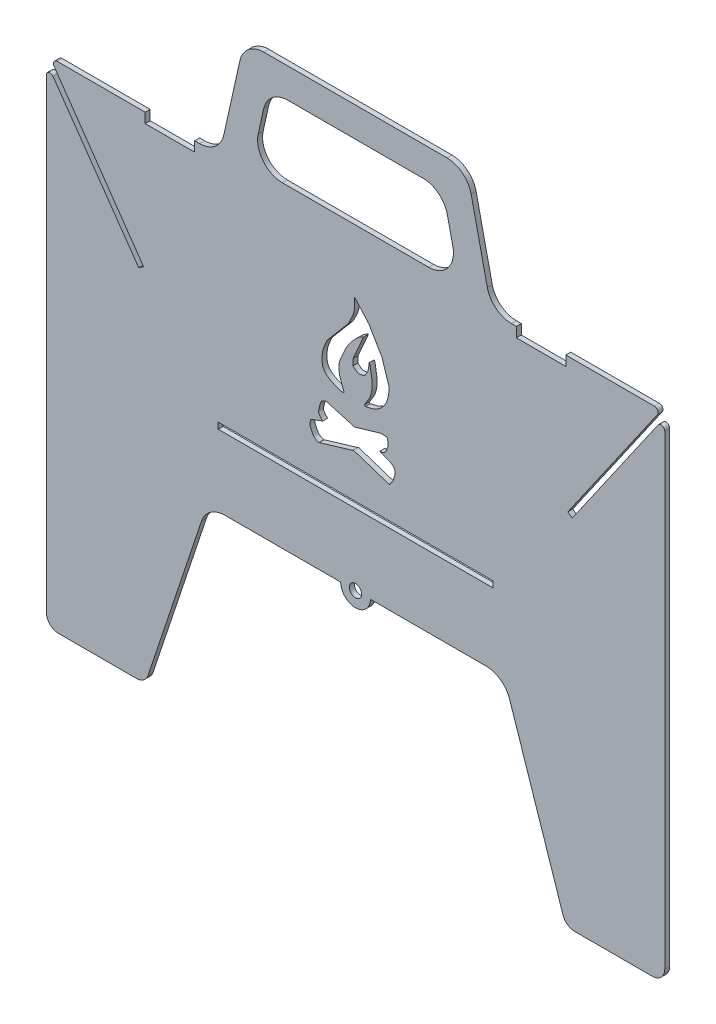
ISO-10303-21;
HEADER;
FILE_DESCRIPTION(('STEP AP214'),'2;1');
FILE_NAME('part.step','',(''),(''),'','','');
FILE_SCHEMA(('AUTOMOTIVE_DESIGN { 1 0 10303 214 1 1 1 1 }'));
ENDSEC;
DATA;
#1=APPLICATION_CONTEXT('core data for automotive mechanical design processes');
#2=APPLICATION_PROTOCOL_DEFINITION('international standard','automotive_design',2000,#1);
#3=PRODUCT_CONTEXT('',#1,'mechanical');
#4=PRODUCT('Part','Part','',(#3));
#5=PRODUCT_RELATED_PRODUCT_CATEGORY('part','',(#4));
#6=PRODUCT_DEFINITION_FORMATION('','',#4);
#7=PRODUCT_DEFINITION_CONTEXT('part definition',#1,'design');
#8=PRODUCT_DEFINITION('design','',#6,#7);
#9=PRODUCT_DEFINITION_SHAPE('','',#8);
#10=(LENGTH_UNIT() NAMED_UNIT(*) SI_UNIT(.MILLI.,.METRE.));
#11=(NAMED_UNIT(*) PLANE_ANGLE_UNIT() SI_UNIT($,.RADIAN.));
#12=(NAMED_UNIT(*) SI_UNIT($,.STERADIAN.) SOLID_ANGLE_UNIT());
#13=UNCERTAINTY_MEASURE_WITH_UNIT(LENGTH_MEASURE(1.E-05),#10,'distance_accuracy_value','');
#14=(GEOMETRIC_REPRESENTATION_CONTEXT(3) GLOBAL_UNCERTAINTY_ASSIGNED_CONTEXT((#13)) GLOBAL_UNIT_ASSIGNED_CONTEXT((#10,
#11,#12)) REPRESENTATION_CONTEXT('',''));
#15=CARTESIAN_POINT('',(0.,0.,0.));
#16=DIRECTION('',(0.,0.,1.));
#17=DIRECTION('',(1.,0.,0.));
#18=AXIS2_PLACEMENT_3D('',#15,#16,#17);
#19=CARTESIAN_POINT('',(65.,75.,-2.));
#20=DIRECTION('',(0.,-1.,0.));
#21=DIRECTION('',(0.,0.,-1.));
#22=AXIS2_PLACEMENT_3D('',#19,#20,#21);
#23=PLANE('',#22);
#24=DIRECTION('',(0.,0.,1.));
#25=VECTOR('',#24,1.);
#26=CARTESIAN_POINT('',(131.,75.,-2.));
#27=LINE('',#26,#25);
#28=CARTESIAN_POINT('',(131.,75.,-2.));
#29=VERTEX_POINT('',#28);
#30=CARTESIAN_POINT('',(131.,75.,0.));
#31=VERTEX_POINT('',#30);
#32=EDGE_CURVE('E539',#29,#31,#27,.T.);
#33=ORIENTED_EDGE('',*,*,#32,.F.);
#34=DIRECTION('',(1.,0.,0.));
#35=VECTOR('',#34,1.);
#36=CARTESIAN_POINT('',(65.,75.,-2.));
#37=LINE('',#36,#35);
#38=CARTESIAN_POINT('',(177.792407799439,75.,-2.));
#39=VERTEX_POINT('',#38);
#40=EDGE_CURVE('E550',#29,#39,#37,.T.);
#41=ORIENTED_EDGE('',*,*,#40,.T.);
#42=DIRECTION('',(0.,0.,1.));
#43=VECTOR('',#42,1.);
#44=CARTESIAN_POINT('',(177.792407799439,75.,0.));
#45=LINE('',#44,#43);
#46=CARTESIAN_POINT('',(177.792407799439,75.,0.));
#47=VERTEX_POINT('',#46);
#48=EDGE_CURVE('E764',#39,#47,#45,.T.);
#49=ORIENTED_EDGE('',*,*,#48,.T.);
#50=DIRECTION('',(1.,0.,0.));
#51=VECTOR('',#50,1.);
#52=CARTESIAN_POINT('',(65.,75.,0.));
#53=LINE('',#52,#51);
#54=EDGE_CURVE('E552',#31,#47,#53,.T.);
#55=ORIENTED_EDGE('',*,*,#54,.F.);
#56=EDGE_LOOP('',(#33,#41,#49,#55));
#57=FACE_BOUND('',#56,.T.);
#58=ADVANCED_FACE('F41',(#57),#23,.T.);
#59=CARTESIAN_POINT('',(1.52184770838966,200.,-2.));
#60=DIRECTION('',(0.,1.,0.));
#61=DIRECTION('',(0.,0.,1.));
#62=AXIS2_PLACEMENT_3D('',#59,#60,#61);
#63=PLANE('',#62);
#64=DIRECTION('',(0.,0.,1.));
#65=VECTOR('',#64,1.);
#66=CARTESIAN_POINT('',(39.9999999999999,200.,-10.));
#67=LINE('',#66,#65);
#68=CARTESIAN_POINT('',(39.9999999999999,200.,-2.));
#69=VERTEX_POINT('',#68);
#70=CARTESIAN_POINT('',(39.9999999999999,200.,0.));
#71=VERTEX_POINT('',#70);
#72=EDGE_CURVE('E1165',#69,#71,#67,.T.);
#73=ORIENTED_EDGE('',*,*,#72,.F.);
#74=DIRECTION('',(-1.,0.,0.));
#75=VECTOR('',#74,1.);
#76=CARTESIAN_POINT('',(1.52184770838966,200.,-2.));
#77=LINE('',#76,#75);
#78=CARTESIAN_POINT('',(4.38973162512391,200.,-2.));
#79=VERTEX_POINT('',#78);
#80=EDGE_CURVE('E584',#69,#79,#77,.T.);
#81=ORIENTED_EDGE('',*,*,#80,.T.);
#82=DIRECTION('',(0.,0.,1.));
#83=VECTOR('',#82,1.);
#84=CARTESIAN_POINT('',(4.38973162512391,200.,-2.));
#85=LINE('',#84,#83);
#86=CARTESIAN_POINT('',(4.38973162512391,200.,0.));
#87=VERTEX_POINT('',#86);
#88=EDGE_CURVE('E661',#79,#87,#85,.T.);
#89=ORIENTED_EDGE('',*,*,#88,.T.);
#90=DIRECTION('',(-1.,0.,0.));
#91=VECTOR('',#90,1.);
#92=CARTESIAN_POINT('',(1.52184770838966,200.,0.));
#93=LINE('',#92,#91);
#94=EDGE_CURVE('E626',#71,#87,#93,.T.);
#95=ORIENTED_EDGE('',*,*,#94,.F.);
#96=EDGE_LOOP('',(#73,#81,#89,#95));
#97=FACE_BOUND('',#96,.T.);
#98=ADVANCED_FACE('F1263',(#97),#63,.T.);
#99=DIRECTION('',(0.,0.,1.));
#100=VECTOR('',#99,1.);
#101=CARTESIAN_POINT('',(210.,200.,-10.));
#102=LINE('',#101,#100);
#103=CARTESIAN_POINT('',(210.,200.,-2.));
#104=VERTEX_POINT('',#103);
#105=CARTESIAN_POINT('',(210.,200.,0.));
#106=VERTEX_POINT('',#105);
#107=EDGE_CURVE('E1159',#104,#106,#102,.T.);
#108=ORIENTED_EDGE('',*,*,#107,.T.);
#109=CARTESIAN_POINT('',(245.792890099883,200.,0.));
#110=VERTEX_POINT('',#109);
#111=EDGE_CURVE('E627',#110,#106,#93,.T.);
#112=ORIENTED_EDGE('',*,*,#111,.F.);
#113=DIRECTION('',(0.,0.,1.));
#114=VECTOR('',#113,1.);
#115=CARTESIAN_POINT('',(245.792890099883,200.,-2.));
#116=LINE('',#115,#114);
#117=CARTESIAN_POINT('',(245.792890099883,200.,-2.));
#118=VERTEX_POINT('',#117);
#119=EDGE_CURVE('E664',#110,#118,#116,.F.);
#120=ORIENTED_EDGE('',*,*,#119,.T.);
#121=EDGE_CURVE('E585',#118,#104,#77,.T.);
#122=ORIENTED_EDGE('',*,*,#121,.T.);
#123=EDGE_LOOP('',(#108,#112,#120,#122));
#124=FACE_BOUND('',#123,.T.);
#125=ADVANCED_FACE('F1268',(#124),#63,.T.);
#126=DIRECTION('',(0.,0.,1.));
#127=VECTOR('',#126,1.);
#128=CARTESIAN_POINT('',(60.,200.,-10.));
#129=LINE('',#128,#127);
#130=CARTESIAN_POINT('',(60.,200.,-2.));
#131=VERTEX_POINT('',#130);
#132=CARTESIAN_POINT('',(60.,200.,0.));
#133=VERTEX_POINT('',#132);
#134=EDGE_CURVE('E1168',#131,#133,#129,.T.);
#135=ORIENTED_EDGE('',*,*,#134,.T.);
#136=CARTESIAN_POINT('',(61.9782839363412,200.,0.));
#137=VERTEX_POINT('',#136);
#138=EDGE_CURVE('E632',#137,#133,#93,.T.);
#139=ORIENTED_EDGE('',*,*,#138,.F.);
#140=DIRECTION('',(0.,0.,1.));
#141=VECTOR('',#140,1.);
#142=CARTESIAN_POINT('',(61.9782839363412,200.,-2.));
#143=LINE('',#142,#141);
#144=CARTESIAN_POINT('',(61.9782839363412,200.,-2.));
#145=VERTEX_POINT('',#144);
#146=EDGE_CURVE('E714',#137,#145,#143,.F.);
#147=ORIENTED_EDGE('',*,*,#146,.T.);
#148=EDGE_CURVE('E590',#145,#131,#77,.T.);
#149=ORIENTED_EDGE('',*,*,#148,.T.);
#150=EDGE_LOOP('',(#135,#139,#147,#149));
#151=FACE_BOUND('',#150,.T.);
#152=ADVANCED_FACE('F1308',(#151),#63,.T.);
#153=CARTESIAN_POINT('',(0.,0.,-2.));
#154=DIRECTION('',(-1.,0.,0.));
#155=DIRECTION('',(0.,0.,1.));
#156=AXIS2_PLACEMENT_3D('',#153,#154,#155);
#157=PLANE('',#156);
#158=DIRECTION('',(0.,-1.,0.));
#159=VECTOR('',#158,1.);
#160=CARTESIAN_POINT('',(0.,0.,-2.));
#161=LINE('',#160,#159);
#162=CARTESIAN_POINT('',(0.,193.037991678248,-2.));
#163=VERTEX_POINT('',#162);
#164=CARTESIAN_POINT('',(0.,5.,-2.));
#165=VERTEX_POINT('',#164);
#166=EDGE_CURVE('E640',#163,#165,#161,.T.);
#167=ORIENTED_EDGE('',*,*,#166,.T.);
#168=DIRECTION('',(0.,0.,1.));
#169=VECTOR('',#168,1.);
#170=CARTESIAN_POINT('',(0.,5.,-2.));
#171=LINE('',#170,#169);
#172=CARTESIAN_POINT('',(0.,5.,0.));
#173=VERTEX_POINT('',#172);
#174=EDGE_CURVE('E759',#165,#173,#171,.T.);
#175=ORIENTED_EDGE('',*,*,#174,.T.);
#176=DIRECTION('',(0.,-1.,0.));
#177=VECTOR('',#176,1.);
#178=CARTESIAN_POINT('',(0.,0.,0.));
#179=LINE('',#178,#177);
#180=CARTESIAN_POINT('',(0.,193.037991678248,0.));
#181=VERTEX_POINT('',#180);
#182=EDGE_CURVE('E599',#181,#173,#179,.T.);
#183=ORIENTED_EDGE('',*,*,#182,.F.);
#184=DIRECTION('',(0.,0.,1.));
#185=VECTOR('',#184,1.);
#186=CARTESIAN_POINT('',(0.,193.037991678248,-2.));
#187=LINE('',#186,#185);
#188=EDGE_CURVE('E684',#181,#163,#187,.F.);
#189=ORIENTED_EDGE('',*,*,#188,.T.);
#190=EDGE_LOOP('',(#167,#175,#183,#189));
#191=FACE_BOUND('',#190,.T.);
#192=ADVANCED_FACE('F1317',(#191),#157,.T.);
#193=CARTESIAN_POINT('',(0.,197.808539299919,-2.));
#194=DIRECTION('',(0.820058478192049,0.572279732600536,0.));
#195=DIRECTION('',(-0.572279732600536,0.820058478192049,0.));
#196=AXIS2_PLACEMENT_3D('',#193,#194,#195);
#197=PLANE('',#196);
#198=DIRECTION('',(-0.572279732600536,0.820058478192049,0.));
#199=VECTOR('',#198,1.);
#200=CARTESIAN_POINT('',(0.,197.808539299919,-2.));
#201=LINE('',#200,#199);
#202=CARTESIAN_POINT('',(37.3963299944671,144.220799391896,-2.));
#203=VERTEX_POINT('',#202);
#204=CARTESIAN_POINT('',(2.73008771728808,193.896411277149,-2.));
#205=VERTEX_POINT('',#204);
#206=EDGE_CURVE('E595',#203,#205,#201,.T.);
#207=ORIENTED_EDGE('',*,*,#206,.T.);
#208=DIRECTION('',(0.,0.,1.));
#209=VECTOR('',#208,1.);
#210=CARTESIAN_POINT('',(2.73008771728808,193.896411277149,-2.));
#211=LINE('',#210,#209);
#212=CARTESIAN_POINT('',(2.73008771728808,193.896411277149,0.));
#213=VERTEX_POINT('',#212);
#214=EDGE_CURVE('E681',#205,#213,#211,.T.);
#215=ORIENTED_EDGE('',*,*,#214,.T.);
#216=DIRECTION('',(-0.572279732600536,0.820058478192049,0.));
#217=VECTOR('',#216,1.);
#218=CARTESIAN_POINT('',(0.,197.808539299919,0.));
#219=LINE('',#218,#217);
#220=CARTESIAN_POINT('',(37.3963299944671,144.220799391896,0.));
#221=VERTEX_POINT('',#220);
#222=EDGE_CURVE('E637',#221,#213,#219,.T.);
#223=ORIENTED_EDGE('',*,*,#222,.F.);
#224=DIRECTION('',(0.,0.,1.));
#225=VECTOR('',#224,1.);
#226=CARTESIAN_POINT('',(37.3963299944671,144.220799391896,-2.));
#227=LINE('',#226,#225);
#228=EDGE_CURVE('E641',#203,#221,#227,.T.);
#229=ORIENTED_EDGE('',*,*,#228,.F.);
#230=EDGE_LOOP('',(#207,#215,#223,#229));
#231=FACE_BOUND('',#230,.T.);
#232=ADVANCED_FACE('F1314',(#231),#197,.T.);
#233=CARTESIAN_POINT('',(39.3265494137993,145.56122954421,-2.));
#234=DIRECTION('',(-0.570395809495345,0.821369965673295,0.));
#235=DIRECTION('',(-0.821369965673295,-0.570395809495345,0.));
#236=AXIS2_PLACEMENT_3D('',#233,#234,#235);
#237=PLANE('',#236);
#238=DIRECTION('',(-0.821369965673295,-0.570395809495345,0.));
#239=VECTOR('',#238,1.);
#240=CARTESIAN_POINT('',(39.3265494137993,145.56122954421,0.));
#241=LINE('',#240,#239);
#242=CARTESIAN_POINT('',(39.3265494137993,145.56122954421,0.));
#243=VERTEX_POINT('',#242);
#244=EDGE_CURVE('E634',#243,#221,#241,.T.);
#245=ORIENTED_EDGE('',*,*,#244,.F.);
#246=DIRECTION('',(0.,0.,1.));
#247=VECTOR('',#246,1.);
#248=CARTESIAN_POINT('',(39.3265494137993,145.56122954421,-2.));
#249=LINE('',#248,#247);
#250=CARTESIAN_POINT('',(39.3265494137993,145.56122954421,-2.));
#251=VERTEX_POINT('',#250);
#252=EDGE_CURVE('E644',#251,#243,#249,.T.);
#253=ORIENTED_EDGE('',*,*,#252,.F.);
#254=DIRECTION('',(-0.821369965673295,-0.570395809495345,0.));
#255=VECTOR('',#254,1.);
#256=CARTESIAN_POINT('',(39.3265494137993,145.56122954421,-2.));
#257=LINE('',#256,#255);
#258=EDGE_CURVE('E592',#251,#203,#257,.T.);
#259=ORIENTED_EDGE('',*,*,#258,.T.);
#260=ORIENTED_EDGE('',*,*,#228,.T.);
#261=EDGE_LOOP('',(#245,#253,#259,#260));
#262=FACE_BOUND('',#261,.T.);
#263=ADVANCED_FACE('F1311',(#262),#237,.T.);
#264=CARTESIAN_POINT('',(39.3265494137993,145.56122954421,-2.));
#265=DIRECTION('',(-0.821369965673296,-0.570395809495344,0.));
#266=DIRECTION('',(0.570395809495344,-0.821369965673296,0.));
#267=AXIS2_PLACEMENT_3D('',#264,#265,#266);
#268=PLANE('',#267);
#269=DIRECTION('',(0.570395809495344,-0.821369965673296,0.));
#270=VECTOR('',#269,1.);
#271=CARTESIAN_POINT('',(39.3265494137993,145.56122954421,0.));
#272=LINE('',#271,#270);
#273=CARTESIAN_POINT('',(3.15767667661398,197.644406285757,0.));
#274=VERTEX_POINT('',#273);
#275=EDGE_CURVE('E630',#274,#243,#272,.T.);
#276=ORIENTED_EDGE('',*,*,#275,.F.);
#277=DIRECTION('',(0.,0.,1.));
#278=VECTOR('',#277,1.);
#279=CARTESIAN_POINT('',(3.15767667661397,197.644406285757,-2.));
#280=LINE('',#279,#278);
#281=CARTESIAN_POINT('',(3.15767667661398,197.644406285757,-2.));
#282=VERTEX_POINT('',#281);
#283=EDGE_CURVE('E686',#274,#282,#280,.F.);
#284=ORIENTED_EDGE('',*,*,#283,.T.);
#285=DIRECTION('',(0.570395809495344,-0.821369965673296,0.));
#286=VECTOR('',#285,1.);
#287=CARTESIAN_POINT('',(39.3265494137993,145.56122954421,-2.));
#288=LINE('',#287,#286);
#289=EDGE_CURVE('E588',#282,#251,#288,.T.);
#290=ORIENTED_EDGE('',*,*,#289,.T.);
#291=ORIENTED_EDGE('',*,*,#252,.T.);
#292=EDGE_LOOP('',(#276,#284,#290,#291));
#293=FACE_BOUND('',#292,.T.);
#294=ADVANCED_FACE('F1306',(#293),#268,.T.);
#295=DIRECTION('',(0.,0.,1.));
#296=VECTOR('',#295,1.);
#297=CARTESIAN_POINT('',(190.,200.,-10.));
#298=LINE('',#297,#296);
#299=CARTESIAN_POINT('',(190.,200.,-2.));
#300=VERTEX_POINT('',#299);
#301=CARTESIAN_POINT('',(190.,200.,0.));
#302=VERTEX_POINT('',#301);
#303=EDGE_CURVE('E1182',#300,#302,#298,.T.);
#304=ORIENTED_EDGE('',*,*,#303,.F.);
#305=CARTESIAN_POINT('',(188.021716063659,200.,-2.));
#306=VERTEX_POINT('',#305);
#307=EDGE_CURVE('E589',#300,#306,#77,.T.);
#308=ORIENTED_EDGE('',*,*,#307,.T.);
#309=DIRECTION('',(0.,0.,1.));
#310=VECTOR('',#309,1.);
#311=CARTESIAN_POINT('',(188.021716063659,200.,0.));
#312=LINE('',#311,#310);
#313=CARTESIAN_POINT('',(188.021716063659,200.,0.));
#314=VERTEX_POINT('',#313);
#315=EDGE_CURVE('E688',#306,#314,#312,.T.);
#316=ORIENTED_EDGE('',*,*,#315,.T.);
#317=EDGE_CURVE('E631',#302,#314,#93,.T.);
#318=ORIENTED_EDGE('',*,*,#317,.F.);
#319=EDGE_LOOP('',(#304,#308,#316,#318));
#320=FACE_BOUND('',#319,.T.);
#321=ADVANCED_FACE('F1271',(#320),#63,.T.);
#322=CARTESIAN_POINT('',(210.796656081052,145.475670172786,-2.));
#323=DIRECTION('',(0.821369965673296,-0.570395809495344,0.));
#324=DIRECTION('',(0.570395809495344,0.821369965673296,0.));
#325=AXIS2_PLACEMENT_3D('',#322,#323,#324);
#326=PLANE('',#325);
#327=DIRECTION('',(0.570395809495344,0.821369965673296,0.));
#328=VECTOR('',#327,1.);
#329=CARTESIAN_POINT('',(210.796656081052,145.475670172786,-2.));
#330=LINE('',#329,#328);
#331=CARTESIAN_POINT('',(210.796656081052,145.475670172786,-2.));
#332=VERTEX_POINT('',#331);
#333=CARTESIAN_POINT('',(247.024945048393,197.644406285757,-2.));
#334=VERTEX_POINT('',#333);
#335=EDGE_CURVE('E581',#332,#334,#330,.T.);
#336=ORIENTED_EDGE('',*,*,#335,.T.);
#337=DIRECTION('',(0.,0.,1.));
#338=VECTOR('',#337,1.);
#339=CARTESIAN_POINT('',(247.024945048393,197.644406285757,-2.));
#340=LINE('',#339,#338);
#341=CARTESIAN_POINT('',(247.024945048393,197.644406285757,0.));
#342=VERTEX_POINT('',#341);
#343=EDGE_CURVE('E643',#334,#342,#340,.T.);
#344=ORIENTED_EDGE('',*,*,#343,.T.);
#345=DIRECTION('',(0.570395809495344,0.821369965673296,0.));
#346=VECTOR('',#345,1.);
#347=CARTESIAN_POINT('',(210.796656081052,145.475670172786,0.));
#348=LINE('',#347,#346);
#349=CARTESIAN_POINT('',(210.796656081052,145.475670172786,0.));
#350=VERTEX_POINT('',#349);
#351=EDGE_CURVE('E623',#350,#342,#348,.T.);
#352=ORIENTED_EDGE('',*,*,#351,.F.);
#353=DIRECTION('',(0.,0.,1.));
#354=VECTOR('',#353,1.);
#355=CARTESIAN_POINT('',(210.796656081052,145.475670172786,-2.));
#356=LINE('',#355,#354);
#357=EDGE_CURVE('E647',#332,#350,#356,.T.);
#358=ORIENTED_EDGE('',*,*,#357,.F.);
#359=EDGE_LOOP('',(#336,#344,#352,#358));
#360=FACE_BOUND('',#359,.T.);
#361=ADVANCED_FACE('F1300',(#360),#326,.T.);
#362=CARTESIAN_POINT('',(210.796656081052,145.475670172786,-2.));
#363=DIRECTION('',(0.570395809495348,0.821369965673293,0.));
#364=DIRECTION('',(-0.821369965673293,0.570395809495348,0.));
#365=AXIS2_PLACEMENT_3D('',#362,#363,#364);
#366=PLANE('',#365);
#367=DIRECTION('',(-0.821369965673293,0.570395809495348,0.));
#368=VECTOR('',#367,1.);
#369=CARTESIAN_POINT('',(210.796656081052,145.475670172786,0.));
#370=LINE('',#369,#368);
#371=CARTESIAN_POINT('',(212.603670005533,144.220799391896,0.));
#372=VERTEX_POINT('',#371);
#373=EDGE_CURVE('E620',#372,#350,#370,.T.);
#374=ORIENTED_EDGE('',*,*,#373,.F.);
#375=DIRECTION('',(0.,0.,1.));
#376=VECTOR('',#375,1.);
#377=CARTESIAN_POINT('',(212.603670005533,144.220799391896,-2.));
#378=LINE('',#377,#376);
#379=CARTESIAN_POINT('',(212.603670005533,144.220799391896,-2.));
#380=VERTEX_POINT('',#379);
#381=EDGE_CURVE('E598',#380,#372,#378,.T.);
#382=ORIENTED_EDGE('',*,*,#381,.F.);
#383=DIRECTION('',(-0.821369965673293,0.570395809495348,0.));
#384=VECTOR('',#383,1.);
#385=CARTESIAN_POINT('',(210.796656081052,145.475670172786,-2.));
#386=LINE('',#385,#384);
#387=EDGE_CURVE('E578',#380,#332,#386,.T.);
#388=ORIENTED_EDGE('',*,*,#387,.T.);
#389=ORIENTED_EDGE('',*,*,#357,.T.);
#390=EDGE_LOOP('',(#374,#382,#388,#389));
#391=FACE_BOUND('',#390,.T.);
#392=ADVANCED_FACE('F1296',(#391),#366,.T.);
#393=CARTESIAN_POINT('',(250.,198.071514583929,-2.));
#394=DIRECTION('',(-0.821369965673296,0.570395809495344,0.));
#395=DIRECTION('',(-0.570395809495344,-0.821369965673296,0.));
#396=AXIS2_PLACEMENT_3D('',#393,#394,#395);
#397=PLANE('',#396);
#398=DIRECTION('',(-0.570395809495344,-0.821369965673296,0.));
#399=VECTOR('',#398,1.);
#400=CARTESIAN_POINT('',(250.,198.071514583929,0.));
#401=LINE('',#400,#399);
#402=CARTESIAN_POINT('',(247.26794505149,194.137355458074,0.));
#403=VERTEX_POINT('',#402);
#404=EDGE_CURVE('E618',#403,#372,#401,.T.);
#405=ORIENTED_EDGE('',*,*,#404,.F.);
#406=DIRECTION('',(0.,0.,1.));
#407=VECTOR('',#406,1.);
#408=CARTESIAN_POINT('',(247.26794505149,194.137355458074,-2.));
#409=LINE('',#408,#407);
#410=CARTESIAN_POINT('',(247.26794505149,194.137355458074,-2.));
#411=VERTEX_POINT('',#410);
#412=EDGE_CURVE('E679',#403,#411,#409,.F.);
#413=ORIENTED_EDGE('',*,*,#412,.T.);
#414=DIRECTION('',(-0.570395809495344,-0.821369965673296,0.));
#415=VECTOR('',#414,1.);
#416=CARTESIAN_POINT('',(250.,198.071514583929,-2.));
#417=LINE('',#416,#415);
#418=EDGE_CURVE('E576',#411,#380,#417,.T.);
#419=ORIENTED_EDGE('',*,*,#418,.T.);
#420=ORIENTED_EDGE('',*,*,#381,.T.);
#421=EDGE_LOOP('',(#405,#413,#419,#420));
#422=FACE_BOUND('',#421,.T.);
#423=ADVANCED_FACE('F1292',(#422),#397,.T.);
#424=CARTESIAN_POINT('',(250.,198.071514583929,-2.));
#425=DIRECTION('',(1.,0.,0.));
#426=DIRECTION('',(0.,0.,-1.));
#427=AXIS2_PLACEMENT_3D('',#424,#425,#426);
#428=PLANE('',#427);
#429=DIRECTION('',(0.,1.,0.));
#430=VECTOR('',#429,1.);
#431=CARTESIAN_POINT('',(250.,198.071514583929,0.));
#432=LINE('',#431,#430);
#433=CARTESIAN_POINT('',(250.,5.,0.));
#434=VERTEX_POINT('',#433);
#435=CARTESIAN_POINT('',(250.,193.281761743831,0.));
#436=VERTEX_POINT('',#435);
#437=EDGE_CURVE('E616',#434,#436,#432,.T.);
#438=ORIENTED_EDGE('',*,*,#437,.F.);
#439=DIRECTION('',(0.,0.,1.));
#440=VECTOR('',#439,1.);
#441=CARTESIAN_POINT('',(250.,5.,-2.));
#442=LINE('',#441,#440);
#443=CARTESIAN_POINT('',(250.,5.,-2.));
#444=VERTEX_POINT('',#443);
#445=EDGE_CURVE('E750',#434,#444,#442,.F.);
#446=ORIENTED_EDGE('',*,*,#445,.T.);
#447=DIRECTION('',(0.,1.,0.));
#448=VECTOR('',#447,1.);
#449=CARTESIAN_POINT('',(250.,198.071514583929,-2.));
#450=LINE('',#449,#448);
#451=CARTESIAN_POINT('',(250.,193.281761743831,-2.));
#452=VERTEX_POINT('',#451);
#453=EDGE_CURVE('E574',#444,#452,#450,.T.);
#454=ORIENTED_EDGE('',*,*,#453,.T.);
#455=DIRECTION('',(0.,0.,1.));
#456=VECTOR('',#455,1.);
#457=CARTESIAN_POINT('',(250.,193.281761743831,-2.));
#458=LINE('',#457,#456);
#459=EDGE_CURVE('E676',#452,#436,#458,.T.);
#460=ORIENTED_EDGE('',*,*,#459,.T.);
#461=EDGE_LOOP('',(#438,#446,#454,#460));
#462=FACE_BOUND('',#461,.T.);
#463=ADVANCED_FACE('F1285',(#462),#428,.T.);
#464=CARTESIAN_POINT('',(210.,0.,-2.));
#465=DIRECTION('',(0.,-1.,0.));
#466=DIRECTION('',(0.,0.,-1.));
#467=AXIS2_PLACEMENT_3D('',#464,#465,#466);
#468=PLANE('',#467);
#469=DIRECTION('',(1.,0.,0.));
#470=VECTOR('',#469,1.);
#471=CARTESIAN_POINT('',(210.,0.,0.));
#472=LINE('',#471,#470);
#473=CARTESIAN_POINT('',(213.603796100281,0.,0.));
#474=VERTEX_POINT('',#473);
#475=CARTESIAN_POINT('',(245.,0.,0.));
#476=VERTEX_POINT('',#475);
#477=EDGE_CURVE('E613',#474,#476,#472,.T.);
#478=ORIENTED_EDGE('',*,*,#477,.F.);
#479=DIRECTION('',(0.,0.,1.));
#480=VECTOR('',#479,1.);
#481=CARTESIAN_POINT('',(213.603796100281,0.,-2.));
#482=LINE('',#481,#480);
#483=CARTESIAN_POINT('',(213.603796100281,0.,-2.));
#484=VERTEX_POINT('',#483);
#485=EDGE_CURVE('E739',#474,#484,#482,.F.);
#486=ORIENTED_EDGE('',*,*,#485,.T.);
#487=DIRECTION('',(1.,0.,0.));
#488=VECTOR('',#487,1.);
#489=CARTESIAN_POINT('',(210.,0.,-2.));
#490=LINE('',#489,#488);
#491=CARTESIAN_POINT('',(245.,0.,-2.));
#492=VERTEX_POINT('',#491);
#493=EDGE_CURVE('E571',#484,#492,#490,.T.);
#494=ORIENTED_EDGE('',*,*,#493,.T.);
#495=DIRECTION('',(0.,0.,1.));
#496=VECTOR('',#495,1.);
#497=CARTESIAN_POINT('',(245.,0.,-2.));
#498=LINE('',#497,#496);
#499=EDGE_CURVE('E736',#492,#476,#498,.T.);
#500=ORIENTED_EDGE('',*,*,#499,.T.);
#501=EDGE_LOOP('',(#478,#486,#494,#500));
#502=FACE_BOUND('',#501,.T.);
#503=ADVANCED_FACE('F1280',(#502),#468,.T.);
#504=CARTESIAN_POINT('',(210.,0.,-2.));
#505=DIRECTION('',(-0.948683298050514,-0.316227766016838,0.));
#506=DIRECTION('',(0.316227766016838,-0.948683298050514,0.));
#507=AXIS2_PLACEMENT_3D('',#504,#505,#506);
#508=PLANE('',#507);
#509=DIRECTION('',(0.316227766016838,-0.948683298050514,0.));
#510=VECTOR('',#509,1.);
#511=CARTESIAN_POINT('',(210.,0.,0.));
#512=LINE('',#511,#510);
#513=CARTESIAN_POINT('',(187.279240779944,68.1622776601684,0.));
#514=VERTEX_POINT('',#513);
#515=CARTESIAN_POINT('',(208.860379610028,3.4188611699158,0.));
#516=VERTEX_POINT('',#515);
#517=EDGE_CURVE('E611',#514,#516,#512,.T.);
#518=ORIENTED_EDGE('',*,*,#517,.F.);
#519=DIRECTION('',(0.,0.,1.));
#520=VECTOR('',#519,1.);
#521=CARTESIAN_POINT('',(187.279240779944,68.1622776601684,-2.));
#522=LINE('',#521,#520);
#523=CARTESIAN_POINT('',(187.279240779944,68.1622776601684,-2.));
#524=VERTEX_POINT('',#523);
#525=EDGE_CURVE('E766',#514,#524,#522,.F.);
#526=ORIENTED_EDGE('',*,*,#525,.T.);
#527=DIRECTION('',(0.316227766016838,-0.948683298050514,0.));
#528=VECTOR('',#527,1.);
#529=CARTESIAN_POINT('',(210.,0.,-2.));
#530=LINE('',#529,#528);
#531=CARTESIAN_POINT('',(208.860379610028,3.4188611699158,-2.));
#532=VERTEX_POINT('',#531);
#533=EDGE_CURVE('E564',#524,#532,#530,.T.);
#534=ORIENTED_EDGE('',*,*,#533,.T.);
#535=DIRECTION('',(0.,0.,1.));
#536=VECTOR('',#535,1.);
#537=CARTESIAN_POINT('',(208.860379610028,3.41886116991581,-2.));
#538=LINE('',#537,#536);
#539=EDGE_CURVE('E725',#532,#516,#538,.T.);
#540=ORIENTED_EDGE('',*,*,#539,.T.);
#541=EDGE_LOOP('',(#518,#526,#534,#540));
#542=FACE_BOUND('',#541,.T.);
#543=ADVANCED_FACE('F1275',(#542),#508,.T.);
#544=DIRECTION('',(0.,0.,1.));
#545=VECTOR('',#544,1.);
#546=CARTESIAN_POINT('',(119.,75.,-2.));
#547=LINE('',#546,#545);
#548=CARTESIAN_POINT('',(119.,75.,0.));
#549=VERTEX_POINT('',#548);
#550=CARTESIAN_POINT('',(119.,75.,-2.));
#551=VERTEX_POINT('',#550);
#552=EDGE_CURVE('E542',#549,#551,#547,.F.);
#553=ORIENTED_EDGE('',*,*,#552,.F.);
#554=CARTESIAN_POINT('',(72.2075922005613,75.,0.));
#555=VERTEX_POINT('',#554);
#556=EDGE_CURVE('E609',#555,#549,#53,.T.);
#557=ORIENTED_EDGE('',*,*,#556,.F.);
#558=DIRECTION('',(0.,0.,1.));
#559=VECTOR('',#558,1.);
#560=CARTESIAN_POINT('',(72.2075922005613,75.,-2.));
#561=LINE('',#560,#559);
#562=CARTESIAN_POINT('',(72.2075922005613,75.,-2.));
#563=VERTEX_POINT('',#562);
#564=EDGE_CURVE('E762',#555,#563,#561,.F.);
#565=ORIENTED_EDGE('',*,*,#564,.T.);
#566=EDGE_CURVE('E561',#563,#551,#37,.T.);
#567=ORIENTED_EDGE('',*,*,#566,.T.);
#568=EDGE_LOOP('',(#553,#557,#565,#567));
#569=FACE_BOUND('',#568,.T.);
#570=ADVANCED_FACE('F895',(#569),#23,.T.);
#571=CARTESIAN_POINT('',(40.,0.,-2.));
#572=DIRECTION('',(0.948683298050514,-0.316227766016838,0.));
#573=DIRECTION('',(0.316227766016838,0.948683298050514,0.));
#574=AXIS2_PLACEMENT_3D('',#571,#572,#573);
#575=PLANE('',#574);
#576=DIRECTION('',(0.316227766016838,0.948683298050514,0.));
#577=VECTOR('',#576,1.);
#578=CARTESIAN_POINT('',(40.,0.,-2.));
#579=LINE('',#578,#577);
#580=CARTESIAN_POINT('',(41.1396203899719,3.41886116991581,-2.));
#581=VERTEX_POINT('',#580);
#582=CARTESIAN_POINT('',(62.7207592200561,68.1622776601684,-2.));
#583=VERTEX_POINT('',#582);
#584=EDGE_CURVE('E562',#581,#583,#579,.T.);
#585=ORIENTED_EDGE('',*,*,#584,.T.);
#586=DIRECTION('',(0.,0.,1.));
#587=VECTOR('',#586,1.);
#588=CARTESIAN_POINT('',(62.7207592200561,68.1622776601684,0.));
#589=LINE('',#588,#587);
#590=CARTESIAN_POINT('',(62.7207592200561,68.1622776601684,0.));
#591=VERTEX_POINT('',#590);
#592=EDGE_CURVE('E768',#583,#591,#589,.T.);
#593=ORIENTED_EDGE('',*,*,#592,.T.);
#594=DIRECTION('',(0.316227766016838,0.948683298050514,0.));
#595=VECTOR('',#594,1.);
#596=CARTESIAN_POINT('',(40.,0.,0.));
#597=LINE('',#596,#595);
#598=CARTESIAN_POINT('',(41.1396203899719,3.41886116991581,0.));
#599=VERTEX_POINT('',#598);
#600=EDGE_CURVE('E606',#599,#591,#597,.T.);
#601=ORIENTED_EDGE('',*,*,#600,.F.);
#602=DIRECTION('',(0.,0.,1.));
#603=VECTOR('',#602,1.);
#604=CARTESIAN_POINT('',(41.1396203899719,3.41886116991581,-2.));
#605=LINE('',#604,#603);
#606=EDGE_CURVE('E757',#599,#581,#605,.F.);
#607=ORIENTED_EDGE('',*,*,#606,.T.);
#608=EDGE_LOOP('',(#585,#593,#601,#607));
#609=FACE_BOUND('',#608,.T.);
#610=ADVANCED_FACE('F886',(#609),#575,.T.);
#611=CARTESIAN_POINT('',(0.,0.,-2.));
#612=DIRECTION('',(0.,-1.,0.));
#613=DIRECTION('',(0.,0.,-1.));
#614=AXIS2_PLACEMENT_3D('',#611,#612,#613);
#615=PLANE('',#614);
#616=DIRECTION('',(1.,0.,0.));
#617=VECTOR('',#616,1.);
#618=CARTESIAN_POINT('',(0.,0.,-2.));
#619=LINE('',#618,#617);
#620=CARTESIAN_POINT('',(5.,0.,-2.));
#621=VERTEX_POINT('',#620);
#622=CARTESIAN_POINT('',(36.3962038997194,0.,-2.));
#623=VERTEX_POINT('',#622);
#624=EDGE_CURVE('E566',#621,#623,#619,.T.);
#625=ORIENTED_EDGE('',*,*,#624,.T.);
#626=DIRECTION('',(0.,0.,1.));
#627=VECTOR('',#626,1.);
#628=CARTESIAN_POINT('',(36.3962038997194,0.,-2.));
#629=LINE('',#628,#627);
#630=CARTESIAN_POINT('',(36.3962038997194,0.,0.));
#631=VERTEX_POINT('',#630);
#632=EDGE_CURVE('E754',#623,#631,#629,.T.);
#633=ORIENTED_EDGE('',*,*,#632,.T.);
#634=DIRECTION('',(1.,0.,0.));
#635=VECTOR('',#634,1.);
#636=CARTESIAN_POINT('',(0.,0.,0.));
#637=LINE('',#636,#635);
#638=CARTESIAN_POINT('',(5.,0.,0.));
#639=VERTEX_POINT('',#638);
#640=EDGE_CURVE('E602',#639,#631,#637,.T.);
#641=ORIENTED_EDGE('',*,*,#640,.F.);
#642=DIRECTION('',(0.,0.,1.));
#643=VECTOR('',#642,1.);
#644=CARTESIAN_POINT('',(5.,0.,-2.));
#645=LINE('',#644,#643);
#646=EDGE_CURVE('E752',#639,#621,#645,.F.);
#647=ORIENTED_EDGE('',*,*,#646,.T.);
#648=EDGE_LOOP('',(#625,#633,#641,#647));
#649=FACE_BOUND('',#648,.T.);
#650=ADVANCED_FACE('F876',(#649),#615,.T.);
#651=CARTESIAN_POINT('',(0.,0.,-2.));
#652=DIRECTION('',(0.,0.,-1.));
#653=DIRECTION('',(-1.,0.,0.));
#654=AXIS2_PLACEMENT_3D('',#651,#652,#653);
#655=PLANE('',#654);
#656=CARTESIAN_POINT('',(125.,75.,-2.));
#657=DIRECTION('',(0.,0.,-1.));
#658=DIRECTION('',(-1.,0.,0.));
#659=AXIS2_PLACEMENT_3D('',#656,#657,#658);
#660=CIRCLE('',#659,2.5);
#661=CARTESIAN_POINT('',(122.5,75.,-2.));
#662=VERTEX_POINT('',#661);
#663=EDGE_CURVE('E2672',#662,#662,#660,.T.);
#664=ORIENTED_EDGE('',*,*,#663,.F.);
#665=EDGE_LOOP('',(#664));
#666=FACE_BOUND('',#665,.T.);
#667=ORIENTED_EDGE('',*,*,#40,.F.);
#668=CARTESIAN_POINT('',(125.,75.,-2.));
#669=DIRECTION('',(0.,0.,1.));
#670=DIRECTION('',(1.,0.,0.));
#671=AXIS2_PLACEMENT_3D('',#668,#669,#670);
#672=CIRCLE('',#671,6.00000000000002);
#673=EDGE_CURVE('E536',#551,#29,#672,.T.);
#674=ORIENTED_EDGE('',*,*,#673,.F.);
#675=ORIENTED_EDGE('',*,*,#566,.F.);
#676=CARTESIAN_POINT('',(72.2075922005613,65.,-2.));
#677=DIRECTION('',(0.,0.,-1.));
#678=DIRECTION('',(-1.,0.,0.));
#679=AXIS2_PLACEMENT_3D('',#676,#677,#678);
#680=CIRCLE('',#679,10.);
#681=EDGE_CURVE('E776',#563,#583,#680,.F.);
#682=ORIENTED_EDGE('',*,*,#681,.T.);
#683=ORIENTED_EDGE('',*,*,#584,.F.);
#684=CARTESIAN_POINT('',(36.3962038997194,5.,-2.));
#685=DIRECTION('',(0.,0.,-1.));
#686=DIRECTION('',(-1.,0.,0.));
#687=AXIS2_PLACEMENT_3D('',#684,#685,#686);
#688=CIRCLE('',#687,5.);
#689=EDGE_CURVE('E743',#581,#623,#688,.T.);
#690=ORIENTED_EDGE('',*,*,#689,.T.);
#691=ORIENTED_EDGE('',*,*,#624,.F.);
#692=CARTESIAN_POINT('',(5.,5.,-2.));
#693=DIRECTION('',(0.,0.,-1.));
#694=DIRECTION('',(-1.,0.,0.));
#695=AXIS2_PLACEMENT_3D('',#692,#693,#694);
#696=CIRCLE('',#695,5.);
#697=EDGE_CURVE('E741',#621,#165,#696,.T.);
#698=ORIENTED_EDGE('',*,*,#697,.T.);
#699=ORIENTED_EDGE('',*,*,#166,.F.);
#700=CARTESIAN_POINT('',(1.5,193.037991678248,-2.));
#701=DIRECTION('',(0.,0.,-1.));
#702=DIRECTION('',(-1.,0.,0.));
#703=AXIS2_PLACEMENT_3D('',#700,#701,#702);
#704=CIRCLE('',#703,1.5);
#705=EDGE_CURVE('E669',#163,#205,#704,.T.);
#706=ORIENTED_EDGE('',*,*,#705,.T.);
#707=ORIENTED_EDGE('',*,*,#206,.F.);
#708=ORIENTED_EDGE('',*,*,#258,.F.);
#709=ORIENTED_EDGE('',*,*,#289,.F.);
#710=CARTESIAN_POINT('',(4.38973162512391,198.5,-2.));
#711=DIRECTION('',(0.,0.,-1.));
#712=DIRECTION('',(-1.,0.,0.));
#713=AXIS2_PLACEMENT_3D('',#710,#711,#712);
#714=CIRCLE('',#713,1.5);
#715=EDGE_CURVE('E666',#282,#79,#714,.T.);
#716=ORIENTED_EDGE('',*,*,#715,.T.);
#717=ORIENTED_EDGE('',*,*,#80,.F.);
#718=DIRECTION('',(0.,1.,0.));
#719=VECTOR('',#718,1.);
#720=CARTESIAN_POINT('',(39.9999999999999,0.,-2.));
#721=LINE('',#720,#719);
#722=CARTESIAN_POINT('',(39.9999999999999,196.,-2.));
#723=VERTEX_POINT('',#722);
#724=EDGE_CURVE('E1199',#723,#69,#721,.T.);
#725=ORIENTED_EDGE('',*,*,#724,.F.);
#726=DIRECTION('',(-1.,0.,0.));
#727=VECTOR('',#726,1.);
#728=CARTESIAN_POINT('',(0.,196.,-2.));
#729=LINE('',#728,#727);
#730=CARTESIAN_POINT('',(59.9999999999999,196.,-2.));
#731=VERTEX_POINT('',#730);
#732=EDGE_CURVE('E1195',#731,#723,#729,.T.);
#733=ORIENTED_EDGE('',*,*,#732,.F.);
#734=DIRECTION('',(0.,-1.,0.));
#735=VECTOR('',#734,1.);
#736=CARTESIAN_POINT('',(59.9999999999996,-1.04083408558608E-13,-2.));
#737=LINE('',#736,#735);
#738=EDGE_CURVE('E1197',#131,#731,#737,.T.);
#739=ORIENTED_EDGE('',*,*,#738,.F.);
#740=ORIENTED_EDGE('',*,*,#148,.F.);
#741=CARTESIAN_POINT('',(61.9782839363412,210.,-2.));
#742=DIRECTION('',(0.,0.,-1.));
#743=DIRECTION('',(-1.,0.,0.));
#744=AXIS2_PLACEMENT_3D('',#741,#742,#743);
#745=CIRCLE('',#744,10.);
#746=CARTESIAN_POINT('',(71.7401545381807,207.830695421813,-2.));
#747=VERTEX_POINT('',#746);
#748=EDGE_CURVE('E723',#145,#747,#745,.F.);
#749=ORIENTED_EDGE('',*,*,#748,.T.);
#750=DIRECTION('',(-0.216930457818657,-0.976187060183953,0.));
#751=VECTOR('',#750,1.);
#752=CARTESIAN_POINT('',(70.,200.,-2.));
#753=LINE('',#752,#751);
#754=CARTESIAN_POINT('',(78.2598454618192,237.169304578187,-2.));
#755=VERTEX_POINT('',#754);
#756=EDGE_CURVE('E603',#755,#747,#753,.T.);
#757=ORIENTED_EDGE('',*,*,#756,.F.);
#758=CARTESIAN_POINT('',(88.0217160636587,235.,-2.));
#759=DIRECTION('',(0.,0.,-1.));
#760=DIRECTION('',(-1.,0.,0.));
#761=AXIS2_PLACEMENT_3D('',#758,#759,#760);
#762=CIRCLE('',#761,10.);
#763=CARTESIAN_POINT('',(88.0217160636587,245.,-2.));
#764=VERTEX_POINT('',#763);
#765=EDGE_CURVE('E705',#755,#764,#762,.T.);
#766=ORIENTED_EDGE('',*,*,#765,.T.);
#767=DIRECTION('',(-1.,0.,0.));
#768=VECTOR('',#767,1.);
#769=CARTESIAN_POINT('',(80.,245.,-2.));
#770=LINE('',#769,#768);
#771=CARTESIAN_POINT('',(161.978283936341,245.,-2.));
#772=VERTEX_POINT('',#771);
#773=EDGE_CURVE('E858',#772,#764,#770,.T.);
#774=ORIENTED_EDGE('',*,*,#773,.F.);
#775=CARTESIAN_POINT('',(161.978283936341,235.,-2.));
#776=DIRECTION('',(0.,0.,-1.));
#777=DIRECTION('',(-1.,0.,0.));
#778=AXIS2_PLACEMENT_3D('',#775,#776,#777);
#779=CIRCLE('',#778,10.);
#780=CARTESIAN_POINT('',(171.740154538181,237.169304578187,-2.));
#781=VERTEX_POINT('',#780);
#782=EDGE_CURVE('E707',#772,#781,#779,.T.);
#783=ORIENTED_EDGE('',*,*,#782,.T.);
#784=DIRECTION('',(-0.216930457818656,0.976187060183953,0.));
#785=VECTOR('',#784,1.);
#786=CARTESIAN_POINT('',(180.,200.,-2.));
#787=LINE('',#786,#785);
#788=CARTESIAN_POINT('',(178.259845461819,207.830695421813,-2.));
#789=VERTEX_POINT('',#788);
#790=EDGE_CURVE('E855',#789,#781,#787,.T.);
#791=ORIENTED_EDGE('',*,*,#790,.F.);
#792=CARTESIAN_POINT('',(188.021716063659,210.,-2.));
#793=DIRECTION('',(0.,0.,-1.));
#794=DIRECTION('',(-1.,0.,0.));
#795=AXIS2_PLACEMENT_3D('',#792,#793,#794);
#796=CIRCLE('',#795,10.);
#797=EDGE_CURVE('E718',#789,#306,#796,.F.);
#798=ORIENTED_EDGE('',*,*,#797,.T.);
#799=ORIENTED_EDGE('',*,*,#307,.F.);
#800=DIRECTION('',(0.,1.,0.));
#801=VECTOR('',#800,1.);
#802=CARTESIAN_POINT('',(190.000000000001,1.31838984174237E-12,-2.));
#803=LINE('',#802,#801);
#804=CARTESIAN_POINT('',(190.,196.,-2.));
#805=VERTEX_POINT('',#804);
#806=EDGE_CURVE('E1167',#805,#300,#803,.T.);
#807=ORIENTED_EDGE('',*,*,#806,.F.);
#808=DIRECTION('',(-1.,0.,0.));
#809=VECTOR('',#808,1.);
#810=CARTESIAN_POINT('',(0.,196.,-2.));
#811=LINE('',#810,#809);
#812=CARTESIAN_POINT('',(210.,196.,-2.));
#813=VERTEX_POINT('',#812);
#814=EDGE_CURVE('E1191',#813,#805,#811,.T.);
#815=ORIENTED_EDGE('',*,*,#814,.F.);
#816=DIRECTION('',(0.,-1.,0.));
#817=VECTOR('',#816,1.);
#818=CARTESIAN_POINT('',(210.000000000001,1.45716771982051E-12,-2.));
#819=LINE('',#818,#817);
#820=EDGE_CURVE('E1193',#104,#813,#819,.T.);
#821=ORIENTED_EDGE('',*,*,#820,.F.);
#822=ORIENTED_EDGE('',*,*,#121,.F.);
#823=CARTESIAN_POINT('',(245.792890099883,198.5,-2.));
#824=DIRECTION('',(0.,0.,-1.));
#825=DIRECTION('',(-1.,0.,0.));
#826=AXIS2_PLACEMENT_3D('',#823,#824,#825);
#827=CIRCLE('',#826,1.5);
#828=EDGE_CURVE('E674',#118,#334,#827,.T.);
#829=ORIENTED_EDGE('',*,*,#828,.T.);
#830=ORIENTED_EDGE('',*,*,#335,.F.);
#831=ORIENTED_EDGE('',*,*,#387,.F.);
#832=ORIENTED_EDGE('',*,*,#418,.F.);
#833=CARTESIAN_POINT('',(248.5,193.281761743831,-2.));
#834=DIRECTION('',(0.,0.,-1.));
#835=DIRECTION('',(-1.,0.,0.));
#836=AXIS2_PLACEMENT_3D('',#833,#834,#835);
#837=CIRCLE('',#836,1.5);
#838=EDGE_CURVE('E671',#411,#452,#837,.T.);
#839=ORIENTED_EDGE('',*,*,#838,.T.);
#840=ORIENTED_EDGE('',*,*,#453,.F.);
#841=CARTESIAN_POINT('',(245.,5.,-2.));
#842=DIRECTION('',(0.,0.,-1.));
#843=DIRECTION('',(-1.,0.,0.));
#844=AXIS2_PLACEMENT_3D('',#841,#842,#843);
#845=CIRCLE('',#844,5.);
#846=EDGE_CURVE('E745',#444,#492,#845,.T.);
#847=ORIENTED_EDGE('',*,*,#846,.T.);
#848=ORIENTED_EDGE('',*,*,#493,.F.);
#849=CARTESIAN_POINT('',(213.603796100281,5.,-2.));
#850=DIRECTION('',(0.,0.,-1.));
#851=DIRECTION('',(-1.,0.,0.));
#852=AXIS2_PLACEMENT_3D('',#849,#850,#851);
#853=CIRCLE('',#852,5.);
#854=EDGE_CURVE('E747',#484,#532,#853,.T.);
#855=ORIENTED_EDGE('',*,*,#854,.T.);
#856=ORIENTED_EDGE('',*,*,#533,.F.);
#857=CARTESIAN_POINT('',(177.792407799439,65.,-2.));
#858=DIRECTION('',(0.,0.,-1.));
#859=DIRECTION('',(-1.,0.,0.));
#860=AXIS2_PLACEMENT_3D('',#857,#858,#859);
#861=CIRCLE('',#860,10.);
#862=EDGE_CURVE('E559',#524,#39,#861,.F.);
#863=ORIENTED_EDGE('',*,*,#862,.T.);
#864=EDGE_LOOP('',(#667,#674,#675,#682,#683,#690,#691,#698,#699,#706,#707,#708,#709,#716,#717,
#725,#733,#739,#740,#749,#757,#766,#774,#783,#791,#798,#799,#807,#815,#821,#822,#829,#830,#831,
#832,#839,#840,#847,#848,#855,#856,#863));
#865=FACE_BOUND('',#864,.T.);
#866=CARTESIAN_POINT('',(124.548612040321,177.653712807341,-2.));
#867=CARTESIAN_POINT('',(124.492579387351,175.872585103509,-2.));
#868=CARTESIAN_POINT('',(124.78277632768,174.046342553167,-2.));
#869=CARTESIAN_POINT('',(124.380514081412,172.310329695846,-2.));
#870=CARTESIAN_POINT('',(123.949313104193,170.449428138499,-2.));
#871=CARTESIAN_POINT('',(122.855484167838,168.807496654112,-2.));
#872=CARTESIAN_POINT('',(122.092969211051,167.056080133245,-2.));
#873=B_SPLINE_CURVE_WITH_KNOTS('',3,(#866,#867,#868,#869,#870,#871,#872),.UNSPECIFIED.,.F.,.F.,
(4,3,4),(0.,1.,2.),.UNSPECIFIED.);
#874=CARTESIAN_POINT('',(122.092969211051,167.056080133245,-2.));
#875=VERTEX_POINT('',#874);
#876=CARTESIAN_POINT('',(124.548612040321,177.653712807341,-2.));
#877=VERTEX_POINT('',#876);
#878=EDGE_CURVE('E1148',#875,#877,#873,.F.);
#879=ORIENTED_EDGE('',*,*,#878,.F.);
#880=DIRECTION('',(0.645180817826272,0.764029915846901,0.));
#881=VECTOR('',#880,1.);
#882=CARTESIAN_POINT('',(-11.0774385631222,9.35428145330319,-2.));
#883=LINE('',#882,#881);
#884=CARTESIAN_POINT('',(113.448612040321,156.819341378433,-2.));
#885=VERTEX_POINT('',#884);
#886=EDGE_CURVE('E1090',#885,#875,#883,.T.);
#887=ORIENTED_EDGE('',*,*,#886,.F.);
#888=CARTESIAN_POINT('',(113.448612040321,156.819341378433,-2.));
#889=CARTESIAN_POINT('',(112.881945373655,155.319341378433,-2.));
#890=CARTESIAN_POINT('',(112.047116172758,153.894779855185,-2.));
#891=CARTESIAN_POINT('',(111.748612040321,152.319341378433,-2.));
#892=CARTESIAN_POINT('',(111.438280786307,150.681481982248,-2.));
#893=CARTESIAN_POINT('',(111.273771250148,148.943651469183,-2.));
#894=CARTESIAN_POINT('',(111.648612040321,147.319341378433,-2.));
#895=CARTESIAN_POINT('',(111.902237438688,146.220297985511,-2.));
#896=CARTESIAN_POINT('',(112.649361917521,145.200202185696,-2.));
#897=CARTESIAN_POINT('',(113.548612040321,144.519341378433,-2.));
#898=CARTESIAN_POINT('',(115.058031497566,143.376495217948,-2.));
#899=CARTESIAN_POINT('',(116.876952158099,142.686923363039,-2.));
#900=CARTESIAN_POINT('',(118.648612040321,142.019341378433,-2.));
#901=CARTESIAN_POINT('',(119.21094022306,141.80744959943,-2.));
#902=CARTESIAN_POINT('',(119.848612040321,141.952674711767,-2.));
#903=CARTESIAN_POINT('',(120.448612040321,141.919341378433,-2.));
#904=B_SPLINE_CURVE_WITH_KNOTS('',3,(#888,#889,#890,#891,#892,#893,#894,#895,#896,#897,#898,
#899,#900,#901,#902,#903),.UNSPECIFIED.,.F.,.F.,(4,3,3,3,3,4),(0.,1.,2.,3.,4.,5.),.UNSPECIFIED.);
#905=CARTESIAN_POINT('',(120.448612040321,141.919341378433,-2.));
#906=VERTEX_POINT('',#905);
#907=EDGE_CURVE('E1095',#906,#885,#904,.F.);
#908=ORIENTED_EDGE('',*,*,#907,.F.);
#909=CARTESIAN_POINT('',(120.448612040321,141.919341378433,-2.));
#910=CARTESIAN_POINT('',(120.215278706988,142.5860080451,-2.));
#911=CARTESIAN_POINT('',(119.975368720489,143.250409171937,-2.));
#912=CARTESIAN_POINT('',(119.748612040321,143.919341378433,-2.));
#913=CARTESIAN_POINT('',(119.308685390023,145.217124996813,-2.));
#914=CARTESIAN_POINT('',(118.606885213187,146.45819209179,-2.));
#915=CARTESIAN_POINT('',(118.448612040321,147.819341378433,-2.));
#916=CARTESIAN_POINT('',(118.255495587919,149.48014286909,-2.));
#917=CARTESIAN_POINT('',(118.145163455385,151.302530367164,-2.));
#918=CARTESIAN_POINT('',(118.848612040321,152.819341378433,-2.));
#919=CARTESIAN_POINT('',(119.87122283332,155.024345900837,-2.));
#920=CARTESIAN_POINT('',(120.64251316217,157.369491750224,-2.));
#921=CARTESIAN_POINT('',(121.948612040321,159.419341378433,-2.));
#922=CARTESIAN_POINT('',(123.065777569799,161.172670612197,-2.));
#923=CARTESIAN_POINT('',(124.543132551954,162.685551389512,-2.));
#924=CARTESIAN_POINT('',(126.048612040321,164.119341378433,-2.));
#925=CARTESIAN_POINT('',(126.665429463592,164.706786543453,-2.));
#926=CARTESIAN_POINT('',(127.515278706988,164.9860080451,-2.));
#927=CARTESIAN_POINT('',(128.248612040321,165.419341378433,-2.));
#928=B_SPLINE_CURVE_WITH_KNOTS('',3,(#909,#910,#911,#912,#913,#914,#915,#916,#917,#918,#919,
#920,#921,#922,#923,#924,#925,#926,#927),.UNSPECIFIED.,.F.,.F.,(4,3,3,3,3,3,4),(0.,1.,2.,3.,4.,
5.,6.),.UNSPECIFIED.);
#929=CARTESIAN_POINT('',(128.248612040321,165.419341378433,-2.));
#930=VERTEX_POINT('',#929);
#931=EDGE_CURVE('E1100',#930,#906,#928,.F.);
#932=ORIENTED_EDGE('',*,*,#931,.F.);
#933=DIRECTION('',(0.400818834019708,0.916157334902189,0.));
#934=VECTOR('',#933,1.);
#935=CARTESIAN_POINT('',(46.9005850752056,-20.5190059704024,-2.));
#936=LINE('',#935,#934);
#937=CARTESIAN_POINT('',(124.048612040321,155.819341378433,-2.));
#938=VERTEX_POINT('',#937);
#939=EDGE_CURVE('E1107',#938,#930,#936,.T.);
#940=ORIENTED_EDGE('',*,*,#939,.F.);
#941=DIRECTION('',(0.0370116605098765,0.999314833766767,0.));
#942=VECTOR('',#941,1.);
#943=CARTESIAN_POINT('',(118.115501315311,-4.37464819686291,-2.));
#944=LINE('',#943,#942);
#945=CARTESIAN_POINT('',(123.948612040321,153.119341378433,-2.));
#946=VERTEX_POINT('',#945);
#947=EDGE_CURVE('E1112',#946,#938,#944,.T.);
#948=ORIENTED_EDGE('',*,*,#947,.F.);
#949=CARTESIAN_POINT('',(123.948612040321,153.119341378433,-2.));
#950=CARTESIAN_POINT('',(124.648612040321,152.652674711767,-2.));
#951=CARTESIAN_POINT('',(125.230385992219,151.915004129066,-2.));
#952=CARTESIAN_POINT('',(126.048612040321,151.719341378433,-2.));
#953=CARTESIAN_POINT('',(126.864909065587,151.52413991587,-2.));
#954=CARTESIAN_POINT('',(127.715278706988,151.919341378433,-2.));
#955=CARTESIAN_POINT('',(128.548612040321,152.019341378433,-2.));
#956=B_SPLINE_CURVE_WITH_KNOTS('',3,(#949,#950,#951,#952,#953,#954,#955),.UNSPECIFIED.,.F.,.F.,
(4,3,4),(0.,1.,2.),.UNSPECIFIED.);
#957=CARTESIAN_POINT('',(128.548612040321,152.019341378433,-2.));
#958=VERTEX_POINT('',#957);
#959=EDGE_CURVE('E1114',#958,#946,#956,.F.);
#960=ORIENTED_EDGE('',*,*,#959,.F.);
#961=CARTESIAN_POINT('',(128.548612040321,152.019341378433,-2.));
#962=CARTESIAN_POINT('',(129.015278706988,152.752674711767,-2.));
#963=CARTESIAN_POINT('',(129.656259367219,153.400753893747,-2.));
#964=CARTESIAN_POINT('',(129.948612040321,154.219341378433,-2.));
#965=CARTESIAN_POINT('',(130.335683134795,155.303140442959,-2.));
#966=CARTESIAN_POINT('',(130.348612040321,156.4860080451,-2.));
#967=CARTESIAN_POINT('',(130.548612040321,157.619341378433,-2.));
#968=B_SPLINE_CURVE_WITH_KNOTS('',3,(#961,#962,#963,#964,#965,#966,#967),.UNSPECIFIED.,.F.,.F.,
(4,3,4),(0.,1.,2.),.UNSPECIFIED.);
#969=CARTESIAN_POINT('',(130.548612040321,157.619341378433,-2.));
#970=VERTEX_POINT('',#969);
#971=EDGE_CURVE('E1118',#970,#958,#968,.F.);
#972=ORIENTED_EDGE('',*,*,#971,.F.);
#973=CARTESIAN_POINT('',(130.548612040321,157.619341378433,-2.));
#974=CARTESIAN_POINT('',(130.681945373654,157.219341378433,-2.));
#975=CARTESIAN_POINT('',(130.877370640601,156.834916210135,-2.));
#976=CARTESIAN_POINT('',(130.948612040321,156.419341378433,-2.));
#977=CARTESIAN_POINT('',(131.278368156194,154.495764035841,-2.));
#978=CARTESIAN_POINT('',(131.748612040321,152.570978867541,-2.));
#979=CARTESIAN_POINT('',(131.748612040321,150.619341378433,-2.));
#980=CARTESIAN_POINT('',(131.748612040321,149.030141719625,-2.));
#981=CARTESIAN_POINT('',(131.491709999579,147.412860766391,-2.));
#982=CARTESIAN_POINT('',(130.948612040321,145.919341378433,-2.));
#983=CARTESIAN_POINT('',(130.407428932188,144.431087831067,-2.));
#984=CARTESIAN_POINT('',(129.348612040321,143.1860080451,-2.));
#985=CARTESIAN_POINT('',(128.548612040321,141.819341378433,-2.));
#986=B_SPLINE_CURVE_WITH_KNOTS('',3,(#973,#974,#975,#976,#977,#978,#979,#980,#981,#982,#983,
#984,#985),.UNSPECIFIED.,.F.,.F.,(4,3,3,3,4),(0.,1.,2.,3.,4.),.UNSPECIFIED.);
#987=CARTESIAN_POINT('',(128.548612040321,141.819341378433,-2.));
#988=VERTEX_POINT('',#987);
#989=EDGE_CURVE('E1125',#988,#970,#986,.F.);
#990=ORIENTED_EDGE('',*,*,#989,.F.);
#991=DIRECTION('',(-0.707106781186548,0.707106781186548,0.));
#992=VECTOR('',#991,1.);
#993=CARTESIAN_POINT('',(135.183976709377,135.183976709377,-2.));
#994=LINE('',#993,#992);
#995=CARTESIAN_POINT('',(128.948612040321,141.419341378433,-2.));
#996=VERTEX_POINT('',#995);
#997=EDGE_CURVE('E1132',#996,#988,#994,.T.);
#998=ORIENTED_EDGE('',*,*,#997,.F.);
#999=CARTESIAN_POINT('',(128.948612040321,141.419341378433,-2.));
#1000=CARTESIAN_POINT('',(130.281945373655,141.7860080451,-2.));
#1001=CARTESIAN_POINT('',(131.711770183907,141.900920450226,-2.));
#1002=CARTESIAN_POINT('',(132.948612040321,142.519341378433,-2.));
#1003=CARTESIAN_POINT('',(134.159305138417,143.124687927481,-2.));
#1004=CARTESIAN_POINT('',(135.305045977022,143.960748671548,-2.));
#1005=CARTESIAN_POINT('',(136.148612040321,145.019341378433,-2.));
#1006=CARTESIAN_POINT('',(137.049806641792,146.150252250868,-2.));
#1007=CARTESIAN_POINT('',(137.747674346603,147.504934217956,-2.));
#1008=CARTESIAN_POINT('',(138.048612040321,148.919341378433,-2.));
#1009=CARTESIAN_POINT('',(138.931052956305,153.066813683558,-2.));
#1010=CARTESIAN_POINT('',(138.683589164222,152.763611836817,-2.));
#1011=CARTESIAN_POINT('',(138.048612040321,154.719341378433,-2.));
#1012=CARTESIAN_POINT('',(137.247828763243,157.185753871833,-2.));
#1013=CARTESIAN_POINT('',(136.448612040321,159.652674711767,-2.));
#1014=CARTESIAN_POINT('',(135.648612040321,162.119341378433,-2.));
#1015=B_SPLINE_CURVE_WITH_KNOTS('',3,(#999,#1000,#1001,#1002,#1003,#1004,#1005,#1006,#1007,
#1008,#1009,#1010,#1011,#1012,#1013,#1014),.UNSPECIFIED.,.F.,.F.,(4,3,3,3,3,4),(0.,1.,2.,3.,4.,
5.),.UNSPECIFIED.);
#1016=CARTESIAN_POINT('',(135.648612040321,162.119341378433,-2.));
#1017=VERTEX_POINT('',#1016);
#1018=EDGE_CURVE('E1137',#1017,#996,#1015,.F.);
#1019=ORIENTED_EDGE('',*,*,#1018,.F.);
#1020=DIRECTION('',(0.50743848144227,-0.861687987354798,0.));
#1021=VECTOR('',#1020,1.);
#1022=CARTESIAN_POINT('',(171.607206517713,101.057577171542,-2.));
#1023=LINE('',#1022,#1021);
#1024=CARTESIAN_POINT('',(130.348612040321,171.119341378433,-2.));
#1025=VERTEX_POINT('',#1024);
#1026=EDGE_CURVE('E1141',#1025,#1017,#1023,.T.);
#1027=ORIENTED_EDGE('',*,*,#1026,.F.);
#1028=DIRECTION('',(0.663831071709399,-0.747882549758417,0.));
#1029=VECTOR('',#1028,1.);
#1030=CARTESIAN_POINT('',(157.862890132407,140.121321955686,-2.));
#1031=LINE('',#1030,#1029);
#1032=EDGE_CURVE('E1146',#877,#1025,#1031,.T.);
#1033=ORIENTED_EDGE('',*,*,#1032,.F.);
#1034=EDGE_LOOP('',(#879,#887,#908,#932,#940,#948,#960,#972,#990,#998,#1019,#1027,#1033));
#1035=FACE_BOUND('',#1034,.T.);
#1036=CARTESIAN_POINT('',(134.756401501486,128.657398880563,-2.));
#1037=CARTESIAN_POINT('',(135.434236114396,128.858744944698,-2.));
#1038=CARTESIAN_POINT('',(136.270162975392,128.781991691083,-2.));
#1039=CARTESIAN_POINT('',(136.789905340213,129.261437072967,-2.));
#1040=CARTESIAN_POINT('',(137.427399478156,129.849504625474,-2.));
#1041=CARTESIAN_POINT('',(137.630601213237,130.785040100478,-2.));
#1042=CARTESIAN_POINT('',(137.940857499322,131.594955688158,-2.));
#1043=CARTESIAN_POINT('',(138.091686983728,131.988691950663,-2.));
#1044=CARTESIAN_POINT('',(138.179417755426,132.419334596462,-2.));
#1045=CARTESIAN_POINT('',(138.160971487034,132.84056792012,-2.));
#1046=CARTESIAN_POINT('',(138.131175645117,133.520976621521,-2.));
#1047=CARTESIAN_POINT('',(137.955049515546,134.186100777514,-2.));
#1048=CARTESIAN_POINT('',(137.829259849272,134.856482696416,-2.));
#1049=B_SPLINE_CURVE_WITH_KNOTS('',3,(#1036,#1037,#1038,#1039,#1040,#1041,#1042,#1043,#1044,
#1045,#1046,#1047,#1048),.UNSPECIFIED.,.F.,.F.,(4,3,3,3,4),(0.,1.,2.,3.,3.89599473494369),.UNSPECIFIED.);
#1050=CARTESIAN_POINT('',(137.829259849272,134.856482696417,-2.));
#1051=VERTEX_POINT('',#1050);
#1052=CARTESIAN_POINT('',(134.756401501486,128.657398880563,-2.));
#1053=VERTEX_POINT('',#1052);
#1054=EDGE_CURVE('E1083',#1051,#1053,#1049,.F.);
#1055=ORIENTED_EDGE('',*,*,#1054,.F.);
#1056=CARTESIAN_POINT('',(137.534405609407,134.801156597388,-2.));
#1057=DIRECTION('',(0.,0.,-1.));
#1058=DIRECTION('',(-1.,0.,0.));
#1059=AXIS2_PLACEMENT_3D('',#1056,#1057,#1058);
#1060=CIRCLE('',#1059,0.299999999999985);
#1061=CARTESIAN_POINT('',(137.549742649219,135.100764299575,-2.));
#1062=VERTEX_POINT('',#1061);
#1063=EDGE_CURVE('E1035',#1062,#1051,#1060,.T.);
#1064=ORIENTED_EDGE('',*,*,#1063,.F.);
#1065=CARTESIAN_POINT('',(137.549742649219,135.100764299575,-2.));
#1066=CARTESIAN_POINT('',(136.728981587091,135.142779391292,-2.));
#1067=CARTESIAN_POINT('',(135.907749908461,135.235729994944,-2.));
#1068=CARTESIAN_POINT('',(135.087797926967,135.190177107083,-2.));
#1069=CARTESIAN_POINT('',(134.772057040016,135.172635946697,-2.));
#1070=CARTESIAN_POINT('',(134.491083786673,134.979718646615,-2.));
#1071=CARTESIAN_POINT('',(134.187797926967,134.890177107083,-2.));
#1072=CARTESIAN_POINT('',(130.990884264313,133.94632640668,-2.));
#1073=CARTESIAN_POINT('',(127.787797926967,133.023510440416,-2.));
#1074=CARTESIAN_POINT('',(124.587797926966,132.090177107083,-2.));
#1075=B_SPLINE_CURVE_WITH_KNOTS('',3,(#1065,#1066,#1067,#1068,#1069,#1070,#1071,#1072,#1073,
#1074),.UNSPECIFIED.,.F.,.F.,(4,3,3,4),(0.0881625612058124,1.,2.,3.),.UNSPECIFIED.);
#1076=CARTESIAN_POINT('',(124.587797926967,132.090177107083,-2.));
#1077=VERTEX_POINT('',#1076);
#1078=EDGE_CURVE('E1037',#1077,#1062,#1075,.F.);
#1079=ORIENTED_EDGE('',*,*,#1078,.F.);
#1080=DIRECTION('',(0.961207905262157,-0.275824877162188,0.));
#1081=VECTOR('',#1080,1.);
#1082=CARTESIAN_POINT('',(44.4989754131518,155.07218704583,-2.));
#1083=LINE('',#1082,#1081);
#1084=CARTESIAN_POINT('',(113.2061801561,135.356206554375,-2.));
#1085=VERTEX_POINT('',#1084);
#1086=EDGE_CURVE('E1043',#1085,#1077,#1083,.T.);
#1087=ORIENTED_EDGE('',*,*,#1086,.F.);
#1088=CARTESIAN_POINT('',(113.123432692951,135.067844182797,-2.));
#1089=DIRECTION('',(0.,0.,-1.));
#1090=DIRECTION('',(-1.,0.,0.));
#1091=AXIS2_PLACEMENT_3D('',#1088,#1089,#1090);
#1092=CIRCLE('',#1091,0.300000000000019);
#1093=CARTESIAN_POINT('',(112.985572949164,135.33429247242,-2.));
#1094=VERTEX_POINT('',#1093);
#1095=EDGE_CURVE('E1048',#1094,#1085,#1092,.T.);
#1096=ORIENTED_EDGE('',*,*,#1095,.F.);
#1097=CARTESIAN_POINT('',(112.985572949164,135.33429247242,-2.));
#1098=CARTESIAN_POINT('',(112.361355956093,135.011324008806,-2.));
#1099=CARTESIAN_POINT('',(111.537805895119,134.888577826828,-2.));
#1100=CARTESIAN_POINT('',(111.187797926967,134.290177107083,-2.));
#1101=CARTESIAN_POINT('',(110.452676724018,133.033356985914,-2.));
#1102=CARTESIAN_POINT('',(110.333534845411,131.50455540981,-2.));
#1103=CARTESIAN_POINT('',(109.987797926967,130.090177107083,-2.));
#1104=CARTESIAN_POINT('',(109.962768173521,129.987782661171,-2.));
#1105=CARTESIAN_POINT('',(110.027349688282,129.876531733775,-2.));
#1106=CARTESIAN_POINT('',(110.087797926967,129.790177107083,-2.));
#1107=CARTESIAN_POINT('',(111.239425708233,128.144994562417,-2.));
#1108=CARTESIAN_POINT('',(110.875424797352,128.474456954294,-2.));
#1109=CARTESIAN_POINT('',(111.787797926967,127.790177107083,-2.));
#1110=B_SPLINE_CURVE_WITH_KNOTS('',3,(#1097,#1098,#1099,#1100,#1101,#1102,#1103,#1104,#1105,
#1106,#1107,#1108,#1109),.UNSPECIFIED.,.F.,.F.,(4,3,3,3,4),(0.0527063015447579,1.,2.,3.,4.),.UNSPECIFIED.);
#1111=CARTESIAN_POINT('',(111.787797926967,127.790177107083,-2.));
#1112=VERTEX_POINT('',#1111);
#1113=EDGE_CURVE('E1050',#1112,#1094,#1110,.F.);
#1114=ORIENTED_EDGE('',*,*,#1113,.F.);
#1115=DIRECTION('',(0.934783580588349,0.355217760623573,0.));
#1116=VECTOR('',#1115,1.);
#1117=CARTESIAN_POINT('',(-28.3276033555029,74.5463246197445,-2.));
#1118=LINE('',#1117,#1116);
#1119=CARTESIAN_POINT('',(106.971973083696,125.96016366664,-2.));
#1120=VERTEX_POINT('',#1119);
#1121=EDGE_CURVE('E1054',#1120,#1112,#1118,.T.);
#1122=ORIENTED_EDGE('',*,*,#1121,.F.);
#1123=CARTESIAN_POINT('',(107.078538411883,125.679728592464,-2.));
#1124=DIRECTION('',(0.,0.,-1.));
#1125=DIRECTION('',(-1.,0.,0.));
#1126=AXIS2_PLACEMENT_3D('',#1123,#1124,#1125);
#1127=CIRCLE('',#1126,0.299999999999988);
#1128=CARTESIAN_POINT('',(106.779261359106,125.700543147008,-2.));
#1129=VERTEX_POINT('',#1128);
#1130=EDGE_CURVE('E1059',#1129,#1120,#1127,.T.);
#1131=ORIENTED_EDGE('',*,*,#1130,.F.);
#1132=CARTESIAN_POINT('',(106.779261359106,125.700543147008,-2.));
#1133=CARTESIAN_POINT('',(106.723351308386,124.89665396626,-2.));
#1134=CARTESIAN_POINT('',(106.437253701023,124.049274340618,-2.));
#1135=CARTESIAN_POINT('',(106.741116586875,123.31335879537,-2.));
#1136=CARTESIAN_POINT('',(108.041617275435,120.163718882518,-2.));
#1137=CARTESIAN_POINT('',(108.28707206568,120.184805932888,-2.));
#1138=CARTESIAN_POINT('',(110.123917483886,119.489844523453,-2.));
#1139=B_SPLINE_CURVE_WITH_KNOTS('',3,(#1132,#1133,#1134,#1135,#1136,#1137,#1138),.UNSPECIFIED.,
.F.,.F.,(4,3,4),(0.0732169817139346,1.,1.96971289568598),.UNSPECIFIED.);
#1140=CARTESIAN_POINT('',(110.123917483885,119.489844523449,-2.));
#1141=VERTEX_POINT('',#1140);
#1142=EDGE_CURVE('E1061',#1141,#1129,#1139,.F.);
#1143=ORIENTED_EDGE('',*,*,#1142,.F.);
#1144=CARTESIAN_POINT('',(110.230076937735,119.770433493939,-2.));
#1145=DIRECTION('',(0.,0.,-1.));
#1146=DIRECTION('',(-1.,0.,0.));
#1147=AXIS2_PLACEMENT_3D('',#1144,#1145,#1146);
#1148=CIRCLE('',#1147,0.300000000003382);
#1149=CARTESIAN_POINT('',(110.384459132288,119.513205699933,-2.));
#1150=VERTEX_POINT('',#1149);
#1151=EDGE_CURVE('E1065',#1150,#1141,#1148,.T.);
#1152=ORIENTED_EDGE('',*,*,#1151,.F.);
#1153=CARTESIAN_POINT('',(110.384459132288,119.513205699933,-2.));
#1154=CARTESIAN_POINT('',(110.38994680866,119.516499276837,-2.));
#1155=CARTESIAN_POINT('',(110.395777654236,119.519221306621,-2.));
#1156=CARTESIAN_POINT('',(110.402042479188,119.521220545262,-2.));
#1157=CARTESIAN_POINT('',(110.964752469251,119.700793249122,-2.));
#1158=CARTESIAN_POINT('',(111.541267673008,119.834009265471,-2.));
#1159=CARTESIAN_POINT('',(112.108324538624,119.9993434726,-2.));
#1160=CARTESIAN_POINT('',(113.484734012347,120.400656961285,-2.));
#1161=CARTESIAN_POINT('',(114.85256437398,120.830830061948,-2.));
#1162=CARTESIAN_POINT('',(116.224684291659,121.246573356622,-2.));
#1163=CARTESIAN_POINT('',(118.131555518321,121.824342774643,-2.));
#1164=CARTESIAN_POINT('',(120.039790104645,122.397666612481,-2.));
#1165=CARTESIAN_POINT('',(121.947334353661,122.973210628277,-2.));
#1166=CARTESIAN_POINT('',(122.58318436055,123.165059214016,-2.));
#1167=CARTESIAN_POINT('',(123.224834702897,123.338640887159,-2.));
#1168=CARTESIAN_POINT('',(123.854884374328,123.548756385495,-2.));
#1169=CARTESIAN_POINT('',(123.996299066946,123.595916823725,-2.));
#1170=CARTESIAN_POINT('',(124.111631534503,123.774712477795,-2.));
#1171=CARTESIAN_POINT('',(124.257420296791,123.743602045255,-2.));
#1172=CARTESIAN_POINT('',(125.144218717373,123.554364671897,-2.));
#1173=CARTESIAN_POINT('',(125.984631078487,123.190740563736,-2.));
#1174=CARTESIAN_POINT('',(126.846930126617,122.910272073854,-2.));
#1175=CARTESIAN_POINT('',(128.741587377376,122.294022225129,-2.));
#1176=CARTESIAN_POINT('',(130.63205267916,121.663729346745,-2.));
#1177=CARTESIAN_POINT('',(132.523339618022,121.037206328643,-2.));
#1178=CARTESIAN_POINT('',(133.884327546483,120.58635445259,-2.));
#1179=CARTESIAN_POINT('',(135.244790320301,120.133914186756,-2.));
#1180=CARTESIAN_POINT('',(136.606303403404,119.684650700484,-2.));
#1181=CARTESIAN_POINT('',(137.227287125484,119.479742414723,-2.));
#1182=CARTESIAN_POINT('',(137.874782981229,119.332910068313,-2.));
#1183=CARTESIAN_POINT('',(138.470456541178,119.066586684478,-2.));
#1184=B_SPLINE_CURVE_WITH_KNOTS('',3,(#1153,#1154,#1155,#1156,#1157,#1158,#1159,#1160,#1161,
#1162,#1163,#1164,#1165,#1166,#1167,#1168,#1169,#1170,#1171,#1172,#1173,#1174,#1175,#1176,#1177,
#1178,#1179,#1180,#1181,#1182,#1183),.UNSPECIFIED.,.F.,.F.,(4,3,3,3,3,3,3,3,3,3,4),
(0.86050002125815,1.,2.,3.,4.,5.,6.,7.,8.,9.,9.88622953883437),.UNSPECIFIED.);
#1185=CARTESIAN_POINT('',(138.470456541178,119.066586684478,-2.));
#1186=VERTEX_POINT('',#1185);
#1187=EDGE_CURVE('E1070',#1186,#1150,#1184,.F.);
#1188=ORIENTED_EDGE('',*,*,#1187,.F.);
#1189=CARTESIAN_POINT('',(138.592904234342,119.340459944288,-2.));
#1190=DIRECTION('',(0.,0.,-1.));
#1191=DIRECTION('',(-1.,0.,0.));
#1192=AXIS2_PLACEMENT_3D('',#1189,#1190,#1191);
#1193=CIRCLE('',#1192,0.300000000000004);
#1194=CARTESIAN_POINT('',(138.839354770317,119.169398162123,-2.));
#1195=VERTEX_POINT('',#1194);
#1196=EDGE_CURVE('E1074',#1195,#1186,#1193,.T.);
#1197=ORIENTED_EDGE('',*,*,#1196,.F.);
#1198=CARTESIAN_POINT('',(138.839354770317,119.169398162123,-2.));
#1199=CARTESIAN_POINT('',(139.317757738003,119.858638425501,-2.));
#1200=CARTESIAN_POINT('',(139.895702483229,120.496976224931,-2.));
#1201=CARTESIAN_POINT('',(140.198495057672,121.276017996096,-2.));
#1202=CARTESIAN_POINT('',(140.62489330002,122.373079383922,-2.));
#1203=CARTESIAN_POINT('',(141.105941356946,123.563061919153,-2.));
#1204=CARTESIAN_POINT('',(140.940010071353,124.728319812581,-2.));
#1205=CARTESIAN_POINT('',(140.820175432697,125.569862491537,-2.));
#1206=CARTESIAN_POINT('',(140.133219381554,126.31687495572,-2.));
#1207=CARTESIAN_POINT('',(139.41576787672,126.772745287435,-2.));
#1208=CARTESIAN_POINT('',(138.001712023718,127.671239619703,-2.));
#1209=CARTESIAN_POINT('',(136.309523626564,128.029181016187,-2.));
#1210=CARTESIAN_POINT('',(134.756401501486,128.657398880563,-2.));
#1211=B_SPLINE_CURVE_WITH_KNOTS('',3,(#1198,#1199,#1200,#1201,#1202,#1203,#1204,#1205,#1206,
#1207,#1208,#1209,#1210),.UNSPECIFIED.,.F.,.F.,(4,3,3,3,4),(0.0921533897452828,1.,2.,3.,4.),.UNSPECIFIED.);
#1212=EDGE_CURVE('E1079',#1053,#1195,#1211,.F.);
#1213=ORIENTED_EDGE('',*,*,#1212,.F.);
#1214=EDGE_LOOP('',(#1055,#1064,#1079,#1087,#1096,#1114,#1122,#1131,#1143,#1152,#1188,#1197,#1213));
#1215=FACE_BOUND('',#1214,.T.);
#1216=DIRECTION('',(0.,-1.,0.));
#1217=VECTOR('',#1216,1.);
#1218=CARTESIAN_POINT('',(180.5,0.,-2.));
#1219=LINE('',#1218,#1217);
#1220=CARTESIAN_POINT('',(180.5,106.25,-2.));
#1221=VERTEX_POINT('',#1220);
#1222=CARTESIAN_POINT('',(180.5,103.75,-2.));
#1223=VERTEX_POINT('',#1222);
#1224=EDGE_CURVE('E836',#1221,#1223,#1219,.T.);
#1225=ORIENTED_EDGE('',*,*,#1224,.F.);
#1226=DIRECTION('',(1.,0.,0.));
#1227=VECTOR('',#1226,1.);
#1228=CARTESIAN_POINT('',(0.,106.25,-2.));
#1229=LINE('',#1228,#1227);
#1230=CARTESIAN_POINT('',(69.5000000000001,106.25,-2.));
#1231=VERTEX_POINT('',#1230);
#1232=EDGE_CURVE('E1215',#1231,#1221,#1229,.T.);
#1233=ORIENTED_EDGE('',*,*,#1232,.F.);
#1234=DIRECTION('',(0.,1.,0.));
#1235=VECTOR('',#1234,1.);
#1236=CARTESIAN_POINT('',(69.5000000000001,0.,-2.));
#1237=LINE('',#1236,#1235);
#1238=CARTESIAN_POINT('',(69.5000000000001,103.75,-2.));
#1239=VERTEX_POINT('',#1238);
#1240=EDGE_CURVE('E1223',#1239,#1231,#1237,.T.);
#1241=ORIENTED_EDGE('',*,*,#1240,.F.);
#1242=DIRECTION('',(-1.,0.,0.));
#1243=VECTOR('',#1242,1.);
#1244=CARTESIAN_POINT('',(0.,103.75,-2.));
#1245=LINE('',#1244,#1243);
#1246=EDGE_CURVE('E840',#1223,#1239,#1245,.T.);
#1247=ORIENTED_EDGE('',*,*,#1246,.F.);
#1248=EDGE_LOOP('',(#1225,#1233,#1241,#1247));
#1249=FACE_BOUND('',#1248,.T.);
#1250=DIRECTION('',(1.,0.,0.));
#1251=VECTOR('',#1250,1.);
#1252=CARTESIAN_POINT('',(0.,233.,-2.));
#1253=LINE('',#1252,#1251);
#1254=CARTESIAN_POINT('',(97.6477753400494,233.,-2.));
#1255=VERTEX_POINT('',#1254);
#1256=CARTESIAN_POINT('',(152.352224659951,233.,-2.));
#1257=VERTEX_POINT('',#1256);
#1258=EDGE_CURVE('E817',#1255,#1257,#1253,.T.);
#1259=ORIENTED_EDGE('',*,*,#1258,.F.);
#1260=CARTESIAN_POINT('',(97.6477753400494,223.,-2.));
#1261=DIRECTION('',(0.,0.,-1.));
#1262=DIRECTION('',(-1.,0.,0.));
#1263=AXIS2_PLACEMENT_3D('',#1260,#1261,#1262);
#1264=CIRCLE('',#1263,10.);
#1265=CARTESIAN_POINT('',(87.8859047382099,225.169304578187,-2.));
#1266=VERTEX_POINT('',#1265);
#1267=EDGE_CURVE('E808',#1255,#1266,#1264,.F.);
#1268=ORIENTED_EDGE('',*,*,#1267,.T.);
#1269=DIRECTION('',(0.21693045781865,0.976187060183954,0.));
#1270=VECTOR('',#1269,1.);
#1271=CARTESIAN_POINT('',(36.0671858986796,-8.01493019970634,-2.));
#1272=LINE('',#1271,#1270);
#1273=CARTESIAN_POINT('',(85.6636825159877,215.169304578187,-2.));
#1274=VERTEX_POINT('',#1273);
#1275=EDGE_CURVE('E814',#1274,#1266,#1272,.T.);
#1276=ORIENTED_EDGE('',*,*,#1275,.F.);
#1277=CARTESIAN_POINT('',(95.4255531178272,213.,-2.));
#1278=DIRECTION('',(0.,0.,-1.));
#1279=DIRECTION('',(-1.,0.,0.));
#1280=AXIS2_PLACEMENT_3D('',#1277,#1278,#1279);
#1281=CIRCLE('',#1280,10.);
#1282=CARTESIAN_POINT('',(95.4255531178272,203.,-2.));
#1283=VERTEX_POINT('',#1282);
#1284=EDGE_CURVE('E11',#1274,#1283,#1281,.F.);
#1285=ORIENTED_EDGE('',*,*,#1284,.T.);
#1286=DIRECTION('',(-1.,0.,0.));
#1287=VECTOR('',#1286,1.);
#1288=CARTESIAN_POINT('',(0.,203.,-2.));
#1289=LINE('',#1288,#1287);
#1290=CARTESIAN_POINT('',(154.574446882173,203.,-2.));
#1291=VERTEX_POINT('',#1290);
#1292=EDGE_CURVE('E824',#1291,#1283,#1289,.T.);
#1293=ORIENTED_EDGE('',*,*,#1292,.F.);
#1294=CARTESIAN_POINT('',(154.574446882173,213.,-2.));
#1295=DIRECTION('',(0.,0.,-1.));
#1296=DIRECTION('',(-1.,0.,0.));
#1297=AXIS2_PLACEMENT_3D('',#1294,#1295,#1296);
#1298=CIRCLE('',#1297,10.);
#1299=CARTESIAN_POINT('',(164.336317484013,215.169304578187,-2.));
#1300=VERTEX_POINT('',#1299);
#1301=EDGE_CURVE('E800',#1291,#1300,#1298,.F.);
#1302=ORIENTED_EDGE('',*,*,#1301,.T.);
#1303=DIRECTION('',(0.216930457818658,-0.976187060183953,0.));
#1304=VECTOR('',#1303,1.);
#1305=CARTESIAN_POINT('',(202.168108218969,44.9262462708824,-2.));
#1306=LINE('',#1305,#1304);
#1307=CARTESIAN_POINT('',(162.11409526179,225.169304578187,-2.));
#1308=VERTEX_POINT('',#1307);
#1309=EDGE_CURVE('E850',#1308,#1300,#1306,.T.);
#1310=ORIENTED_EDGE('',*,*,#1309,.F.);
#1311=CARTESIAN_POINT('',(152.352224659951,223.,-2.));
#1312=DIRECTION('',(0.,0.,-1.));
#1313=DIRECTION('',(-1.,0.,0.));
#1314=AXIS2_PLACEMENT_3D('',#1311,#1312,#1313);
#1315=CIRCLE('',#1314,10.);
#1316=EDGE_CURVE('E804',#1308,#1257,#1315,.F.);
#1317=ORIENTED_EDGE('',*,*,#1316,.T.);
#1318=EDGE_LOOP('',(#1259,#1268,#1276,#1285,#1293,#1302,#1310,#1317));
#1319=FACE_BOUND('',#1318,.T.);
#1320=ADVANCED_FACE('F555',(#666,#865,#1035,#1215,#1249,#1319),#655,.T.);
#1321=CARTESIAN_POINT('',(0.,0.,0.));
#1322=DIRECTION('',(0.,0.,-1.));
#1323=DIRECTION('',(-1.,0.,0.));
#1324=AXIS2_PLACEMENT_3D('',#1321,#1322,#1323);
#1325=PLANE('',#1324);
#1326=CARTESIAN_POINT('',(125.,75.,0.));
#1327=DIRECTION('',(0.,0.,1.));
#1328=DIRECTION('',(1.,0.,0.));
#1329=AXIS2_PLACEMENT_3D('',#1326,#1327,#1328);
#1330=CIRCLE('',#1329,2.5);
#1331=CARTESIAN_POINT('',(127.5,75.,0.));
#1332=VERTEX_POINT('',#1331);
#1333=EDGE_CURVE('E2674',#1332,#1332,#1330,.T.);
#1334=ORIENTED_EDGE('',*,*,#1333,.F.);
#1335=EDGE_LOOP('',(#1334));
#1336=FACE_BOUND('',#1335,.T.);
#1337=DIRECTION('',(-0.645180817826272,-0.764029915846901,0.));
#1338=VECTOR('',#1337,1.);
#1339=CARTESIAN_POINT('',(122.092969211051,167.056080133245,0.));
#1340=LINE('',#1339,#1338);
#1341=CARTESIAN_POINT('',(122.092969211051,167.056080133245,0.));
#1342=VERTEX_POINT('',#1341);
#1343=CARTESIAN_POINT('',(113.448612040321,156.819341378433,0.));
#1344=VERTEX_POINT('',#1343);
#1345=EDGE_CURVE('E2541',#1342,#1344,#1340,.T.);
#1346=ORIENTED_EDGE('',*,*,#1345,.F.);
#1347=CARTESIAN_POINT('',(124.548612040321,177.653712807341,0.));
#1348=CARTESIAN_POINT('',(124.492579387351,175.872585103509,0.));
#1349=CARTESIAN_POINT('',(124.78277632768,174.046342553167,0.));
#1350=CARTESIAN_POINT('',(124.380514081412,172.310329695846,0.));
#1351=CARTESIAN_POINT('',(123.949313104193,170.449428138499,0.));
#1352=CARTESIAN_POINT('',(122.855484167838,168.807496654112,0.));
#1353=CARTESIAN_POINT('',(122.092969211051,167.056080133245,0.));
#1354=B_SPLINE_CURVE_WITH_KNOTS('',3,(#1347,#1348,#1349,#1350,#1351,#1352,#1353),.UNSPECIFIED.,
.F.,.F.,(4,3,4),(0.,1.,2.),.UNSPECIFIED.);
#1355=CARTESIAN_POINT('',(124.548612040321,177.653712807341,0.));
#1356=VERTEX_POINT('',#1355);
#1357=EDGE_CURVE('E1010',#1356,#1342,#1354,.T.);
#1358=ORIENTED_EDGE('',*,*,#1357,.F.);
#1359=DIRECTION('',(-0.663831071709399,0.747882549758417,0.));
#1360=VECTOR('',#1359,1.);
#1361=CARTESIAN_POINT('',(130.348612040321,171.119341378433,0.));
#1362=LINE('',#1361,#1360);
#1363=CARTESIAN_POINT('',(130.348612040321,171.119341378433,0.));
#1364=VERTEX_POINT('',#1363);
#1365=EDGE_CURVE('E2459',#1364,#1356,#1362,.T.);
#1366=ORIENTED_EDGE('',*,*,#1365,.F.);
#1367=DIRECTION('',(-0.50743848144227,0.861687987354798,0.));
#1368=VECTOR('',#1367,1.);
#1369=CARTESIAN_POINT('',(135.648612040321,162.119341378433,0.));
#1370=LINE('',#1369,#1368);
#1371=CARTESIAN_POINT('',(135.648612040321,162.119341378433,0.));
#1372=VERTEX_POINT('',#1371);
#1373=EDGE_CURVE('E2484',#1372,#1364,#1370,.T.);
#1374=ORIENTED_EDGE('',*,*,#1373,.F.);
#1375=CARTESIAN_POINT('',(128.948612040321,141.419341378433,0.));
#1376=CARTESIAN_POINT('',(130.281945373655,141.7860080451,0.));
#1377=CARTESIAN_POINT('',(131.711770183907,141.900920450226,0.));
#1378=CARTESIAN_POINT('',(132.948612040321,142.519341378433,0.));
#1379=CARTESIAN_POINT('',(134.159305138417,143.124687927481,0.));
#1380=CARTESIAN_POINT('',(135.305045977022,143.960748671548,0.));
#1381=CARTESIAN_POINT('',(136.148612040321,145.019341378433,0.));
#1382=CARTESIAN_POINT('',(137.049806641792,146.150252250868,0.));
#1383=CARTESIAN_POINT('',(137.747674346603,147.504934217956,0.));
#1384=CARTESIAN_POINT('',(138.048612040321,148.919341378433,0.));
#1385=CARTESIAN_POINT('',(138.931052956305,153.066813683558,0.));
#1386=CARTESIAN_POINT('',(138.683589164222,152.763611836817,0.));
#1387=CARTESIAN_POINT('',(138.048612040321,154.719341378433,0.));
#1388=CARTESIAN_POINT('',(137.247828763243,157.185753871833,0.));
#1389=CARTESIAN_POINT('',(136.448612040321,159.652674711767,0.));
#1390=CARTESIAN_POINT('',(135.648612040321,162.119341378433,0.));
#1391=B_SPLINE_CURVE_WITH_KNOTS('',3,(#1375,#1376,#1377,#1378,#1379,#1380,#1381,#1382,#1383,
#1384,#1385,#1386,#1387,#1388,#1389,#1390),.UNSPECIFIED.,.F.,.F.,(4,3,3,3,3,4),(0.,1.,2.,3.,4.,
5.),.UNSPECIFIED.);
#1392=CARTESIAN_POINT('',(128.948612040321,141.419341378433,0.));
#1393=VERTEX_POINT('',#1392);
#1394=EDGE_CURVE('E2487',#1393,#1372,#1391,.T.);
#1395=ORIENTED_EDGE('',*,*,#1394,.F.);
#1396=DIRECTION('',(0.707106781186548,-0.707106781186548,0.));
#1397=VECTOR('',#1396,1.);
#1398=CARTESIAN_POINT('',(128.548612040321,141.819341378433,0.));
#1399=LINE('',#1398,#1397);
#1400=CARTESIAN_POINT('',(128.548612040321,141.819341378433,0.));
#1401=VERTEX_POINT('',#1400);
#1402=EDGE_CURVE('E2492',#1401,#1393,#1399,.T.);
#1403=ORIENTED_EDGE('',*,*,#1402,.F.);
#1404=CARTESIAN_POINT('',(130.548612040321,157.619341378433,0.));
#1405=CARTESIAN_POINT('',(130.681945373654,157.219341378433,0.));
#1406=CARTESIAN_POINT('',(130.877370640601,156.834916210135,0.));
#1407=CARTESIAN_POINT('',(130.948612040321,156.419341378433,0.));
#1408=CARTESIAN_POINT('',(131.278368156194,154.495764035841,0.));
#1409=CARTESIAN_POINT('',(131.748612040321,152.570978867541,0.));
#1410=CARTESIAN_POINT('',(131.748612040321,150.619341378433,0.));
#1411=CARTESIAN_POINT('',(131.748612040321,149.030141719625,0.));
#1412=CARTESIAN_POINT('',(131.491709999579,147.412860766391,0.));
#1413=CARTESIAN_POINT('',(130.948612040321,145.919341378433,0.));
#1414=CARTESIAN_POINT('',(130.407428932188,144.431087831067,0.));
#1415=CARTESIAN_POINT('',(129.348612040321,143.1860080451,0.));
#1416=CARTESIAN_POINT('',(128.548612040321,141.819341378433,0.));
#1417=B_SPLINE_CURVE_WITH_KNOTS('',3,(#1404,#1405,#1406,#1407,#1408,#1409,#1410,#1411,#1412,
#1413,#1414,#1415,#1416),.UNSPECIFIED.,.F.,.F.,(4,3,3,3,4),(0.,1.,2.,3.,4.),.UNSPECIFIED.);
#1418=CARTESIAN_POINT('',(130.548612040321,157.619341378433,0.));
#1419=VERTEX_POINT('',#1418);
#1420=EDGE_CURVE('E2498',#1419,#1401,#1417,.T.);
#1421=ORIENTED_EDGE('',*,*,#1420,.F.);
#1422=CARTESIAN_POINT('',(128.548612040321,152.019341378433,0.));
#1423=CARTESIAN_POINT('',(129.015278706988,152.752674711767,0.));
#1424=CARTESIAN_POINT('',(129.656259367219,153.400753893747,0.));
#1425=CARTESIAN_POINT('',(129.948612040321,154.219341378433,0.));
#1426=CARTESIAN_POINT('',(130.335683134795,155.303140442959,0.));
#1427=CARTESIAN_POINT('',(130.348612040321,156.4860080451,0.));
#1428=CARTESIAN_POINT('',(130.548612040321,157.619341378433,0.));
#1429=B_SPLINE_CURVE_WITH_KNOTS('',3,(#1422,#1423,#1424,#1425,#1426,#1427,#1428),.UNSPECIFIED.,
.F.,.F.,(4,3,4),(0.,1.,2.),.UNSPECIFIED.);
#1430=CARTESIAN_POINT('',(128.548612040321,152.019341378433,0.));
#1431=VERTEX_POINT('',#1430);
#1432=EDGE_CURVE('E2503',#1431,#1419,#1429,.T.);
#1433=ORIENTED_EDGE('',*,*,#1432,.F.);
#1434=CARTESIAN_POINT('',(123.948612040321,153.119341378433,0.));
#1435=CARTESIAN_POINT('',(124.648612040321,152.652674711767,0.));
#1436=CARTESIAN_POINT('',(125.230385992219,151.915004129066,0.));
#1437=CARTESIAN_POINT('',(126.048612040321,151.719341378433,0.));
#1438=CARTESIAN_POINT('',(126.864909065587,151.52413991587,0.));
#1439=CARTESIAN_POINT('',(127.715278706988,151.919341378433,0.));
#1440=CARTESIAN_POINT('',(128.548612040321,152.019341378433,0.));
#1441=B_SPLINE_CURVE_WITH_KNOTS('',3,(#1434,#1435,#1436,#1437,#1438,#1439,#1440),.UNSPECIFIED.,
.F.,.F.,(4,3,4),(0.,1.,2.),.UNSPECIFIED.);
#1442=CARTESIAN_POINT('',(123.948612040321,153.119341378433,0.));
#1443=VERTEX_POINT('',#1442);
#1444=EDGE_CURVE('E2511',#1443,#1431,#1441,.T.);
#1445=ORIENTED_EDGE('',*,*,#1444,.F.);
#1446=DIRECTION('',(-0.0370116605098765,-0.999314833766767,0.));
#1447=VECTOR('',#1446,1.);
#1448=CARTESIAN_POINT('',(124.048612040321,155.819341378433,0.));
#1449=LINE('',#1448,#1447);
#1450=CARTESIAN_POINT('',(124.048612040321,155.819341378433,0.));
#1451=VERTEX_POINT('',#1450);
#1452=EDGE_CURVE('E2519',#1451,#1443,#1449,.T.);
#1453=ORIENTED_EDGE('',*,*,#1452,.F.);
#1454=DIRECTION('',(-0.400818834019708,-0.916157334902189,0.));
#1455=VECTOR('',#1454,1.);
#1456=CARTESIAN_POINT('',(128.248612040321,165.419341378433,0.));
#1457=LINE('',#1456,#1455);
#1458=CARTESIAN_POINT('',(128.248612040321,165.419341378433,0.));
#1459=VERTEX_POINT('',#1458);
#1460=EDGE_CURVE('E2525',#1459,#1451,#1457,.T.);
#1461=ORIENTED_EDGE('',*,*,#1460,.F.);
#1462=CARTESIAN_POINT('',(120.448612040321,141.919341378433,0.));
#1463=CARTESIAN_POINT('',(120.215278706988,142.5860080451,0.));
#1464=CARTESIAN_POINT('',(119.975368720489,143.250409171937,0.));
#1465=CARTESIAN_POINT('',(119.748612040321,143.919341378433,0.));
#1466=CARTESIAN_POINT('',(119.308685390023,145.217124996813,0.));
#1467=CARTESIAN_POINT('',(118.606885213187,146.45819209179,0.));
#1468=CARTESIAN_POINT('',(118.448612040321,147.819341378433,0.));
#1469=CARTESIAN_POINT('',(118.255495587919,149.48014286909,0.));
#1470=CARTESIAN_POINT('',(118.145163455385,151.302530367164,0.));
#1471=CARTESIAN_POINT('',(118.848612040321,152.819341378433,0.));
#1472=CARTESIAN_POINT('',(119.87122283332,155.024345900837,0.));
#1473=CARTESIAN_POINT('',(120.64251316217,157.369491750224,0.));
#1474=CARTESIAN_POINT('',(121.948612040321,159.419341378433,0.));
#1475=CARTESIAN_POINT('',(123.065777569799,161.172670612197,0.));
#1476=CARTESIAN_POINT('',(124.543132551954,162.685551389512,0.));
#1477=CARTESIAN_POINT('',(126.048612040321,164.119341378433,0.));
#1478=CARTESIAN_POINT('',(126.665429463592,164.706786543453,0.));
#1479=CARTESIAN_POINT('',(127.515278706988,164.9860080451,0.));
#1480=CARTESIAN_POINT('',(128.248612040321,165.419341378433,0.));
#1481=B_SPLINE_CURVE_WITH_KNOTS('',3,(#1462,#1463,#1464,#1465,#1466,#1467,#1468,#1469,#1470,
#1471,#1472,#1473,#1474,#1475,#1476,#1477,#1478,#1479,#1480),.UNSPECIFIED.,.F.,.F.,(4,3,3,3,3,3,
4),(0.,1.,2.,3.,4.,5.,6.),.UNSPECIFIED.);
#1482=CARTESIAN_POINT('',(120.448612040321,141.919341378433,0.));
#1483=VERTEX_POINT('',#1482);
#1484=EDGE_CURVE('E2528',#1483,#1459,#1481,.T.);
#1485=ORIENTED_EDGE('',*,*,#1484,.F.);
#1486=CARTESIAN_POINT('',(113.448612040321,156.819341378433,0.));
#1487=CARTESIAN_POINT('',(112.881945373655,155.319341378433,0.));
#1488=CARTESIAN_POINT('',(112.047116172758,153.894779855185,0.));
#1489=CARTESIAN_POINT('',(111.748612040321,152.319341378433,0.));
#1490=CARTESIAN_POINT('',(111.438280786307,150.681481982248,0.));
#1491=CARTESIAN_POINT('',(111.273771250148,148.943651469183,0.));
#1492=CARTESIAN_POINT('',(111.648612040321,147.319341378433,0.));
#1493=CARTESIAN_POINT('',(111.902237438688,146.220297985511,0.));
#1494=CARTESIAN_POINT('',(112.649361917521,145.200202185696,0.));
#1495=CARTESIAN_POINT('',(113.548612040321,144.519341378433,0.));
#1496=CARTESIAN_POINT('',(115.058031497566,143.376495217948,0.));
#1497=CARTESIAN_POINT('',(116.876952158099,142.686923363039,0.));
#1498=CARTESIAN_POINT('',(118.648612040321,142.019341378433,0.));
#1499=CARTESIAN_POINT('',(119.21094022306,141.80744959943,0.));
#1500=CARTESIAN_POINT('',(119.848612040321,141.952674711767,0.));
#1501=CARTESIAN_POINT('',(120.448612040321,141.919341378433,0.));
#1502=B_SPLINE_CURVE_WITH_KNOTS('',3,(#1486,#1487,#1488,#1489,#1490,#1491,#1492,#1493,#1494,
#1495,#1496,#1497,#1498,#1499,#1500,#1501),.UNSPECIFIED.,.F.,.F.,(4,3,3,3,3,4),(0.,1.,2.,3.,4.,
5.),.UNSPECIFIED.);
#1503=EDGE_CURVE('E2533',#1344,#1483,#1502,.T.);
#1504=ORIENTED_EDGE('',*,*,#1503,.F.);
#1505=EDGE_LOOP('',(#1346,#1358,#1366,#1374,#1395,#1403,#1421,#1433,#1445,#1453,#1461,#1485,#1504));
#1506=FACE_BOUND('',#1505,.T.);
#1507=CARTESIAN_POINT('',(137.534405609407,134.801156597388,0.));
#1508=DIRECTION('',(0.,0.,1.));
#1509=DIRECTION('',(1.,0.,0.));
#1510=AXIS2_PLACEMENT_3D('',#1507,#1508,#1509);
#1511=CIRCLE('',#1510,0.299999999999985);
#1512=CARTESIAN_POINT('',(137.829259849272,134.856482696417,0.));
#1513=VERTEX_POINT('',#1512);
#1514=CARTESIAN_POINT('',(137.549742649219,135.100764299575,0.));
#1515=VERTEX_POINT('',#1514);
#1516=EDGE_CURVE('E943',#1513,#1515,#1511,.T.);
#1517=ORIENTED_EDGE('',*,*,#1516,.F.);
#1518=CARTESIAN_POINT('',(134.756401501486,128.657398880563,0.));
#1519=CARTESIAN_POINT('',(135.434236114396,128.858744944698,0.));
#1520=CARTESIAN_POINT('',(136.270162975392,128.781991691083,0.));
#1521=CARTESIAN_POINT('',(136.789905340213,129.261437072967,0.));
#1522=CARTESIAN_POINT('',(137.427399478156,129.849504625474,0.));
#1523=CARTESIAN_POINT('',(137.630601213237,130.785040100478,0.));
#1524=CARTESIAN_POINT('',(137.940857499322,131.594955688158,0.));
#1525=CARTESIAN_POINT('',(138.091686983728,131.988691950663,0.));
#1526=CARTESIAN_POINT('',(138.179417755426,132.419334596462,0.));
#1527=CARTESIAN_POINT('',(138.160971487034,132.84056792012,0.));
#1528=CARTESIAN_POINT('',(138.131175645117,133.520976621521,0.));
#1529=CARTESIAN_POINT('',(137.955049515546,134.186100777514,0.));
#1530=CARTESIAN_POINT('',(137.829259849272,134.856482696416,0.));
#1531=B_SPLINE_CURVE_WITH_KNOTS('',3,(#1518,#1519,#1520,#1521,#1522,#1523,#1524,#1525,#1526,
#1527,#1528,#1529,#1530),.UNSPECIFIED.,.F.,.F.,(4,3,3,3,4),(0.,1.,2.,3.,3.89599473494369),.UNSPECIFIED.);
#1532=CARTESIAN_POINT('',(134.756401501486,128.657398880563,0.));
#1533=VERTEX_POINT('',#1532);
#1534=EDGE_CURVE('E553',#1533,#1513,#1531,.T.);
#1535=ORIENTED_EDGE('',*,*,#1534,.F.);
#1536=CARTESIAN_POINT('',(138.839354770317,119.169398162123,0.));
#1537=CARTESIAN_POINT('',(139.317757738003,119.858638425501,0.));
#1538=CARTESIAN_POINT('',(139.895702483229,120.496976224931,0.));
#1539=CARTESIAN_POINT('',(140.198495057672,121.276017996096,0.));
#1540=CARTESIAN_POINT('',(140.62489330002,122.373079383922,0.));
#1541=CARTESIAN_POINT('',(141.105941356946,123.563061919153,0.));
#1542=CARTESIAN_POINT('',(140.940010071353,124.728319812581,0.));
#1543=CARTESIAN_POINT('',(140.820175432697,125.569862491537,0.));
#1544=CARTESIAN_POINT('',(140.133219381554,126.31687495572,0.));
#1545=CARTESIAN_POINT('',(139.41576787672,126.772745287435,0.));
#1546=CARTESIAN_POINT('',(138.001712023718,127.671239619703,0.));
#1547=CARTESIAN_POINT('',(136.309523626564,128.029181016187,0.));
#1548=CARTESIAN_POINT('',(134.756401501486,128.657398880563,0.));
#1549=B_SPLINE_CURVE_WITH_KNOTS('',3,(#1536,#1537,#1538,#1539,#1540,#1541,#1542,#1543,#1544,
#1545,#1546,#1547,#1548),.UNSPECIFIED.,.F.,.F.,(4,3,3,3,4),(0.0921533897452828,1.,2.,3.,4.),.UNSPECIFIED.);
#1550=CARTESIAN_POINT('',(138.839354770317,119.169398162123,0.));
#1551=VERTEX_POINT('',#1550);
#1552=EDGE_CURVE('E999',#1551,#1533,#1549,.T.);
#1553=ORIENTED_EDGE('',*,*,#1552,.F.);
#1554=CARTESIAN_POINT('',(138.592904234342,119.340459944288,0.));
#1555=DIRECTION('',(0.,0.,1.));
#1556=DIRECTION('',(-1.,0.,0.));
#1557=AXIS2_PLACEMENT_3D('',#1554,#1555,#1556);
#1558=CIRCLE('',#1557,0.300000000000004);
#1559=CARTESIAN_POINT('',(138.470456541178,119.066586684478,0.));
#1560=VERTEX_POINT('',#1559);
#1561=EDGE_CURVE('E993',#1560,#1551,#1558,.T.);
#1562=ORIENTED_EDGE('',*,*,#1561,.F.);
#1563=CARTESIAN_POINT('',(110.384459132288,119.513205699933,0.));
#1564=CARTESIAN_POINT('',(110.38994680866,119.516499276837,0.));
#1565=CARTESIAN_POINT('',(110.395777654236,119.519221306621,0.));
#1566=CARTESIAN_POINT('',(110.402042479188,119.521220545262,0.));
#1567=CARTESIAN_POINT('',(110.964752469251,119.700793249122,0.));
#1568=CARTESIAN_POINT('',(111.541267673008,119.834009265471,0.));
#1569=CARTESIAN_POINT('',(112.108324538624,119.9993434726,0.));
#1570=CARTESIAN_POINT('',(113.484734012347,120.400656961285,0.));
#1571=CARTESIAN_POINT('',(114.85256437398,120.830830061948,0.));
#1572=CARTESIAN_POINT('',(116.224684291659,121.246573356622,0.));
#1573=CARTESIAN_POINT('',(118.131555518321,121.824342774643,0.));
#1574=CARTESIAN_POINT('',(120.039790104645,122.397666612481,0.));
#1575=CARTESIAN_POINT('',(121.947334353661,122.973210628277,0.));
#1576=CARTESIAN_POINT('',(122.58318436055,123.165059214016,0.));
#1577=CARTESIAN_POINT('',(123.224834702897,123.338640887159,0.));
#1578=CARTESIAN_POINT('',(123.854884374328,123.548756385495,0.));
#1579=CARTESIAN_POINT('',(123.996299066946,123.595916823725,0.));
#1580=CARTESIAN_POINT('',(124.111631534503,123.774712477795,0.));
#1581=CARTESIAN_POINT('',(124.257420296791,123.743602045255,0.));
#1582=CARTESIAN_POINT('',(125.144218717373,123.554364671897,0.));
#1583=CARTESIAN_POINT('',(125.984631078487,123.190740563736,0.));
#1584=CARTESIAN_POINT('',(126.846930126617,122.910272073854,0.));
#1585=CARTESIAN_POINT('',(128.741587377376,122.294022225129,0.));
#1586=CARTESIAN_POINT('',(130.63205267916,121.663729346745,0.));
#1587=CARTESIAN_POINT('',(132.523339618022,121.037206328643,0.));
#1588=CARTESIAN_POINT('',(133.884327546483,120.58635445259,0.));
#1589=CARTESIAN_POINT('',(135.244790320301,120.133914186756,0.));
#1590=CARTESIAN_POINT('',(136.606303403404,119.684650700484,0.));
#1591=CARTESIAN_POINT('',(137.227287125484,119.479742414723,0.));
#1592=CARTESIAN_POINT('',(137.874782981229,119.332910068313,0.));
#1593=CARTESIAN_POINT('',(138.470456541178,119.066586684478,0.));
#1594=B_SPLINE_CURVE_WITH_KNOTS('',3,(#1563,#1564,#1565,#1566,#1567,#1568,#1569,#1570,#1571,
#1572,#1573,#1574,#1575,#1576,#1577,#1578,#1579,#1580,#1581,#1582,#1583,#1584,#1585,#1586,#1587,
#1588,#1589,#1590,#1591,#1592,#1593),.UNSPECIFIED.,.F.,.F.,(4,3,3,3,3,3,3,3,3,3,4),
(0.86050002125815,1.,2.,3.,4.,5.,6.,7.,8.,9.,9.88622953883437),.UNSPECIFIED.);
#1595=CARTESIAN_POINT('',(110.384459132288,119.513205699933,0.));
#1596=VERTEX_POINT('',#1595);
#1597=EDGE_CURVE('E988',#1596,#1560,#1594,.T.);
#1598=ORIENTED_EDGE('',*,*,#1597,.F.);
#1599=CARTESIAN_POINT('',(110.230076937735,119.770433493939,0.));
#1600=DIRECTION('',(0.,0.,1.));
#1601=DIRECTION('',(1.,0.,0.));
#1602=AXIS2_PLACEMENT_3D('',#1599,#1600,#1601);
#1603=CIRCLE('',#1602,0.300000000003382);
#1604=CARTESIAN_POINT('',(110.123917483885,119.489844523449,0.));
#1605=VERTEX_POINT('',#1604);
#1606=EDGE_CURVE('E982',#1605,#1596,#1603,.T.);
#1607=ORIENTED_EDGE('',*,*,#1606,.F.);
#1608=CARTESIAN_POINT('',(106.779261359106,125.700543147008,0.));
#1609=CARTESIAN_POINT('',(106.723351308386,124.89665396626,0.));
#1610=CARTESIAN_POINT('',(106.437253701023,124.049274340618,0.));
#1611=CARTESIAN_POINT('',(106.741116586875,123.31335879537,0.));
#1612=CARTESIAN_POINT('',(108.041617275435,120.163718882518,0.));
#1613=CARTESIAN_POINT('',(108.28707206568,120.184805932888,0.));
#1614=CARTESIAN_POINT('',(110.123917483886,119.489844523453,0.));
#1615=B_SPLINE_CURVE_WITH_KNOTS('',3,(#1608,#1609,#1610,#1611,#1612,#1613,#1614),.UNSPECIFIED.,
.F.,.F.,(4,3,4),(0.0732169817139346,1.,1.96971289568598),.UNSPECIFIED.);
#1616=CARTESIAN_POINT('',(106.779261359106,125.700543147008,0.));
#1617=VERTEX_POINT('',#1616);
#1618=EDGE_CURVE('E977',#1617,#1605,#1615,.T.);
#1619=ORIENTED_EDGE('',*,*,#1618,.F.);
#1620=CARTESIAN_POINT('',(107.078538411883,125.679728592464,0.));
#1621=DIRECTION('',(0.,0.,1.));
#1622=DIRECTION('',(1.,0.,0.));
#1623=AXIS2_PLACEMENT_3D('',#1620,#1621,#1622);
#1624=CIRCLE('',#1623,0.299999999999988);
#1625=CARTESIAN_POINT('',(106.971973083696,125.96016366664,0.));
#1626=VERTEX_POINT('',#1625);
#1627=EDGE_CURVE('E974',#1626,#1617,#1624,.T.);
#1628=ORIENTED_EDGE('',*,*,#1627,.F.);
#1629=DIRECTION('',(-0.934783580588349,-0.355217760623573,0.));
#1630=VECTOR('',#1629,1.);
#1631=CARTESIAN_POINT('',(111.787797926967,127.790177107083,0.));
#1632=LINE('',#1631,#1630);
#1633=CARTESIAN_POINT('',(111.787797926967,127.790177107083,0.));
#1634=VERTEX_POINT('',#1633);
#1635=EDGE_CURVE('E968',#1634,#1626,#1632,.T.);
#1636=ORIENTED_EDGE('',*,*,#1635,.F.);
#1637=CARTESIAN_POINT('',(112.985572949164,135.33429247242,0.));
#1638=CARTESIAN_POINT('',(112.361355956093,135.011324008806,0.));
#1639=CARTESIAN_POINT('',(111.537805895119,134.888577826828,0.));
#1640=CARTESIAN_POINT('',(111.187797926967,134.290177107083,0.));
#1641=CARTESIAN_POINT('',(110.452676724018,133.033356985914,0.));
#1642=CARTESIAN_POINT('',(110.333534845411,131.50455540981,0.));
#1643=CARTESIAN_POINT('',(109.987797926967,130.090177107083,0.));
#1644=CARTESIAN_POINT('',(109.962768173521,129.987782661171,0.));
#1645=CARTESIAN_POINT('',(110.027349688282,129.876531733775,0.));
#1646=CARTESIAN_POINT('',(110.087797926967,129.790177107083,0.));
#1647=CARTESIAN_POINT('',(111.239425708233,128.144994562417,0.));
#1648=CARTESIAN_POINT('',(110.875424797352,128.474456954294,0.));
#1649=CARTESIAN_POINT('',(111.787797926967,127.790177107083,0.));
#1650=B_SPLINE_CURVE_WITH_KNOTS('',3,(#1637,#1638,#1639,#1640,#1641,#1642,#1643,#1644,#1645,
#1646,#1647,#1648,#1649),.UNSPECIFIED.,.F.,.F.,(4,3,3,3,4),(0.0527063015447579,1.,2.,3.,4.),.UNSPECIFIED.);
#1651=CARTESIAN_POINT('',(112.985572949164,135.33429247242,0.));
#1652=VERTEX_POINT('',#1651);
#1653=EDGE_CURVE('E963',#1652,#1634,#1650,.T.);
#1654=ORIENTED_EDGE('',*,*,#1653,.F.);
#1655=CARTESIAN_POINT('',(113.123432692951,135.067844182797,0.));
#1656=DIRECTION('',(0.,0.,1.));
#1657=DIRECTION('',(1.,0.,0.));
#1658=AXIS2_PLACEMENT_3D('',#1655,#1656,#1657);
#1659=CIRCLE('',#1658,0.300000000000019);
#1660=CARTESIAN_POINT('',(113.2061801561,135.356206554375,0.));
#1661=VERTEX_POINT('',#1660);
#1662=EDGE_CURVE('E960',#1661,#1652,#1659,.T.);
#1663=ORIENTED_EDGE('',*,*,#1662,.F.);
#1664=DIRECTION('',(-0.961207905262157,0.275824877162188,0.));
#1665=VECTOR('',#1664,1.);
#1666=CARTESIAN_POINT('',(124.587797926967,132.090177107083,0.));
#1667=LINE('',#1666,#1665);
#1668=CARTESIAN_POINT('',(124.587797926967,132.090177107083,0.));
#1669=VERTEX_POINT('',#1668);
#1670=EDGE_CURVE('E954',#1669,#1661,#1667,.T.);
#1671=ORIENTED_EDGE('',*,*,#1670,.F.);
#1672=CARTESIAN_POINT('',(137.549742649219,135.100764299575,0.));
#1673=CARTESIAN_POINT('',(136.728981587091,135.142779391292,0.));
#1674=CARTESIAN_POINT('',(135.907749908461,135.235729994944,0.));
#1675=CARTESIAN_POINT('',(135.087797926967,135.190177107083,0.));
#1676=CARTESIAN_POINT('',(134.772057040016,135.172635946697,0.));
#1677=CARTESIAN_POINT('',(134.491083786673,134.979718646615,0.));
#1678=CARTESIAN_POINT('',(134.187797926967,134.890177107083,0.));
#1679=CARTESIAN_POINT('',(130.990884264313,133.94632640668,0.));
#1680=CARTESIAN_POINT('',(127.787797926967,133.023510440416,0.));
#1681=CARTESIAN_POINT('',(124.587797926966,132.090177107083,0.));
#1682=B_SPLINE_CURVE_WITH_KNOTS('',3,(#1672,#1673,#1674,#1675,#1676,#1677,#1678,#1679,#1680,
#1681),.UNSPECIFIED.,.F.,.F.,(4,3,3,4),(0.0881625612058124,1.,2.,3.),.UNSPECIFIED.);
#1683=EDGE_CURVE('E949',#1515,#1669,#1682,.T.);
#1684=ORIENTED_EDGE('',*,*,#1683,.F.);
#1685=EDGE_LOOP('',(#1517,#1535,#1553,#1562,#1598,#1607,#1619,#1628,#1636,#1654,#1663,#1671,#1684));
#1686=FACE_BOUND('',#1685,.T.);
#1687=DIRECTION('',(-1.,0.,0.));
#1688=VECTOR('',#1687,1.);
#1689=CARTESIAN_POINT('',(69.5000000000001,106.25,0.));
#1690=LINE('',#1689,#1688);
#1691=CARTESIAN_POINT('',(180.5,106.25,0.));
#1692=VERTEX_POINT('',#1691);
#1693=CARTESIAN_POINT('',(69.5000000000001,106.25,0.));
#1694=VERTEX_POINT('',#1693);
#1695=EDGE_CURVE('E1203',#1692,#1694,#1690,.T.);
#1696=ORIENTED_EDGE('',*,*,#1695,.F.);
#1697=DIRECTION('',(0.,1.,0.));
#1698=VECTOR('',#1697,1.);
#1699=CARTESIAN_POINT('',(180.5,106.25,0.));
#1700=LINE('',#1699,#1698);
#1701=CARTESIAN_POINT('',(180.5,103.75,0.));
#1702=VERTEX_POINT('',#1701);
#1703=EDGE_CURVE('E1201',#1702,#1692,#1700,.T.);
#1704=ORIENTED_EDGE('',*,*,#1703,.F.);
#1705=DIRECTION('',(1.,0.,0.));
#1706=VECTOR('',#1705,1.);
#1707=CARTESIAN_POINT('',(69.5000000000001,103.75,0.));
#1708=LINE('',#1707,#1706);
#1709=CARTESIAN_POINT('',(69.5000000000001,103.75,0.));
#1710=VERTEX_POINT('',#1709);
#1711=EDGE_CURVE('E1209',#1710,#1702,#1708,.T.);
#1712=ORIENTED_EDGE('',*,*,#1711,.F.);
#1713=DIRECTION('',(0.,-1.,0.));
#1714=VECTOR('',#1713,1.);
#1715=CARTESIAN_POINT('',(69.5000000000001,106.25,0.));
#1716=LINE('',#1715,#1714);
#1717=EDGE_CURVE('E1206',#1694,#1710,#1716,.T.);
#1718=ORIENTED_EDGE('',*,*,#1717,.F.);
#1719=EDGE_LOOP('',(#1696,#1704,#1712,#1718));
#1720=FACE_BOUND('',#1719,.T.);
#1721=DIRECTION('',(-0.21693045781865,-0.976187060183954,0.));
#1722=VECTOR('',#1721,1.);
#1723=CARTESIAN_POINT('',(89.6260592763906,233.,0.));
#1724=LINE('',#1723,#1722);
#1725=CARTESIAN_POINT('',(87.8859047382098,225.169304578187,0.));
#1726=VERTEX_POINT('',#1725);
#1727=CARTESIAN_POINT('',(85.6636825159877,215.169304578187,0.));
#1728=VERTEX_POINT('',#1727);
#1729=EDGE_CURVE('E832',#1726,#1728,#1724,.T.);
#1730=ORIENTED_EDGE('',*,*,#1729,.F.);
#1731=CARTESIAN_POINT('',(97.6477753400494,223.,0.));
#1732=DIRECTION('',(0.,0.,-1.));
#1733=DIRECTION('',(-1.,0.,0.));
#1734=AXIS2_PLACEMENT_3D('',#1731,#1732,#1733);
#1735=CIRCLE('',#1734,10.);
#1736=CARTESIAN_POINT('',(97.6477753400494,233.,0.));
#1737=VERTEX_POINT('',#1736);
#1738=EDGE_CURVE('E806',#1726,#1737,#1735,.T.);
#1739=ORIENTED_EDGE('',*,*,#1738,.T.);
#1740=DIRECTION('',(-1.,0.,0.));
#1741=VECTOR('',#1740,1.);
#1742=CARTESIAN_POINT('',(160.373940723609,233.,0.));
#1743=LINE('',#1742,#1741);
#1744=CARTESIAN_POINT('',(152.352224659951,233.,0.));
#1745=VERTEX_POINT('',#1744);
#1746=EDGE_CURVE('E831',#1745,#1737,#1743,.T.);
#1747=ORIENTED_EDGE('',*,*,#1746,.F.);
#1748=CARTESIAN_POINT('',(152.352224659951,223.,0.));
#1749=DIRECTION('',(0.,0.,-1.));
#1750=DIRECTION('',(-1.,0.,0.));
#1751=AXIS2_PLACEMENT_3D('',#1748,#1749,#1750);
#1752=CIRCLE('',#1751,10.);
#1753=CARTESIAN_POINT('',(162.11409526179,225.169304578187,0.));
#1754=VERTEX_POINT('',#1753);
#1755=EDGE_CURVE('E802',#1745,#1754,#1752,.T.);
#1756=ORIENTED_EDGE('',*,*,#1755,.T.);
#1757=DIRECTION('',(-0.216930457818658,0.976187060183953,0.));
#1758=VECTOR('',#1757,1.);
#1759=CARTESIAN_POINT('',(167.040607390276,203.,0.));
#1760=LINE('',#1759,#1758);
#1761=CARTESIAN_POINT('',(164.336317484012,215.169304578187,0.));
#1762=VERTEX_POINT('',#1761);
#1763=EDGE_CURVE('E825',#1762,#1754,#1760,.T.);
#1764=ORIENTED_EDGE('',*,*,#1763,.F.);
#1765=CARTESIAN_POINT('',(154.574446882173,213.,0.));
#1766=DIRECTION('',(0.,0.,-1.));
#1767=DIRECTION('',(-1.,0.,0.));
#1768=AXIS2_PLACEMENT_3D('',#1765,#1766,#1767);
#1769=CIRCLE('',#1768,10.);
#1770=CARTESIAN_POINT('',(154.574446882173,203.,0.));
#1771=VERTEX_POINT('',#1770);
#1772=EDGE_CURVE('E798',#1762,#1771,#1769,.T.);
#1773=ORIENTED_EDGE('',*,*,#1772,.T.);
#1774=DIRECTION('',(1.,0.,0.));
#1775=VECTOR('',#1774,1.);
#1776=CARTESIAN_POINT('',(82.9593926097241,203.,0.));
#1777=LINE('',#1776,#1775);
#1778=CARTESIAN_POINT('',(95.4255531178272,203.,0.));
#1779=VERTEX_POINT('',#1778);
#1780=EDGE_CURVE('E838',#1779,#1771,#1777,.T.);
#1781=ORIENTED_EDGE('',*,*,#1780,.F.);
#1782=CARTESIAN_POINT('',(95.4255531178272,213.,0.));
#1783=DIRECTION('',(0.,0.,-1.));
#1784=DIRECTION('',(-1.,0.,0.));
#1785=AXIS2_PLACEMENT_3D('',#1782,#1783,#1784);
#1786=CIRCLE('',#1785,10.);
#1787=EDGE_CURVE('E49',#1779,#1728,#1786,.T.);
#1788=ORIENTED_EDGE('',*,*,#1787,.T.);
#1789=EDGE_LOOP('',(#1730,#1739,#1747,#1756,#1764,#1773,#1781,#1788));
#1790=FACE_BOUND('',#1789,.T.);
#1791=ORIENTED_EDGE('',*,*,#556,.T.);
#1792=CARTESIAN_POINT('',(125.,75.,0.));
#1793=DIRECTION('',(0.,0.,1.));
#1794=DIRECTION('',(1.,0.,0.));
#1795=AXIS2_PLACEMENT_3D('',#1792,#1793,#1794);
#1796=CIRCLE('',#1795,6.00000000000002);
#1797=EDGE_CURVE('E56',#549,#31,#1796,.T.);
#1798=ORIENTED_EDGE('',*,*,#1797,.T.);
#1799=ORIENTED_EDGE('',*,*,#54,.T.);
#1800=CARTESIAN_POINT('',(177.792407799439,65.,0.));
#1801=DIRECTION('',(0.,0.,-1.));
#1802=DIRECTION('',(-1.,0.,0.));
#1803=AXIS2_PLACEMENT_3D('',#1800,#1801,#1802);
#1804=CIRCLE('',#1803,10.);
#1805=EDGE_CURVE('E771',#47,#514,#1804,.T.);
#1806=ORIENTED_EDGE('',*,*,#1805,.T.);
#1807=ORIENTED_EDGE('',*,*,#517,.T.);
#1808=CARTESIAN_POINT('',(213.603796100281,5.,0.));
#1809=DIRECTION('',(0.,0.,-1.));
#1810=DIRECTION('',(-1.,0.,0.));
#1811=AXIS2_PLACEMENT_3D('',#1808,#1809,#1810);
#1812=CIRCLE('',#1811,5.);
#1813=EDGE_CURVE('E734',#516,#474,#1812,.F.);
#1814=ORIENTED_EDGE('',*,*,#1813,.T.);
#1815=ORIENTED_EDGE('',*,*,#477,.T.);
#1816=CARTESIAN_POINT('',(245.,5.,0.));
#1817=DIRECTION('',(0.,0.,-1.));
#1818=DIRECTION('',(-1.,0.,0.));
#1819=AXIS2_PLACEMENT_3D('',#1816,#1817,#1818);
#1820=CIRCLE('',#1819,5.);
#1821=EDGE_CURVE('E732',#476,#434,#1820,.F.);
#1822=ORIENTED_EDGE('',*,*,#1821,.T.);
#1823=ORIENTED_EDGE('',*,*,#437,.T.);
#1824=CARTESIAN_POINT('',(248.5,193.281761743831,0.));
#1825=DIRECTION('',(0.,0.,-1.));
#1826=DIRECTION('',(-1.,0.,0.));
#1827=AXIS2_PLACEMENT_3D('',#1824,#1825,#1826);
#1828=CIRCLE('',#1827,1.5);
#1829=EDGE_CURVE('E657',#436,#403,#1828,.F.);
#1830=ORIENTED_EDGE('',*,*,#1829,.T.);
#1831=ORIENTED_EDGE('',*,*,#404,.T.);
#1832=ORIENTED_EDGE('',*,*,#373,.T.);
#1833=ORIENTED_EDGE('',*,*,#351,.T.);
#1834=CARTESIAN_POINT('',(245.792890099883,198.5,0.));
#1835=DIRECTION('',(0.,0.,-1.));
#1836=DIRECTION('',(-1.,0.,0.));
#1837=AXIS2_PLACEMENT_3D('',#1834,#1835,#1836);
#1838=CIRCLE('',#1837,1.5);
#1839=EDGE_CURVE('E659',#342,#110,#1838,.F.);
#1840=ORIENTED_EDGE('',*,*,#1839,.T.);
#1841=ORIENTED_EDGE('',*,*,#111,.T.);
#1842=DIRECTION('',(0.,1.,0.));
#1843=VECTOR('',#1842,1.);
#1844=CARTESIAN_POINT('',(210.,200.,0.));
#1845=LINE('',#1844,#1843);
#1846=CARTESIAN_POINT('',(210.,196.,0.));
#1847=VERTEX_POINT('',#1846);
#1848=EDGE_CURVE('E1180',#1847,#106,#1845,.T.);
#1849=ORIENTED_EDGE('',*,*,#1848,.F.);
#1850=DIRECTION('',(1.,0.,0.));
#1851=VECTOR('',#1850,1.);
#1852=CARTESIAN_POINT('',(210.,196.,0.));
#1853=LINE('',#1852,#1851);
#1854=CARTESIAN_POINT('',(190.,196.,0.));
#1855=VERTEX_POINT('',#1854);
#1856=EDGE_CURVE('E1177',#1855,#1847,#1853,.T.);
#1857=ORIENTED_EDGE('',*,*,#1856,.F.);
#1858=DIRECTION('',(0.,-1.,0.));
#1859=VECTOR('',#1858,1.);
#1860=CARTESIAN_POINT('',(190.,200.,0.));
#1861=LINE('',#1860,#1859);
#1862=EDGE_CURVE('E1152',#302,#1855,#1861,.T.);
#1863=ORIENTED_EDGE('',*,*,#1862,.F.);
#1864=ORIENTED_EDGE('',*,*,#317,.T.);
#1865=CARTESIAN_POINT('',(188.021716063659,210.,0.));
#1866=DIRECTION('',(0.,0.,-1.));
#1867=DIRECTION('',(-1.,0.,0.));
#1868=AXIS2_PLACEMENT_3D('',#1865,#1866,#1867);
#1869=CIRCLE('',#1868,10.);
#1870=CARTESIAN_POINT('',(178.259845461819,207.830695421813,0.));
#1871=VERTEX_POINT('',#1870);
#1872=EDGE_CURVE('E716',#314,#1871,#1869,.T.);
#1873=ORIENTED_EDGE('',*,*,#1872,.T.);
#1874=DIRECTION('',(-0.216930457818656,0.976187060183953,0.));
#1875=VECTOR('',#1874,1.);
#1876=CARTESIAN_POINT('',(180.,200.,0.));
#1877=LINE('',#1876,#1875);
#1878=CARTESIAN_POINT('',(171.740154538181,237.169304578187,0.));
#1879=VERTEX_POINT('',#1878);
#1880=EDGE_CURVE('E854',#1871,#1879,#1877,.T.);
#1881=ORIENTED_EDGE('',*,*,#1880,.T.);
#1882=CARTESIAN_POINT('',(161.978283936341,235.,0.));
#1883=DIRECTION('',(0.,0.,-1.));
#1884=DIRECTION('',(-1.,0.,0.));
#1885=AXIS2_PLACEMENT_3D('',#1882,#1883,#1884);
#1886=CIRCLE('',#1885,10.);
#1887=CARTESIAN_POINT('',(161.978283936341,245.,0.));
#1888=VERTEX_POINT('',#1887);
#1889=EDGE_CURVE('E698',#1879,#1888,#1886,.F.);
#1890=ORIENTED_EDGE('',*,*,#1889,.T.);
#1891=DIRECTION('',(-1.,0.,0.));
#1892=VECTOR('',#1891,1.);
#1893=CARTESIAN_POINT('',(80.,245.,0.));
#1894=LINE('',#1893,#1892);
#1895=CARTESIAN_POINT('',(88.0217160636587,245.,0.));
#1896=VERTEX_POINT('',#1895);
#1897=EDGE_CURVE('E866',#1888,#1896,#1894,.T.);
#1898=ORIENTED_EDGE('',*,*,#1897,.T.);
#1899=CARTESIAN_POINT('',(88.0217160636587,235.,0.));
#1900=DIRECTION('',(0.,0.,-1.));
#1901=DIRECTION('',(-1.,0.,0.));
#1902=AXIS2_PLACEMENT_3D('',#1899,#1900,#1901);
#1903=CIRCLE('',#1902,10.);
#1904=CARTESIAN_POINT('',(78.2598454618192,237.169304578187,0.));
#1905=VERTEX_POINT('',#1904);
#1906=EDGE_CURVE('E696',#1896,#1905,#1903,.F.);
#1907=ORIENTED_EDGE('',*,*,#1906,.T.);
#1908=DIRECTION('',(-0.216930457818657,-0.976187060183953,0.));
#1909=VECTOR('',#1908,1.);
#1910=CARTESIAN_POINT('',(70.,200.,0.));
#1911=LINE('',#1910,#1909);
#1912=CARTESIAN_POINT('',(71.7401545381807,207.830695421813,0.));
#1913=VERTEX_POINT('',#1912);
#1914=EDGE_CURVE('E859',#1905,#1913,#1911,.T.);
#1915=ORIENTED_EDGE('',*,*,#1914,.T.);
#1916=CARTESIAN_POINT('',(61.9782839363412,210.,0.));
#1917=DIRECTION('',(0.,0.,-1.));
#1918=DIRECTION('',(-1.,0.,0.));
#1919=AXIS2_PLACEMENT_3D('',#1916,#1917,#1918);
#1920=CIRCLE('',#1919,10.);
#1921=EDGE_CURVE('E721',#1913,#137,#1920,.T.);
#1922=ORIENTED_EDGE('',*,*,#1921,.T.);
#1923=ORIENTED_EDGE('',*,*,#138,.T.);
#1924=DIRECTION('',(0.,1.,0.));
#1925=VECTOR('',#1924,1.);
#1926=CARTESIAN_POINT('',(60.,200.,0.));
#1927=LINE('',#1926,#1925);
#1928=CARTESIAN_POINT('',(59.9999999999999,196.,0.));
#1929=VERTEX_POINT('',#1928);
#1930=EDGE_CURVE('E1162',#1929,#133,#1927,.T.);
#1931=ORIENTED_EDGE('',*,*,#1930,.F.);
#1932=DIRECTION('',(1.,0.,0.));
#1933=VECTOR('',#1932,1.);
#1934=CARTESIAN_POINT('',(39.9999999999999,196.,0.));
#1935=LINE('',#1934,#1933);
#1936=CARTESIAN_POINT('',(39.9999999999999,196.,0.));
#1937=VERTEX_POINT('',#1936);
#1938=EDGE_CURVE('E1158',#1937,#1929,#1935,.T.);
#1939=ORIENTED_EDGE('',*,*,#1938,.F.);
#1940=DIRECTION('',(0.,-1.,0.));
#1941=VECTOR('',#1940,1.);
#1942=CARTESIAN_POINT('',(39.9999999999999,200.,0.));
#1943=LINE('',#1942,#1941);
#1944=EDGE_CURVE('E1153',#71,#1937,#1943,.T.);
#1945=ORIENTED_EDGE('',*,*,#1944,.F.);
#1946=ORIENTED_EDGE('',*,*,#94,.T.);
#1947=CARTESIAN_POINT('',(4.38973162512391,198.5,0.));
#1948=DIRECTION('',(0.,0.,-1.));
#1949=DIRECTION('',(-1.,0.,0.));
#1950=AXIS2_PLACEMENT_3D('',#1947,#1948,#1949);
#1951=CIRCLE('',#1950,1.5);
#1952=EDGE_CURVE('E653',#87,#274,#1951,.F.);
#1953=ORIENTED_EDGE('',*,*,#1952,.T.);
#1954=ORIENTED_EDGE('',*,*,#275,.T.);
#1955=ORIENTED_EDGE('',*,*,#244,.T.);
#1956=ORIENTED_EDGE('',*,*,#222,.T.);
#1957=CARTESIAN_POINT('',(1.5,193.037991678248,0.));
#1958=DIRECTION('',(0.,0.,-1.));
#1959=DIRECTION('',(-1.,0.,0.));
#1960=AXIS2_PLACEMENT_3D('',#1957,#1958,#1959);
#1961=CIRCLE('',#1960,1.5);
#1962=EDGE_CURVE('E655',#213,#181,#1961,.F.);
#1963=ORIENTED_EDGE('',*,*,#1962,.T.);
#1964=ORIENTED_EDGE('',*,*,#182,.T.);
#1965=CARTESIAN_POINT('',(5.,5.,0.));
#1966=DIRECTION('',(0.,0.,-1.));
#1967=DIRECTION('',(-1.,0.,0.));
#1968=AXIS2_PLACEMENT_3D('',#1965,#1966,#1967);
#1969=CIRCLE('',#1968,5.);
#1970=EDGE_CURVE('E728',#173,#639,#1969,.F.);
#1971=ORIENTED_EDGE('',*,*,#1970,.T.);
#1972=ORIENTED_EDGE('',*,*,#640,.T.);
#1973=CARTESIAN_POINT('',(36.3962038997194,5.,0.));
#1974=DIRECTION('',(0.,0.,-1.));
#1975=DIRECTION('',(-1.,0.,0.));
#1976=AXIS2_PLACEMENT_3D('',#1973,#1974,#1975);
#1977=CIRCLE('',#1976,5.);
#1978=EDGE_CURVE('E730',#631,#599,#1977,.F.);
#1979=ORIENTED_EDGE('',*,*,#1978,.T.);
#1980=ORIENTED_EDGE('',*,*,#600,.T.);
#1981=CARTESIAN_POINT('',(72.2075922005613,65.,0.));
#1982=DIRECTION('',(0.,0.,-1.));
#1983=DIRECTION('',(-1.,0.,0.));
#1984=AXIS2_PLACEMENT_3D('',#1981,#1982,#1983);
#1985=CIRCLE('',#1984,10.);
#1986=EDGE_CURVE('E774',#591,#555,#1985,.T.);
#1987=ORIENTED_EDGE('',*,*,#1986,.T.);
#1988=EDGE_LOOP('',(#1791,#1798,#1799,#1806,#1807,#1814,#1815,#1822,#1823,#1830,#1831,#1832,
#1833,#1840,#1841,#1849,#1857,#1863,#1864,#1873,#1881,#1890,#1898,#1907,#1915,#1922,#1923,#1931,
#1939,#1945,#1946,#1953,#1954,#1955,#1956,#1963,#1964,#1971,#1972,#1979,#1980,#1987));
#1989=FACE_BOUND('',#1988,.T.);
#1990=ADVANCED_FACE('F830',(#1336,#1506,#1686,#1720,#1790,#1989),#1325,.F.);
#1991=CARTESIAN_POINT('',(245.792890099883,198.5,-2.));
#1992=DIRECTION('',(0.,0.,1.));
#1993=DIRECTION('',(1.,0.,0.));
#1994=AXIS2_PLACEMENT_3D('',#1991,#1992,#1993);
#1995=CYLINDRICAL_SURFACE('',#1994,1.5);
#1996=ORIENTED_EDGE('',*,*,#828,.F.);
#1997=ORIENTED_EDGE('',*,*,#119,.F.);
#1998=ORIENTED_EDGE('',*,*,#1839,.F.);
#1999=ORIENTED_EDGE('',*,*,#343,.F.);
#2000=EDGE_LOOP('',(#1996,#1997,#1998,#1999));
#2001=FACE_BOUND('',#2000,.T.);
#2002=ADVANCED_FACE('F1247',(#2001),#1995,.T.);
#2003=CARTESIAN_POINT('',(248.5,193.281761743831,-2.));
#2004=DIRECTION('',(0.,0.,1.));
#2005=DIRECTION('',(1.,0.,0.));
#2006=AXIS2_PLACEMENT_3D('',#2003,#2004,#2005);
#2007=CYLINDRICAL_SURFACE('',#2006,1.5);
#2008=ORIENTED_EDGE('',*,*,#838,.F.);
#2009=ORIENTED_EDGE('',*,*,#412,.F.);
#2010=ORIENTED_EDGE('',*,*,#1829,.F.);
#2011=ORIENTED_EDGE('',*,*,#459,.F.);
#2012=EDGE_LOOP('',(#2008,#2009,#2010,#2011));
#2013=FACE_BOUND('',#2012,.T.);
#2014=ADVANCED_FACE('F1254',(#2013),#2007,.T.);
#2015=CARTESIAN_POINT('',(1.5,193.037991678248,-2.));
#2016=DIRECTION('',(0.,0.,1.));
#2017=DIRECTION('',(1.,0.,0.));
#2018=AXIS2_PLACEMENT_3D('',#2015,#2016,#2017);
#2019=CYLINDRICAL_SURFACE('',#2018,1.5);
#2020=ORIENTED_EDGE('',*,*,#705,.F.);
#2021=ORIENTED_EDGE('',*,*,#188,.F.);
#2022=ORIENTED_EDGE('',*,*,#1962,.F.);
#2023=ORIENTED_EDGE('',*,*,#214,.F.);
#2024=EDGE_LOOP('',(#2020,#2021,#2022,#2023));
#2025=FACE_BOUND('',#2024,.T.);
#2026=ADVANCED_FACE('F1330',(#2025),#2019,.T.);
#2027=CARTESIAN_POINT('',(4.38973162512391,198.5,-2.));
#2028=DIRECTION('',(0.,0.,1.));
#2029=DIRECTION('',(1.,0.,0.));
#2030=AXIS2_PLACEMENT_3D('',#2027,#2028,#2029);
#2031=CYLINDRICAL_SURFACE('',#2030,1.5);
#2032=ORIENTED_EDGE('',*,*,#715,.F.);
#2033=ORIENTED_EDGE('',*,*,#283,.F.);
#2034=ORIENTED_EDGE('',*,*,#1952,.F.);
#2035=ORIENTED_EDGE('',*,*,#88,.F.);
#2036=EDGE_LOOP('',(#2032,#2033,#2034,#2035));
#2037=FACE_BOUND('',#2036,.T.);
#2038=ADVANCED_FACE('F1402',(#2037),#2031,.T.);
#2039=CARTESIAN_POINT('',(70.,200.,-2.));
#2040=DIRECTION('',(-0.976187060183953,0.216930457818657,0.));
#2041=DIRECTION('',(-0.216930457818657,-0.976187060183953,0.));
#2042=AXIS2_PLACEMENT_3D('',#2039,#2040,#2041);
#2043=PLANE('',#2042);
#2044=ORIENTED_EDGE('',*,*,#756,.T.);
#2045=DIRECTION('',(0.,0.,1.));
#2046=VECTOR('',#2045,1.);
#2047=CARTESIAN_POINT('',(71.7401545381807,207.830695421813,0.));
#2048=LINE('',#2047,#2046);
#2049=EDGE_CURVE('E711',#747,#1913,#2048,.T.);
#2050=ORIENTED_EDGE('',*,*,#2049,.T.);
#2051=ORIENTED_EDGE('',*,*,#1914,.F.);
#2052=DIRECTION('',(0.,0.,1.));
#2053=VECTOR('',#2052,1.);
#2054=CARTESIAN_POINT('',(78.2598454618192,237.169304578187,-2.));
#2055=LINE('',#2054,#2053);
#2056=EDGE_CURVE('E709',#1905,#755,#2055,.F.);
#2057=ORIENTED_EDGE('',*,*,#2056,.T.);
#2058=EDGE_LOOP('',(#2044,#2050,#2051,#2057));
#2059=FACE_BOUND('',#2058,.T.);
#2060=ADVANCED_FACE('F1398',(#2059),#2043,.T.);
#2061=CARTESIAN_POINT('',(80.,245.,-2.));
#2062=DIRECTION('',(0.,1.,0.));
#2063=DIRECTION('',(0.,0.,1.));
#2064=AXIS2_PLACEMENT_3D('',#2061,#2062,#2063);
#2065=PLANE('',#2064);
#2066=ORIENTED_EDGE('',*,*,#1897,.F.);
#2067=DIRECTION('',(0.,0.,1.));
#2068=VECTOR('',#2067,1.);
#2069=CARTESIAN_POINT('',(161.978283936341,245.,-2.));
#2070=LINE('',#2069,#2068);
#2071=EDGE_CURVE('E703',#1888,#772,#2070,.F.);
#2072=ORIENTED_EDGE('',*,*,#2071,.T.);
#2073=ORIENTED_EDGE('',*,*,#773,.T.);
#2074=DIRECTION('',(0.,0.,1.));
#2075=VECTOR('',#2074,1.);
#2076=CARTESIAN_POINT('',(88.0217160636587,245.,-2.));
#2077=LINE('',#2076,#2075);
#2078=EDGE_CURVE('E700',#764,#1896,#2077,.T.);
#2079=ORIENTED_EDGE('',*,*,#2078,.T.);
#2080=EDGE_LOOP('',(#2066,#2072,#2073,#2079));
#2081=FACE_BOUND('',#2080,.T.);
#2082=ADVANCED_FACE('F1401',(#2081),#2065,.T.);
#2083=CARTESIAN_POINT('',(180.,200.,-2.));
#2084=DIRECTION('',(0.976187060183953,0.216930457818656,0.));
#2085=DIRECTION('',(-0.216930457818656,0.976187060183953,0.));
#2086=AXIS2_PLACEMENT_3D('',#2083,#2084,#2085);
#2087=PLANE('',#2086);
#2088=ORIENTED_EDGE('',*,*,#1880,.F.);
#2089=DIRECTION('',(0.,0.,1.));
#2090=VECTOR('',#2089,1.);
#2091=CARTESIAN_POINT('',(178.259845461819,207.830695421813,-2.));
#2092=LINE('',#2091,#2090);
#2093=EDGE_CURVE('E694',#1871,#789,#2092,.F.);
#2094=ORIENTED_EDGE('',*,*,#2093,.T.);
#2095=ORIENTED_EDGE('',*,*,#790,.T.);
#2096=DIRECTION('',(0.,0.,1.));
#2097=VECTOR('',#2096,1.);
#2098=CARTESIAN_POINT('',(171.740154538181,237.169304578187,-2.));
#2099=LINE('',#2098,#2097);
#2100=EDGE_CURVE('E691',#781,#1879,#2099,.T.);
#2101=ORIENTED_EDGE('',*,*,#2100,.T.);
#2102=EDGE_LOOP('',(#2088,#2094,#2095,#2101));
#2103=FACE_BOUND('',#2102,.T.);
#2104=ADVANCED_FACE('F1390',(#2103),#2087,.T.);
#2105=CARTESIAN_POINT('',(160.373940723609,233.,-10.));
#2106=DIRECTION('',(0.,1.,0.));
#2107=DIRECTION('',(0.,0.,1.));
#2108=AXIS2_PLACEMENT_3D('',#2105,#2106,#2107);
#2109=PLANE('',#2108);
#2110=ORIENTED_EDGE('',*,*,#1258,.T.);
#2111=DIRECTION('',(0.,0.,1.));
#2112=VECTOR('',#2111,1.);
#2113=CARTESIAN_POINT('',(152.352224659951,233.,0.));
#2114=LINE('',#2113,#2112);
#2115=EDGE_CURVE('E790',#1257,#1745,#2114,.T.);
#2116=ORIENTED_EDGE('',*,*,#2115,.T.);
#2117=ORIENTED_EDGE('',*,*,#1746,.T.);
#2118=DIRECTION('',(0.,0.,1.));
#2119=VECTOR('',#2118,1.);
#2120=CARTESIAN_POINT('',(97.6477753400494,233.,-2.));
#2121=LINE('',#2120,#2119);
#2122=EDGE_CURVE('E788',#1737,#1255,#2121,.F.);
#2123=ORIENTED_EDGE('',*,*,#2122,.T.);
#2124=EDGE_LOOP('',(#2110,#2116,#2117,#2123));
#2125=FACE_BOUND('',#2124,.T.);
#2126=ADVANCED_FACE('F834',(#2125),#2109,.F.);
#2127=CARTESIAN_POINT('',(167.040607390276,203.,-10.));
#2128=DIRECTION('',(0.976187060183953,0.216930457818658,0.));
#2129=DIRECTION('',(-0.216930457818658,0.976187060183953,0.));
#2130=AXIS2_PLACEMENT_3D('',#2127,#2128,#2129);
#2131=PLANE('',#2130);
#2132=ORIENTED_EDGE('',*,*,#1309,.T.);
#2133=DIRECTION('',(0.,0.,1.));
#2134=VECTOR('',#2133,1.);
#2135=CARTESIAN_POINT('',(164.336317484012,215.169304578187,0.));
#2136=LINE('',#2135,#2134);
#2137=EDGE_CURVE('E780',#1300,#1762,#2136,.T.);
#2138=ORIENTED_EDGE('',*,*,#2137,.T.);
#2139=ORIENTED_EDGE('',*,*,#1763,.T.);
#2140=DIRECTION('',(0.,0.,1.));
#2141=VECTOR('',#2140,1.);
#2142=CARTESIAN_POINT('',(162.11409526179,225.169304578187,-2.));
#2143=LINE('',#2142,#2141);
#2144=EDGE_CURVE('E778',#1754,#1308,#2143,.F.);
#2145=ORIENTED_EDGE('',*,*,#2144,.T.);
#2146=EDGE_LOOP('',(#2132,#2138,#2139,#2145));
#2147=FACE_BOUND('',#2146,.T.);
#2148=ADVANCED_FACE('F1380',(#2147),#2131,.F.);
#2149=CARTESIAN_POINT('',(82.9593926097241,203.,-10.));
#2150=DIRECTION('',(0.,-1.,0.));
#2151=DIRECTION('',(0.,0.,-1.));
#2152=AXIS2_PLACEMENT_3D('',#2149,#2150,#2151);
#2153=PLANE('',#2152);
#2154=ORIENTED_EDGE('',*,*,#1780,.T.);
#2155=DIRECTION('',(0.,0.,1.));
#2156=VECTOR('',#2155,1.);
#2157=CARTESIAN_POINT('',(154.574446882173,203.,-2.));
#2158=LINE('',#2157,#2156);
#2159=EDGE_CURVE('E786',#1771,#1291,#2158,.F.);
#2160=ORIENTED_EDGE('',*,*,#2159,.T.);
#2161=ORIENTED_EDGE('',*,*,#1292,.T.);
#2162=DIRECTION('',(0.,0.,1.));
#2163=VECTOR('',#2162,1.);
#2164=CARTESIAN_POINT('',(95.4255531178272,203.,0.));
#2165=LINE('',#2164,#2163);
#2166=EDGE_CURVE('E783',#1283,#1779,#2165,.T.);
#2167=ORIENTED_EDGE('',*,*,#2166,.T.);
#2168=EDGE_LOOP('',(#2154,#2160,#2161,#2167));
#2169=FACE_BOUND('',#2168,.T.);
#2170=ADVANCED_FACE('F1374',(#2169),#2153,.F.);
#2171=CARTESIAN_POINT('',(89.6260592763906,233.,-10.));
#2172=DIRECTION('',(-0.976187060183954,0.21693045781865,0.));
#2173=DIRECTION('',(-0.21693045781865,-0.976187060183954,0.));
#2174=AXIS2_PLACEMENT_3D('',#2171,#2172,#2173);
#2175=PLANE('',#2174);
#2176=ORIENTED_EDGE('',*,*,#1275,.T.);
#2177=DIRECTION('',(0.,0.,1.));
#2178=VECTOR('',#2177,1.);
#2179=CARTESIAN_POINT('',(87.8859047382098,225.169304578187,0.));
#2180=LINE('',#2179,#2178);
#2181=EDGE_CURVE('E795',#1266,#1726,#2180,.T.);
#2182=ORIENTED_EDGE('',*,*,#2181,.T.);
#2183=ORIENTED_EDGE('',*,*,#1729,.T.);
#2184=DIRECTION('',(0.,0.,1.));
#2185=VECTOR('',#2184,1.);
#2186=CARTESIAN_POINT('',(85.6636825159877,215.169304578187,-2.));
#2187=LINE('',#2186,#2185);
#2188=EDGE_CURVE('E793',#1728,#1274,#2187,.F.);
#2189=ORIENTED_EDGE('',*,*,#2188,.T.);
#2190=EDGE_LOOP('',(#2176,#2182,#2183,#2189));
#2191=FACE_BOUND('',#2190,.T.);
#2192=ADVANCED_FACE('F822',(#2191),#2175,.F.);
#2193=CARTESIAN_POINT('',(188.021716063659,210.,-2.));
#2194=DIRECTION('',(0.,0.,-1.));
#2195=DIRECTION('',(-1.,0.,0.));
#2196=AXIS2_PLACEMENT_3D('',#2193,#2194,#2195);
#2197=CYLINDRICAL_SURFACE('',#2196,10.);
#2198=ORIENTED_EDGE('',*,*,#797,.F.);
#2199=ORIENTED_EDGE('',*,*,#2093,.F.);
#2200=ORIENTED_EDGE('',*,*,#1872,.F.);
#2201=ORIENTED_EDGE('',*,*,#315,.F.);
#2202=EDGE_LOOP('',(#2198,#2199,#2200,#2201));
#2203=FACE_BOUND('',#2202,.T.);
#2204=ADVANCED_FACE('F1396',(#2203),#2197,.F.);
#2205=CARTESIAN_POINT('',(161.978283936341,235.,-2.));
#2206=DIRECTION('',(0.,0.,1.));
#2207=DIRECTION('',(1.,0.,0.));
#2208=AXIS2_PLACEMENT_3D('',#2205,#2206,#2207);
#2209=CYLINDRICAL_SURFACE('',#2208,10.);
#2210=ORIENTED_EDGE('',*,*,#782,.F.);
#2211=ORIENTED_EDGE('',*,*,#2071,.F.);
#2212=ORIENTED_EDGE('',*,*,#1889,.F.);
#2213=ORIENTED_EDGE('',*,*,#2100,.F.);
#2214=EDGE_LOOP('',(#2210,#2211,#2212,#2213));
#2215=FACE_BOUND('',#2214,.T.);
#2216=ADVANCED_FACE('F1424',(#2215),#2209,.T.);
#2217=CARTESIAN_POINT('',(61.9782839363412,210.,-2.));
#2218=DIRECTION('',(0.,0.,-1.));
#2219=DIRECTION('',(-1.,0.,0.));
#2220=AXIS2_PLACEMENT_3D('',#2217,#2218,#2219);
#2221=CYLINDRICAL_SURFACE('',#2220,10.);
#2222=ORIENTED_EDGE('',*,*,#748,.F.);
#2223=ORIENTED_EDGE('',*,*,#146,.F.);
#2224=ORIENTED_EDGE('',*,*,#1921,.F.);
#2225=ORIENTED_EDGE('',*,*,#2049,.F.);
#2226=EDGE_LOOP('',(#2222,#2223,#2224,#2225));
#2227=FACE_BOUND('',#2226,.T.);
#2228=ADVANCED_FACE('F1437',(#2227),#2221,.F.);
#2229=CARTESIAN_POINT('',(88.0217160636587,235.,-2.));
#2230=DIRECTION('',(0.,0.,1.));
#2231=DIRECTION('',(1.,0.,0.));
#2232=AXIS2_PLACEMENT_3D('',#2229,#2230,#2231);
#2233=CYLINDRICAL_SURFACE('',#2232,10.);
#2234=ORIENTED_EDGE('',*,*,#765,.F.);
#2235=ORIENTED_EDGE('',*,*,#2056,.F.);
#2236=ORIENTED_EDGE('',*,*,#1906,.F.);
#2237=ORIENTED_EDGE('',*,*,#2078,.F.);
#2238=EDGE_LOOP('',(#2234,#2235,#2236,#2237));
#2239=FACE_BOUND('',#2238,.T.);
#2240=ADVANCED_FACE('F1430',(#2239),#2233,.T.);
#2241=CARTESIAN_POINT('',(180.5,106.25,-10.));
#2242=DIRECTION('',(1.,0.,0.));
#2243=DIRECTION('',(0.,0.,-1.));
#2244=AXIS2_PLACEMENT_3D('',#2241,#2242,#2243);
#2245=PLANE('',#2244);
#2246=ORIENTED_EDGE('',*,*,#1224,.T.);
#2247=DIRECTION('',(0.,0.,1.));
#2248=VECTOR('',#2247,1.);
#2249=CARTESIAN_POINT('',(180.5,103.75,-10.));
#2250=LINE('',#2249,#2248);
#2251=EDGE_CURVE('E1213',#1223,#1702,#2250,.T.);
#2252=ORIENTED_EDGE('',*,*,#2251,.T.);
#2253=ORIENTED_EDGE('',*,*,#1703,.T.);
#2254=DIRECTION('',(0.,0.,1.));
#2255=VECTOR('',#2254,1.);
#2256=CARTESIAN_POINT('',(180.5,106.25,-10.));
#2257=LINE('',#2256,#2255);
#2258=EDGE_CURVE('E1212',#1221,#1692,#2257,.T.);
#2259=ORIENTED_EDGE('',*,*,#2258,.F.);
#2260=EDGE_LOOP('',(#2246,#2252,#2253,#2259));
#2261=FACE_BOUND('',#2260,.T.);
#2262=ADVANCED_FACE('F1243',(#2261),#2245,.F.);
#2263=CARTESIAN_POINT('',(69.5000000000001,103.75,-10.));
#2264=DIRECTION('',(0.,-1.,0.));
#2265=DIRECTION('',(0.,0.,-1.));
#2266=AXIS2_PLACEMENT_3D('',#2263,#2264,#2265);
#2267=PLANE('',#2266);
#2268=ORIENTED_EDGE('',*,*,#1246,.T.);
#2269=DIRECTION('',(0.,0.,1.));
#2270=VECTOR('',#2269,1.);
#2271=CARTESIAN_POINT('',(69.5000000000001,103.75,-10.));
#2272=LINE('',#2271,#2270);
#2273=EDGE_CURVE('E1216',#1239,#1710,#2272,.T.);
#2274=ORIENTED_EDGE('',*,*,#2273,.T.);
#2275=ORIENTED_EDGE('',*,*,#1711,.T.);
#2276=ORIENTED_EDGE('',*,*,#2251,.F.);
#2277=EDGE_LOOP('',(#2268,#2274,#2275,#2276));
#2278=FACE_BOUND('',#2277,.T.);
#2279=ADVANCED_FACE('F1229',(#2278),#2267,.F.);
#2280=CARTESIAN_POINT('',(69.5000000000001,106.25,-10.));
#2281=DIRECTION('',(-1.,0.,0.));
#2282=DIRECTION('',(0.,0.,1.));
#2283=AXIS2_PLACEMENT_3D('',#2280,#2281,#2282);
#2284=PLANE('',#2283);
#2285=ORIENTED_EDGE('',*,*,#1240,.T.);
#2286=DIRECTION('',(0.,0.,1.));
#2287=VECTOR('',#2286,1.);
#2288=CARTESIAN_POINT('',(69.5000000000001,106.25,-10.));
#2289=LINE('',#2288,#2287);
#2290=EDGE_CURVE('E1218',#1231,#1694,#2289,.T.);
#2291=ORIENTED_EDGE('',*,*,#2290,.T.);
#2292=ORIENTED_EDGE('',*,*,#1717,.T.);
#2293=ORIENTED_EDGE('',*,*,#2273,.F.);
#2294=EDGE_LOOP('',(#2285,#2291,#2292,#2293));
#2295=FACE_BOUND('',#2294,.T.);
#2296=ADVANCED_FACE('F1234',(#2295),#2284,.F.);
#2297=CARTESIAN_POINT('',(69.5000000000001,106.25,-10.));
#2298=DIRECTION('',(0.,1.,0.));
#2299=DIRECTION('',(0.,0.,1.));
#2300=AXIS2_PLACEMENT_3D('',#2297,#2298,#2299);
#2301=PLANE('',#2300);
#2302=ORIENTED_EDGE('',*,*,#1232,.T.);
#2303=ORIENTED_EDGE('',*,*,#2258,.T.);
#2304=ORIENTED_EDGE('',*,*,#1695,.T.);
#2305=ORIENTED_EDGE('',*,*,#2290,.F.);
#2306=EDGE_LOOP('',(#2302,#2303,#2304,#2305));
#2307=FACE_BOUND('',#2306,.T.);
#2308=ADVANCED_FACE('F1240',(#2307),#2301,.F.);
#2309=CARTESIAN_POINT('',(213.603796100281,5.,-2.));
#2310=DIRECTION('',(0.,0.,1.));
#2311=DIRECTION('',(1.,0.,0.));
#2312=AXIS2_PLACEMENT_3D('',#2309,#2310,#2311);
#2313=CYLINDRICAL_SURFACE('',#2312,5.);
#2314=ORIENTED_EDGE('',*,*,#854,.F.);
#2315=ORIENTED_EDGE('',*,*,#485,.F.);
#2316=ORIENTED_EDGE('',*,*,#1813,.F.);
#2317=ORIENTED_EDGE('',*,*,#539,.F.);
#2318=EDGE_LOOP('',(#2314,#2315,#2316,#2317));
#2319=FACE_BOUND('',#2318,.T.);
#2320=ADVANCED_FACE('F1504',(#2319),#2313,.T.);
#2321=CARTESIAN_POINT('',(245.,5.,-2.));
#2322=DIRECTION('',(0.,0.,1.));
#2323=DIRECTION('',(1.,0.,0.));
#2324=AXIS2_PLACEMENT_3D('',#2321,#2322,#2323);
#2325=CYLINDRICAL_SURFACE('',#2324,5.);
#2326=ORIENTED_EDGE('',*,*,#846,.F.);
#2327=ORIENTED_EDGE('',*,*,#445,.F.);
#2328=ORIENTED_EDGE('',*,*,#1821,.F.);
#2329=ORIENTED_EDGE('',*,*,#499,.F.);
#2330=EDGE_LOOP('',(#2326,#2327,#2328,#2329));
#2331=FACE_BOUND('',#2330,.T.);
#2332=ADVANCED_FACE('F1346',(#2331),#2325,.T.);
#2333=CARTESIAN_POINT('',(36.3962038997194,5.,-2.));
#2334=DIRECTION('',(0.,0.,1.));
#2335=DIRECTION('',(1.,0.,0.));
#2336=AXIS2_PLACEMENT_3D('',#2333,#2334,#2335);
#2337=CYLINDRICAL_SURFACE('',#2336,5.);
#2338=ORIENTED_EDGE('',*,*,#689,.F.);
#2339=ORIENTED_EDGE('',*,*,#606,.F.);
#2340=ORIENTED_EDGE('',*,*,#1978,.F.);
#2341=ORIENTED_EDGE('',*,*,#632,.F.);
#2342=EDGE_LOOP('',(#2338,#2339,#2340,#2341));
#2343=FACE_BOUND('',#2342,.T.);
#2344=ADVANCED_FACE('F882',(#2343),#2337,.T.);
#2345=CARTESIAN_POINT('',(5.,5.,-2.));
#2346=DIRECTION('',(0.,0.,1.));
#2347=DIRECTION('',(1.,0.,0.));
#2348=AXIS2_PLACEMENT_3D('',#2345,#2346,#2347);
#2349=CYLINDRICAL_SURFACE('',#2348,5.);
#2350=ORIENTED_EDGE('',*,*,#697,.F.);
#2351=ORIENTED_EDGE('',*,*,#646,.F.);
#2352=ORIENTED_EDGE('',*,*,#1970,.F.);
#2353=ORIENTED_EDGE('',*,*,#174,.F.);
#2354=EDGE_LOOP('',(#2350,#2351,#2352,#2353));
#2355=FACE_BOUND('',#2354,.T.);
#2356=ADVANCED_FACE('F1336',(#2355),#2349,.T.);
#2357=CARTESIAN_POINT('',(177.792407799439,65.,-2.));
#2358=DIRECTION('',(0.,0.,-1.));
#2359=DIRECTION('',(-1.,0.,0.));
#2360=AXIS2_PLACEMENT_3D('',#2357,#2358,#2359);
#2361=CYLINDRICAL_SURFACE('',#2360,10.);
#2362=ORIENTED_EDGE('',*,*,#862,.F.);
#2363=ORIENTED_EDGE('',*,*,#525,.F.);
#2364=ORIENTED_EDGE('',*,*,#1805,.F.);
#2365=ORIENTED_EDGE('',*,*,#48,.F.);
#2366=EDGE_LOOP('',(#2362,#2363,#2364,#2365));
#2367=FACE_BOUND('',#2366,.T.);
#2368=ADVANCED_FACE('F1338',(#2367),#2361,.F.);
#2369=CARTESIAN_POINT('',(72.2075922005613,65.,-2.));
#2370=DIRECTION('',(0.,0.,-1.));
#2371=DIRECTION('',(-1.,0.,0.));
#2372=AXIS2_PLACEMENT_3D('',#2369,#2370,#2371);
#2373=CYLINDRICAL_SURFACE('',#2372,10.);
#2374=ORIENTED_EDGE('',*,*,#681,.F.);
#2375=ORIENTED_EDGE('',*,*,#564,.F.);
#2376=ORIENTED_EDGE('',*,*,#1986,.F.);
#2377=ORIENTED_EDGE('',*,*,#592,.F.);
#2378=EDGE_LOOP('',(#2374,#2375,#2376,#2377));
#2379=FACE_BOUND('',#2378,.T.);
#2380=ADVANCED_FACE('F891',(#2379),#2373,.F.);
#2381=CARTESIAN_POINT('',(210.,200.,-10.));
#2382=DIRECTION('',(1.,0.,0.));
#2383=DIRECTION('',(0.,1.,0.));
#2384=AXIS2_PLACEMENT_3D('',#2381,#2382,#2383);
#2385=PLANE('',#2384);
#2386=ORIENTED_EDGE('',*,*,#820,.T.);
#2387=DIRECTION('',(0.,0.,1.));
#2388=VECTOR('',#2387,1.);
#2389=CARTESIAN_POINT('',(210.,196.,-10.));
#2390=LINE('',#2389,#2388);
#2391=EDGE_CURVE('E1185',#813,#1847,#2390,.T.);
#2392=ORIENTED_EDGE('',*,*,#2391,.T.);
#2393=ORIENTED_EDGE('',*,*,#1848,.T.);
#2394=ORIENTED_EDGE('',*,*,#107,.F.);
#2395=EDGE_LOOP('',(#2386,#2392,#2393,#2394));
#2396=FACE_BOUND('',#2395,.T.);
#2397=ADVANCED_FACE('F1352',(#2396),#2385,.F.);
#2398=CARTESIAN_POINT('',(210.,196.,-10.));
#2399=DIRECTION('',(0.,-1.,0.));
#2400=DIRECTION('',(0.,0.,-1.));
#2401=AXIS2_PLACEMENT_3D('',#2398,#2399,#2400);
#2402=PLANE('',#2401);
#2403=ORIENTED_EDGE('',*,*,#814,.T.);
#2404=DIRECTION('',(0.,0.,1.));
#2405=VECTOR('',#2404,1.);
#2406=CARTESIAN_POINT('',(190.,196.,-10.));
#2407=LINE('',#2406,#2405);
#2408=EDGE_CURVE('E1187',#805,#1855,#2407,.T.);
#2409=ORIENTED_EDGE('',*,*,#2408,.T.);
#2410=ORIENTED_EDGE('',*,*,#1856,.T.);
#2411=ORIENTED_EDGE('',*,*,#2391,.F.);
#2412=EDGE_LOOP('',(#2403,#2409,#2410,#2411));
#2413=FACE_BOUND('',#2412,.T.);
#2414=ADVANCED_FACE('F1470',(#2413),#2402,.F.);
#2415=CARTESIAN_POINT('',(190.,200.,-10.));
#2416=DIRECTION('',(-1.,0.,0.));
#2417=DIRECTION('',(0.,-1.,0.));
#2418=AXIS2_PLACEMENT_3D('',#2415,#2416,#2417);
#2419=PLANE('',#2418);
#2420=ORIENTED_EDGE('',*,*,#806,.T.);
#2421=ORIENTED_EDGE('',*,*,#303,.T.);
#2422=ORIENTED_EDGE('',*,*,#1862,.T.);
#2423=ORIENTED_EDGE('',*,*,#2408,.F.);
#2424=EDGE_LOOP('',(#2420,#2421,#2422,#2423));
#2425=FACE_BOUND('',#2424,.T.);
#2426=ADVANCED_FACE('F1464',(#2425),#2419,.F.);
#2427=CARTESIAN_POINT('',(39.9999999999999,200.,-10.));
#2428=DIRECTION('',(-1.,0.,0.));
#2429=DIRECTION('',(0.,0.,1.));
#2430=AXIS2_PLACEMENT_3D('',#2427,#2428,#2429);
#2431=PLANE('',#2430);
#2432=ORIENTED_EDGE('',*,*,#724,.T.);
#2433=ORIENTED_EDGE('',*,*,#72,.T.);
#2434=ORIENTED_EDGE('',*,*,#1944,.T.);
#2435=DIRECTION('',(0.,0.,1.));
#2436=VECTOR('',#2435,1.);
#2437=CARTESIAN_POINT('',(39.9999999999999,196.,-10.));
#2438=LINE('',#2437,#2436);
#2439=EDGE_CURVE('E1164',#723,#1937,#2438,.T.);
#2440=ORIENTED_EDGE('',*,*,#2439,.F.);
#2441=EDGE_LOOP('',(#2432,#2433,#2434,#2440));
#2442=FACE_BOUND('',#2441,.T.);
#2443=ADVANCED_FACE('F1913',(#2442),#2431,.F.);
#2444=CARTESIAN_POINT('',(60.,200.,-10.));
#2445=DIRECTION('',(1.,0.,0.));
#2446=DIRECTION('',(0.,1.,0.));
#2447=AXIS2_PLACEMENT_3D('',#2444,#2445,#2446);
#2448=PLANE('',#2447);
#2449=ORIENTED_EDGE('',*,*,#738,.T.);
#2450=DIRECTION('',(0.,0.,1.));
#2451=VECTOR('',#2450,1.);
#2452=CARTESIAN_POINT('',(59.9999999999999,196.,-10.));
#2453=LINE('',#2452,#2451);
#2454=EDGE_CURVE('E1171',#731,#1929,#2453,.T.);
#2455=ORIENTED_EDGE('',*,*,#2454,.T.);
#2456=ORIENTED_EDGE('',*,*,#1930,.T.);
#2457=ORIENTED_EDGE('',*,*,#134,.F.);
#2458=EDGE_LOOP('',(#2449,#2455,#2456,#2457));
#2459=FACE_BOUND('',#2458,.T.);
#2460=ADVANCED_FACE('F1901',(#2459),#2448,.F.);
#2461=CARTESIAN_POINT('',(39.9999999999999,196.,-10.));
#2462=DIRECTION('',(0.,-1.,0.));
#2463=DIRECTION('',(0.,0.,-1.));
#2464=AXIS2_PLACEMENT_3D('',#2461,#2462,#2463);
#2465=PLANE('',#2464);
#2466=ORIENTED_EDGE('',*,*,#732,.T.);
#2467=ORIENTED_EDGE('',*,*,#2439,.T.);
#2468=ORIENTED_EDGE('',*,*,#1938,.T.);
#2469=ORIENTED_EDGE('',*,*,#2454,.F.);
#2470=EDGE_LOOP('',(#2466,#2467,#2468,#2469));
#2471=FACE_BOUND('',#2470,.T.);
#2472=ADVANCED_FACE('F1889',(#2471),#2465,.F.);
#2473=CARTESIAN_POINT('',(134.756401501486,128.657398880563,-10.));
#2474=CARTESIAN_POINT('',(135.434236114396,128.858744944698,-10.));
#2475=CARTESIAN_POINT('',(136.270162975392,128.781991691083,-10.));
#2476=CARTESIAN_POINT('',(136.789905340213,129.261437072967,-10.));
#2477=CARTESIAN_POINT('',(137.427399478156,129.849504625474,-10.));
#2478=CARTESIAN_POINT('',(137.630601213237,130.785040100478,-10.));
#2479=CARTESIAN_POINT('',(137.940857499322,131.594955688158,-10.));
#2480=CARTESIAN_POINT('',(138.091686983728,131.988691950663,-10.));
#2481=CARTESIAN_POINT('',(138.179417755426,132.419334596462,-10.));
#2482=CARTESIAN_POINT('',(138.160971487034,132.84056792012,-10.));
#2483=CARTESIAN_POINT('',(138.131175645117,133.520976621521,-10.));
#2484=CARTESIAN_POINT('',(137.955049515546,134.186100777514,-10.));
#2485=CARTESIAN_POINT('',(137.829259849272,134.856482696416,-10.));
#2486=B_SPLINE_CURVE_WITH_KNOTS('',3,(#2473,#2474,#2475,#2476,#2477,#2478,#2479,#2480,#2481,
#2482,#2483,#2484,#2485),.UNSPECIFIED.,.F.,.F.,(4,3,3,3,4),(0.,1.,2.,3.,3.89599473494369),.UNSPECIFIED.);
#2487=DIRECTION('',(0.,0.,1.));
#2488=VECTOR('',#2487,1.);
#2489=SURFACE_OF_LINEAR_EXTRUSION('',#2486,#2488);
#2490=ORIENTED_EDGE('',*,*,#1054,.T.);
#2491=DIRECTION('',(0.,0.,1.));
#2492=VECTOR('',#2491,1.);
#2493=CARTESIAN_POINT('',(134.756401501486,128.657398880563,-10.));
#2494=LINE('',#2493,#2492);
#2495=EDGE_CURVE('E1005',#1053,#1533,#2494,.T.);
#2496=ORIENTED_EDGE('',*,*,#2495,.T.);
#2497=ORIENTED_EDGE('',*,*,#1534,.T.);
#2498=DIRECTION('',(0.,0.,1.));
#2499=VECTOR('',#2498,1.);
#2500=CARTESIAN_POINT('',(137.829259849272,134.856482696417,-10.));
#2501=LINE('',#2500,#2499);
#2502=EDGE_CURVE('E1004',#1051,#1513,#2501,.T.);
#2503=ORIENTED_EDGE('',*,*,#2502,.F.);
#2504=EDGE_LOOP('',(#2490,#2496,#2497,#2503));
#2505=FACE_BOUND('',#2504,.T.);
#2506=ADVANCED_FACE('F925',(#2505),#2489,.F.);
#2507=CARTESIAN_POINT('',(138.839354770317,119.169398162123,-10.));
#2508=CARTESIAN_POINT('',(139.317757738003,119.858638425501,-10.));
#2509=CARTESIAN_POINT('',(139.895702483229,120.496976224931,-10.));
#2510=CARTESIAN_POINT('',(140.198495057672,121.276017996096,-10.));
#2511=CARTESIAN_POINT('',(140.62489330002,122.373079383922,-10.));
#2512=CARTESIAN_POINT('',(141.105941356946,123.563061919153,-10.));
#2513=CARTESIAN_POINT('',(140.940010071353,124.728319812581,-10.));
#2514=CARTESIAN_POINT('',(140.820175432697,125.569862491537,-10.));
#2515=CARTESIAN_POINT('',(140.133219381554,126.31687495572,-10.));
#2516=CARTESIAN_POINT('',(139.41576787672,126.772745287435,-10.));
#2517=CARTESIAN_POINT('',(138.001712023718,127.671239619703,-10.));
#2518=CARTESIAN_POINT('',(136.309523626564,128.029181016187,-10.));
#2519=CARTESIAN_POINT('',(134.756401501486,128.657398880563,-10.));
#2520=B_SPLINE_CURVE_WITH_KNOTS('',3,(#2507,#2508,#2509,#2510,#2511,#2512,#2513,#2514,#2515,
#2516,#2517,#2518,#2519),.UNSPECIFIED.,.F.,.F.,(4,3,3,3,4),(0.0921533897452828,1.,2.,3.,4.),.UNSPECIFIED.);
#2521=DIRECTION('',(0.,0.,1.));
#2522=VECTOR('',#2521,1.);
#2523=SURFACE_OF_LINEAR_EXTRUSION('',#2520,#2522);
#2524=ORIENTED_EDGE('',*,*,#1212,.T.);
#2525=DIRECTION('',(0.,0.,1.));
#2526=VECTOR('',#2525,1.);
#2527=CARTESIAN_POINT('',(138.839354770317,119.169398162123,-10.));
#2528=LINE('',#2527,#2526);
#2529=EDGE_CURVE('E1011',#1195,#1551,#2528,.T.);
#2530=ORIENTED_EDGE('',*,*,#2529,.T.);
#2531=ORIENTED_EDGE('',*,*,#1552,.T.);
#2532=ORIENTED_EDGE('',*,*,#2495,.F.);
#2533=EDGE_LOOP('',(#2524,#2530,#2531,#2532));
#2534=FACE_BOUND('',#2533,.T.);
#2535=ADVANCED_FACE('F920',(#2534),#2523,.F.);
#2536=CARTESIAN_POINT('',(138.592904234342,119.340459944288,-10.));
#2537=DIRECTION('',(0.,0.,1.));
#2538=DIRECTION('',(1.,0.,0.));
#2539=AXIS2_PLACEMENT_3D('',#2536,#2537,#2538);
#2540=CYLINDRICAL_SURFACE('',#2539,0.300000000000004);
#2541=ORIENTED_EDGE('',*,*,#1196,.T.);
#2542=DIRECTION('',(0.,0.,1.));
#2543=VECTOR('',#2542,1.);
#2544=CARTESIAN_POINT('',(138.470456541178,119.066586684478,-10.));
#2545=LINE('',#2544,#2543);
#2546=EDGE_CURVE('E1013',#1186,#1560,#2545,.T.);
#2547=ORIENTED_EDGE('',*,*,#2546,.T.);
#2548=ORIENTED_EDGE('',*,*,#1561,.T.);
#2549=ORIENTED_EDGE('',*,*,#2529,.F.);
#2550=EDGE_LOOP('',(#2541,#2547,#2548,#2549));
#2551=FACE_BOUND('',#2550,.T.);
#2552=ADVANCED_FACE('F924',(#2551),#2540,.F.);
#2553=CARTESIAN_POINT('',(110.384459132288,119.513205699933,-10.));
#2554=CARTESIAN_POINT('',(110.38994680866,119.516499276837,-10.));
#2555=CARTESIAN_POINT('',(110.395777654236,119.519221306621,-10.));
#2556=CARTESIAN_POINT('',(110.402042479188,119.521220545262,-10.));
#2557=CARTESIAN_POINT('',(110.964752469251,119.700793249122,-10.));
#2558=CARTESIAN_POINT('',(111.541267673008,119.834009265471,-10.));
#2559=CARTESIAN_POINT('',(112.108324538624,119.9993434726,-10.));
#2560=CARTESIAN_POINT('',(113.484734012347,120.400656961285,-10.));
#2561=CARTESIAN_POINT('',(114.85256437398,120.830830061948,-10.));
#2562=CARTESIAN_POINT('',(116.224684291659,121.246573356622,-10.));
#2563=CARTESIAN_POINT('',(118.131555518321,121.824342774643,-10.));
#2564=CARTESIAN_POINT('',(120.039790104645,122.397666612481,-10.));
#2565=CARTESIAN_POINT('',(121.947334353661,122.973210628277,-10.));
#2566=CARTESIAN_POINT('',(122.58318436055,123.165059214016,-10.));
#2567=CARTESIAN_POINT('',(123.224834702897,123.338640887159,-10.));
#2568=CARTESIAN_POINT('',(123.854884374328,123.548756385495,-10.));
#2569=CARTESIAN_POINT('',(123.996299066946,123.595916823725,-10.));
#2570=CARTESIAN_POINT('',(124.111631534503,123.774712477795,-10.));
#2571=CARTESIAN_POINT('',(124.257420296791,123.743602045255,-10.));
#2572=CARTESIAN_POINT('',(125.144218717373,123.554364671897,-10.));
#2573=CARTESIAN_POINT('',(125.984631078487,123.190740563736,-10.));
#2574=CARTESIAN_POINT('',(126.846930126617,122.910272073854,-10.));
#2575=CARTESIAN_POINT('',(128.741587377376,122.294022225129,-10.));
#2576=CARTESIAN_POINT('',(130.63205267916,121.663729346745,-10.));
#2577=CARTESIAN_POINT('',(132.523339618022,121.037206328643,-10.));
#2578=CARTESIAN_POINT('',(133.884327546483,120.58635445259,-10.));
#2579=CARTESIAN_POINT('',(135.244790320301,120.133914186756,-10.));
#2580=CARTESIAN_POINT('',(136.606303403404,119.684650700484,-10.));
#2581=CARTESIAN_POINT('',(137.227287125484,119.479742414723,-10.));
#2582=CARTESIAN_POINT('',(137.874782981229,119.332910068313,-10.));
#2583=CARTESIAN_POINT('',(138.470456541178,119.066586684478,-10.));
#2584=B_SPLINE_CURVE_WITH_KNOTS('',3,(#2553,#2554,#2555,#2556,#2557,#2558,#2559,#2560,#2561,
#2562,#2563,#2564,#2565,#2566,#2567,#2568,#2569,#2570,#2571,#2572,#2573,#2574,#2575,#2576,#2577,
#2578,#2579,#2580,#2581,#2582,#2583),.UNSPECIFIED.,.F.,.F.,(4,3,3,3,3,3,3,3,3,3,4),
(0.86050002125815,1.,2.,3.,4.,5.,6.,7.,8.,9.,9.88622953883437),.UNSPECIFIED.);
#2585=DIRECTION('',(0.,0.,1.));
#2586=VECTOR('',#2585,1.);
#2587=SURFACE_OF_LINEAR_EXTRUSION('',#2584,#2586);
#2588=ORIENTED_EDGE('',*,*,#1187,.T.);
#2589=DIRECTION('',(0.,0.,1.));
#2590=VECTOR('',#2589,1.);
#2591=CARTESIAN_POINT('',(110.384459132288,119.513205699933,-10.));
#2592=LINE('',#2591,#2590);
#2593=EDGE_CURVE('E1015',#1150,#1596,#2592,.T.);
#2594=ORIENTED_EDGE('',*,*,#2593,.T.);
#2595=ORIENTED_EDGE('',*,*,#1597,.T.);
#2596=ORIENTED_EDGE('',*,*,#2546,.F.);
#2597=EDGE_LOOP('',(#2588,#2594,#2595,#2596));
#2598=FACE_BOUND('',#2597,.T.);
#2599=ADVANCED_FACE('F1849',(#2598),#2587,.F.);
#2600=CARTESIAN_POINT('',(110.230076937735,119.770433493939,-10.));
#2601=DIRECTION('',(0.,0.,1.));
#2602=DIRECTION('',(1.,0.,0.));
#2603=AXIS2_PLACEMENT_3D('',#2600,#2601,#2602);
#2604=CYLINDRICAL_SURFACE('',#2603,0.300000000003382);
#2605=ORIENTED_EDGE('',*,*,#1151,.T.);
#2606=DIRECTION('',(0.,0.,1.));
#2607=VECTOR('',#2606,1.);
#2608=CARTESIAN_POINT('',(110.123917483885,119.489844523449,-10.));
#2609=LINE('',#2608,#2607);
#2610=EDGE_CURVE('E1017',#1141,#1605,#2609,.T.);
#2611=ORIENTED_EDGE('',*,*,#2610,.T.);
#2612=ORIENTED_EDGE('',*,*,#1606,.T.);
#2613=ORIENTED_EDGE('',*,*,#2593,.F.);
#2614=EDGE_LOOP('',(#2605,#2611,#2612,#2613));
#2615=FACE_BOUND('',#2614,.T.);
#2616=ADVANCED_FACE('F1837',(#2615),#2604,.F.);
#2617=CARTESIAN_POINT('',(106.779261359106,125.700543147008,-10.));
#2618=CARTESIAN_POINT('',(106.723351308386,124.89665396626,-10.));
#2619=CARTESIAN_POINT('',(106.437253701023,124.049274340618,-10.));
#2620=CARTESIAN_POINT('',(106.741116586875,123.31335879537,-10.));
#2621=CARTESIAN_POINT('',(108.041617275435,120.163718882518,-10.));
#2622=CARTESIAN_POINT('',(108.28707206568,120.184805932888,-10.));
#2623=CARTESIAN_POINT('',(110.123917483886,119.489844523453,-10.));
#2624=B_SPLINE_CURVE_WITH_KNOTS('',3,(#2617,#2618,#2619,#2620,#2621,#2622,#2623),.UNSPECIFIED.,
.F.,.F.,(4,3,4),(0.0732169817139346,1.,1.96971289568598),.UNSPECIFIED.);
#2625=DIRECTION('',(0.,0.,1.));
#2626=VECTOR('',#2625,1.);
#2627=SURFACE_OF_LINEAR_EXTRUSION('',#2624,#2626);
#2628=ORIENTED_EDGE('',*,*,#1142,.T.);
#2629=DIRECTION('',(0.,0.,1.));
#2630=VECTOR('',#2629,1.);
#2631=CARTESIAN_POINT('',(106.779261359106,125.700543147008,-10.));
#2632=LINE('',#2631,#2630);
#2633=EDGE_CURVE('E1019',#1129,#1617,#2632,.T.);
#2634=ORIENTED_EDGE('',*,*,#2633,.T.);
#2635=ORIENTED_EDGE('',*,*,#1618,.T.);
#2636=ORIENTED_EDGE('',*,*,#2610,.F.);
#2637=EDGE_LOOP('',(#2628,#2634,#2635,#2636));
#2638=FACE_BOUND('',#2637,.T.);
#2639=ADVANCED_FACE('F1825',(#2638),#2627,.F.);
#2640=CARTESIAN_POINT('',(107.078538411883,125.679728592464,-10.));
#2641=DIRECTION('',(0.,0.,1.));
#2642=DIRECTION('',(1.,0.,0.));
#2643=AXIS2_PLACEMENT_3D('',#2640,#2641,#2642);
#2644=CYLINDRICAL_SURFACE('',#2643,0.299999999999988);
#2645=ORIENTED_EDGE('',*,*,#1130,.T.);
#2646=DIRECTION('',(0.,0.,1.));
#2647=VECTOR('',#2646,1.);
#2648=CARTESIAN_POINT('',(106.971973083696,125.96016366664,-10.));
#2649=LINE('',#2648,#2647);
#2650=EDGE_CURVE('E1021',#1120,#1626,#2649,.T.);
#2651=ORIENTED_EDGE('',*,*,#2650,.T.);
#2652=ORIENTED_EDGE('',*,*,#1627,.T.);
#2653=ORIENTED_EDGE('',*,*,#2633,.F.);
#2654=EDGE_LOOP('',(#2645,#2651,#2652,#2653));
#2655=FACE_BOUND('',#2654,.T.);
#2656=ADVANCED_FACE('F1813',(#2655),#2644,.F.);
#2657=CARTESIAN_POINT('',(111.787797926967,127.790177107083,-10.));
#2658=DIRECTION('',(-0.355217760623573,0.934783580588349,0.));
#2659=DIRECTION('',(-0.934783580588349,-0.355217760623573,0.));
#2660=AXIS2_PLACEMENT_3D('',#2657,#2658,#2659);
#2661=PLANE('',#2660);
#2662=ORIENTED_EDGE('',*,*,#1121,.T.);
#2663=DIRECTION('',(0.,0.,1.));
#2664=VECTOR('',#2663,1.);
#2665=CARTESIAN_POINT('',(111.787797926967,127.790177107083,-10.));
#2666=LINE('',#2665,#2664);
#2667=EDGE_CURVE('E1023',#1112,#1634,#2666,.T.);
#2668=ORIENTED_EDGE('',*,*,#2667,.T.);
#2669=ORIENTED_EDGE('',*,*,#1635,.T.);
#2670=ORIENTED_EDGE('',*,*,#2650,.F.);
#2671=EDGE_LOOP('',(#2662,#2668,#2669,#2670));
#2672=FACE_BOUND('',#2671,.T.);
#2673=ADVANCED_FACE('F1801',(#2672),#2661,.F.);
#2674=CARTESIAN_POINT('',(112.985572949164,135.33429247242,-10.));
#2675=CARTESIAN_POINT('',(112.361355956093,135.011324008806,-10.));
#2676=CARTESIAN_POINT('',(111.537805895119,134.888577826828,-10.));
#2677=CARTESIAN_POINT('',(111.187797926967,134.290177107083,-10.));
#2678=CARTESIAN_POINT('',(110.452676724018,133.033356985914,-10.));
#2679=CARTESIAN_POINT('',(110.333534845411,131.50455540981,-10.));
#2680=CARTESIAN_POINT('',(109.987797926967,130.090177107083,-10.));
#2681=CARTESIAN_POINT('',(109.962768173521,129.987782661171,-10.));
#2682=CARTESIAN_POINT('',(110.027349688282,129.876531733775,-10.));
#2683=CARTESIAN_POINT('',(110.087797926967,129.790177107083,-10.));
#2684=CARTESIAN_POINT('',(111.239425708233,128.144994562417,-10.));
#2685=CARTESIAN_POINT('',(110.875424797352,128.474456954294,-10.));
#2686=CARTESIAN_POINT('',(111.787797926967,127.790177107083,-10.));
#2687=B_SPLINE_CURVE_WITH_KNOTS('',3,(#2674,#2675,#2676,#2677,#2678,#2679,#2680,#2681,#2682,
#2683,#2684,#2685,#2686),.UNSPECIFIED.,.F.,.F.,(4,3,3,3,4),(0.0527063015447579,1.,2.,3.,4.),.UNSPECIFIED.);
#2688=DIRECTION('',(0.,0.,1.));
#2689=VECTOR('',#2688,1.);
#2690=SURFACE_OF_LINEAR_EXTRUSION('',#2687,#2689);
#2691=ORIENTED_EDGE('',*,*,#1113,.T.);
#2692=DIRECTION('',(0.,0.,1.));
#2693=VECTOR('',#2692,1.);
#2694=CARTESIAN_POINT('',(112.985572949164,135.33429247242,-10.));
#2695=LINE('',#2694,#2693);
#2696=EDGE_CURVE('E1025',#1094,#1652,#2695,.T.);
#2697=ORIENTED_EDGE('',*,*,#2696,.T.);
#2698=ORIENTED_EDGE('',*,*,#1653,.T.);
#2699=ORIENTED_EDGE('',*,*,#2667,.F.);
#2700=EDGE_LOOP('',(#2691,#2697,#2698,#2699));
#2701=FACE_BOUND('',#2700,.T.);
#2702=ADVANCED_FACE('F1789',(#2701),#2690,.F.);
#2703=CARTESIAN_POINT('',(113.123432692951,135.067844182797,-10.));
#2704=DIRECTION('',(0.,0.,1.));
#2705=DIRECTION('',(1.,0.,0.));
#2706=AXIS2_PLACEMENT_3D('',#2703,#2704,#2705);
#2707=CYLINDRICAL_SURFACE('',#2706,0.300000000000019);
#2708=ORIENTED_EDGE('',*,*,#1095,.T.);
#2709=DIRECTION('',(0.,0.,1.));
#2710=VECTOR('',#2709,1.);
#2711=CARTESIAN_POINT('',(113.2061801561,135.356206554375,-10.));
#2712=LINE('',#2711,#2710);
#2713=EDGE_CURVE('E1027',#1085,#1661,#2712,.T.);
#2714=ORIENTED_EDGE('',*,*,#2713,.T.);
#2715=ORIENTED_EDGE('',*,*,#1662,.T.);
#2716=ORIENTED_EDGE('',*,*,#2696,.F.);
#2717=EDGE_LOOP('',(#2708,#2714,#2715,#2716));
#2718=FACE_BOUND('',#2717,.T.);
#2719=ADVANCED_FACE('F1777',(#2718),#2707,.F.);
#2720=CARTESIAN_POINT('',(124.587797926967,132.090177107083,-10.));
#2721=DIRECTION('',(0.275824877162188,0.961207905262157,0.));
#2722=DIRECTION('',(-0.961207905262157,0.275824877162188,0.));
#2723=AXIS2_PLACEMENT_3D('',#2720,#2721,#2722);
#2724=PLANE('',#2723);
#2725=ORIENTED_EDGE('',*,*,#1086,.T.);
#2726=DIRECTION('',(0.,0.,1.));
#2727=VECTOR('',#2726,1.);
#2728=CARTESIAN_POINT('',(124.587797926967,132.090177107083,-10.));
#2729=LINE('',#2728,#2727);
#2730=EDGE_CURVE('E1029',#1077,#1669,#2729,.T.);
#2731=ORIENTED_EDGE('',*,*,#2730,.T.);
#2732=ORIENTED_EDGE('',*,*,#1670,.T.);
#2733=ORIENTED_EDGE('',*,*,#2713,.F.);
#2734=EDGE_LOOP('',(#2725,#2731,#2732,#2733));
#2735=FACE_BOUND('',#2734,.T.);
#2736=ADVANCED_FACE('F1765',(#2735),#2724,.F.);
#2737=CARTESIAN_POINT('',(137.549742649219,135.100764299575,-10.));
#2738=CARTESIAN_POINT('',(136.728981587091,135.142779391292,-10.));
#2739=CARTESIAN_POINT('',(135.907749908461,135.235729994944,-10.));
#2740=CARTESIAN_POINT('',(135.087797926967,135.190177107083,-10.));
#2741=CARTESIAN_POINT('',(134.772057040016,135.172635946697,-10.));
#2742=CARTESIAN_POINT('',(134.491083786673,134.979718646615,-10.));
#2743=CARTESIAN_POINT('',(134.187797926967,134.890177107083,-10.));
#2744=CARTESIAN_POINT('',(130.990884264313,133.94632640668,-10.));
#2745=CARTESIAN_POINT('',(127.787797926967,133.023510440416,-10.));
#2746=CARTESIAN_POINT('',(124.587797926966,132.090177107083,-10.));
#2747=B_SPLINE_CURVE_WITH_KNOTS('',3,(#2737,#2738,#2739,#2740,#2741,#2742,#2743,#2744,#2745,
#2746),.UNSPECIFIED.,.F.,.F.,(4,3,3,4),(0.0881625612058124,1.,2.,3.),.UNSPECIFIED.);
#2748=DIRECTION('',(0.,0.,1.));
#2749=VECTOR('',#2748,1.);
#2750=SURFACE_OF_LINEAR_EXTRUSION('',#2747,#2749);
#2751=ORIENTED_EDGE('',*,*,#1078,.T.);
#2752=DIRECTION('',(0.,0.,1.));
#2753=VECTOR('',#2752,1.);
#2754=CARTESIAN_POINT('',(137.549742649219,135.100764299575,-10.));
#2755=LINE('',#2754,#2753);
#2756=EDGE_CURVE('E1031',#1062,#1515,#2755,.T.);
#2757=ORIENTED_EDGE('',*,*,#2756,.T.);
#2758=ORIENTED_EDGE('',*,*,#1683,.T.);
#2759=ORIENTED_EDGE('',*,*,#2730,.F.);
#2760=EDGE_LOOP('',(#2751,#2757,#2758,#2759));
#2761=FACE_BOUND('',#2760,.T.);
#2762=ADVANCED_FACE('F1753',(#2761),#2750,.F.);
#2763=CARTESIAN_POINT('',(137.534405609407,134.801156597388,-10.));
#2764=DIRECTION('',(0.,0.,1.));
#2765=DIRECTION('',(1.,0.,0.));
#2766=AXIS2_PLACEMENT_3D('',#2763,#2764,#2765);
#2767=CYLINDRICAL_SURFACE('',#2766,0.299999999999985);
#2768=ORIENTED_EDGE('',*,*,#1063,.T.);
#2769=ORIENTED_EDGE('',*,*,#2502,.T.);
#2770=ORIENTED_EDGE('',*,*,#1516,.T.);
#2771=ORIENTED_EDGE('',*,*,#2756,.F.);
#2772=EDGE_LOOP('',(#2768,#2769,#2770,#2771));
#2773=FACE_BOUND('',#2772,.T.);
#2774=ADVANCED_FACE('F916',(#2773),#2767,.F.);
#2775=CARTESIAN_POINT('',(124.548612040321,177.653712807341,-10.));
#2776=CARTESIAN_POINT('',(124.492579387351,175.872585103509,-10.));
#2777=CARTESIAN_POINT('',(124.78277632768,174.046342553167,-10.));
#2778=CARTESIAN_POINT('',(124.380514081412,172.310329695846,-10.));
#2779=CARTESIAN_POINT('',(123.949313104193,170.449428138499,-10.));
#2780=CARTESIAN_POINT('',(122.855484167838,168.807496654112,-10.));
#2781=CARTESIAN_POINT('',(122.092969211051,167.056080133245,-10.));
#2782=B_SPLINE_CURVE_WITH_KNOTS('',3,(#2775,#2776,#2777,#2778,#2779,#2780,#2781),.UNSPECIFIED.,
.F.,.F.,(4,3,4),(0.,1.,2.),.UNSPECIFIED.);
#2783=DIRECTION('',(0.,0.,1.));
#2784=VECTOR('',#2783,1.);
#2785=SURFACE_OF_LINEAR_EXTRUSION('',#2782,#2784);
#2786=ORIENTED_EDGE('',*,*,#878,.T.);
#2787=DIRECTION('',(0.,0.,1.));
#2788=VECTOR('',#2787,1.);
#2789=CARTESIAN_POINT('',(124.548612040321,177.653712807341,-10.));
#2790=LINE('',#2789,#2788);
#2791=EDGE_CURVE('E1038',#877,#1356,#2790,.T.);
#2792=ORIENTED_EDGE('',*,*,#2791,.T.);
#2793=ORIENTED_EDGE('',*,*,#1357,.T.);
#2794=DIRECTION('',(0.,0.,1.));
#2795=VECTOR('',#2794,1.);
#2796=CARTESIAN_POINT('',(122.092969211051,167.056080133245,-10.));
#2797=LINE('',#2796,#2795);
#2798=EDGE_CURVE('E2433',#875,#1342,#2797,.T.);
#2799=ORIENTED_EDGE('',*,*,#2798,.F.);
#2800=EDGE_LOOP('',(#2786,#2792,#2793,#2799));
#2801=FACE_BOUND('',#2800,.T.);
#2802=ADVANCED_FACE('F911',(#2801),#2785,.F.);
#2803=CARTESIAN_POINT('',(130.348612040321,171.119341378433,-10.));
#2804=DIRECTION('',(0.747882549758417,0.663831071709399,0.));
#2805=DIRECTION('',(-0.663831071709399,0.747882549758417,0.));
#2806=AXIS2_PLACEMENT_3D('',#2803,#2804,#2805);
#2807=PLANE('',#2806);
#2808=ORIENTED_EDGE('',*,*,#1032,.T.);
#2809=DIRECTION('',(0.,0.,1.));
#2810=VECTOR('',#2809,1.);
#2811=CARTESIAN_POINT('',(130.348612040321,171.119341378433,-10.));
#2812=LINE('',#2811,#2810);
#2813=EDGE_CURVE('E2479',#1025,#1364,#2812,.T.);
#2814=ORIENTED_EDGE('',*,*,#2813,.T.);
#2815=ORIENTED_EDGE('',*,*,#1365,.T.);
#2816=ORIENTED_EDGE('',*,*,#2791,.F.);
#2817=EDGE_LOOP('',(#2808,#2814,#2815,#2816));
#2818=FACE_BOUND('',#2817,.T.);
#2819=ADVANCED_FACE('F915',(#2818),#2807,.F.);
#2820=CARTESIAN_POINT('',(135.648612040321,162.119341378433,-10.));
#2821=DIRECTION('',(0.861687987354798,0.50743848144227,0.));
#2822=DIRECTION('',(-0.50743848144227,0.861687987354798,0.));
#2823=AXIS2_PLACEMENT_3D('',#2820,#2821,#2822);
#2824=PLANE('',#2823);
#2825=ORIENTED_EDGE('',*,*,#1026,.T.);
#2826=DIRECTION('',(0.,0.,1.));
#2827=VECTOR('',#2826,1.);
#2828=CARTESIAN_POINT('',(135.648612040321,162.119341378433,-10.));
#2829=LINE('',#2828,#2827);
#2830=EDGE_CURVE('E2477',#1017,#1372,#2829,.T.);
#2831=ORIENTED_EDGE('',*,*,#2830,.T.);
#2832=ORIENTED_EDGE('',*,*,#1373,.T.);
#2833=ORIENTED_EDGE('',*,*,#2813,.F.);
#2834=EDGE_LOOP('',(#2825,#2831,#2832,#2833));
#2835=FACE_BOUND('',#2834,.T.);
#2836=ADVANCED_FACE('F1711',(#2835),#2824,.F.);
#2837=CARTESIAN_POINT('',(128.948612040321,141.419341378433,-10.));
#2838=CARTESIAN_POINT('',(130.281945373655,141.7860080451,-10.));
#2839=CARTESIAN_POINT('',(131.711770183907,141.900920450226,-10.));
#2840=CARTESIAN_POINT('',(132.948612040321,142.519341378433,-10.));
#2841=CARTESIAN_POINT('',(134.159305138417,143.124687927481,-10.));
#2842=CARTESIAN_POINT('',(135.305045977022,143.960748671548,-10.));
#2843=CARTESIAN_POINT('',(136.148612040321,145.019341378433,-10.));
#2844=CARTESIAN_POINT('',(137.049806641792,146.150252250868,-10.));
#2845=CARTESIAN_POINT('',(137.747674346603,147.504934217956,-10.));
#2846=CARTESIAN_POINT('',(138.048612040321,148.919341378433,-10.));
#2847=CARTESIAN_POINT('',(138.931052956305,153.066813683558,-10.));
#2848=CARTESIAN_POINT('',(138.683589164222,152.763611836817,-10.));
#2849=CARTESIAN_POINT('',(138.048612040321,154.719341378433,-10.));
#2850=CARTESIAN_POINT('',(137.247828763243,157.185753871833,-10.));
#2851=CARTESIAN_POINT('',(136.448612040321,159.652674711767,-10.));
#2852=CARTESIAN_POINT('',(135.648612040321,162.119341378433,-10.));
#2853=B_SPLINE_CURVE_WITH_KNOTS('',3,(#2837,#2838,#2839,#2840,#2841,#2842,#2843,#2844,#2845,
#2846,#2847,#2848,#2849,#2850,#2851,#2852),.UNSPECIFIED.,.F.,.F.,(4,3,3,3,3,4),(0.,1.,2.,3.,4.,
5.),.UNSPECIFIED.);
#2854=DIRECTION('',(0.,0.,1.));
#2855=VECTOR('',#2854,1.);
#2856=SURFACE_OF_LINEAR_EXTRUSION('',#2853,#2855);
#2857=ORIENTED_EDGE('',*,*,#1018,.T.);
#2858=DIRECTION('',(0.,0.,1.));
#2859=VECTOR('',#2858,1.);
#2860=CARTESIAN_POINT('',(128.948612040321,141.419341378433,-10.));
#2861=LINE('',#2860,#2859);
#2862=EDGE_CURVE('E2475',#996,#1393,#2861,.T.);
#2863=ORIENTED_EDGE('',*,*,#2862,.T.);
#2864=ORIENTED_EDGE('',*,*,#1394,.T.);
#2865=ORIENTED_EDGE('',*,*,#2830,.F.);
#2866=EDGE_LOOP('',(#2857,#2863,#2864,#2865));
#2867=FACE_BOUND('',#2866,.T.);
#2868=ADVANCED_FACE('F1699',(#2867),#2856,.F.);
#2869=CARTESIAN_POINT('',(128.548612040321,141.819341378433,-10.));
#2870=DIRECTION('',(-0.707106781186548,-0.707106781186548,0.));
#2871=DIRECTION('',(0.707106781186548,-0.707106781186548,0.));
#2872=AXIS2_PLACEMENT_3D('',#2869,#2870,#2871);
#2873=PLANE('',#2872);
#2874=ORIENTED_EDGE('',*,*,#997,.T.);
#2875=DIRECTION('',(0.,0.,1.));
#2876=VECTOR('',#2875,1.);
#2877=CARTESIAN_POINT('',(128.548612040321,141.819341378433,-10.));
#2878=LINE('',#2877,#2876);
#2879=EDGE_CURVE('E2473',#988,#1401,#2878,.T.);
#2880=ORIENTED_EDGE('',*,*,#2879,.T.);
#2881=ORIENTED_EDGE('',*,*,#1402,.T.);
#2882=ORIENTED_EDGE('',*,*,#2862,.F.);
#2883=EDGE_LOOP('',(#2874,#2880,#2881,#2882));
#2884=FACE_BOUND('',#2883,.T.);
#2885=ADVANCED_FACE('F1687',(#2884),#2873,.F.);
#2886=CARTESIAN_POINT('',(130.548612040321,157.619341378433,-10.));
#2887=CARTESIAN_POINT('',(130.681945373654,157.219341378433,-10.));
#2888=CARTESIAN_POINT('',(130.877370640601,156.834916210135,-10.));
#2889=CARTESIAN_POINT('',(130.948612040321,156.419341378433,-10.));
#2890=CARTESIAN_POINT('',(131.278368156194,154.495764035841,-10.));
#2891=CARTESIAN_POINT('',(131.748612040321,152.570978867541,-10.));
#2892=CARTESIAN_POINT('',(131.748612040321,150.619341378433,-10.));
#2893=CARTESIAN_POINT('',(131.748612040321,149.030141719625,-10.));
#2894=CARTESIAN_POINT('',(131.491709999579,147.412860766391,-10.));
#2895=CARTESIAN_POINT('',(130.948612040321,145.919341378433,-10.));
#2896=CARTESIAN_POINT('',(130.407428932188,144.431087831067,-10.));
#2897=CARTESIAN_POINT('',(129.348612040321,143.1860080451,-10.));
#2898=CARTESIAN_POINT('',(128.548612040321,141.819341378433,-10.));
#2899=B_SPLINE_CURVE_WITH_KNOTS('',3,(#2886,#2887,#2888,#2889,#2890,#2891,#2892,#2893,#2894,
#2895,#2896,#2897,#2898),.UNSPECIFIED.,.F.,.F.,(4,3,3,3,4),(0.,1.,2.,3.,4.),.UNSPECIFIED.);
#2900=DIRECTION('',(0.,0.,1.));
#2901=VECTOR('',#2900,1.);
#2902=SURFACE_OF_LINEAR_EXTRUSION('',#2899,#2901);
#2903=ORIENTED_EDGE('',*,*,#989,.T.);
#2904=DIRECTION('',(0.,0.,1.));
#2905=VECTOR('',#2904,1.);
#2906=CARTESIAN_POINT('',(130.548612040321,157.619341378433,-10.));
#2907=LINE('',#2906,#2905);
#2908=EDGE_CURVE('E2471',#970,#1419,#2907,.T.);
#2909=ORIENTED_EDGE('',*,*,#2908,.T.);
#2910=ORIENTED_EDGE('',*,*,#1420,.T.);
#2911=ORIENTED_EDGE('',*,*,#2879,.F.);
#2912=EDGE_LOOP('',(#2903,#2909,#2910,#2911));
#2913=FACE_BOUND('',#2912,.T.);
#2914=ADVANCED_FACE('F1675',(#2913),#2902,.F.);
#2915=CARTESIAN_POINT('',(128.548612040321,152.019341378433,-10.));
#2916=CARTESIAN_POINT('',(129.015278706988,152.752674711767,-10.));
#2917=CARTESIAN_POINT('',(129.656259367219,153.400753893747,-10.));
#2918=CARTESIAN_POINT('',(129.948612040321,154.219341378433,-10.));
#2919=CARTESIAN_POINT('',(130.335683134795,155.303140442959,-10.));
#2920=CARTESIAN_POINT('',(130.348612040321,156.4860080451,-10.));
#2921=CARTESIAN_POINT('',(130.548612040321,157.619341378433,-10.));
#2922=B_SPLINE_CURVE_WITH_KNOTS('',3,(#2915,#2916,#2917,#2918,#2919,#2920,#2921),.UNSPECIFIED.,
.F.,.F.,(4,3,4),(0.,1.,2.),.UNSPECIFIED.);
#2923=DIRECTION('',(0.,0.,1.));
#2924=VECTOR('',#2923,1.);
#2925=SURFACE_OF_LINEAR_EXTRUSION('',#2922,#2924);
#2926=ORIENTED_EDGE('',*,*,#971,.T.);
#2927=DIRECTION('',(0.,0.,1.));
#2928=VECTOR('',#2927,1.);
#2929=CARTESIAN_POINT('',(128.548612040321,152.019341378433,-10.));
#2930=LINE('',#2929,#2928);
#2931=EDGE_CURVE('E2469',#958,#1431,#2930,.T.);
#2932=ORIENTED_EDGE('',*,*,#2931,.T.);
#2933=ORIENTED_EDGE('',*,*,#1432,.T.);
#2934=ORIENTED_EDGE('',*,*,#2908,.F.);
#2935=EDGE_LOOP('',(#2926,#2932,#2933,#2934));
#2936=FACE_BOUND('',#2935,.T.);
#2937=ADVANCED_FACE('F1663',(#2936),#2925,.F.);
#2938=CARTESIAN_POINT('',(123.948612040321,153.119341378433,-10.));
#2939=CARTESIAN_POINT('',(124.648612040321,152.652674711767,-10.));
#2940=CARTESIAN_POINT('',(125.230385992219,151.915004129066,-10.));
#2941=CARTESIAN_POINT('',(126.048612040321,151.719341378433,-10.));
#2942=CARTESIAN_POINT('',(126.864909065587,151.52413991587,-10.));
#2943=CARTESIAN_POINT('',(127.715278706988,151.919341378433,-10.));
#2944=CARTESIAN_POINT('',(128.548612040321,152.019341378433,-10.));
#2945=B_SPLINE_CURVE_WITH_KNOTS('',3,(#2938,#2939,#2940,#2941,#2942,#2943,#2944),.UNSPECIFIED.,
.F.,.F.,(4,3,4),(0.,1.,2.),.UNSPECIFIED.);
#2946=DIRECTION('',(0.,0.,1.));
#2947=VECTOR('',#2946,1.);
#2948=SURFACE_OF_LINEAR_EXTRUSION('',#2945,#2947);
#2949=ORIENTED_EDGE('',*,*,#959,.T.);
#2950=DIRECTION('',(0.,0.,1.));
#2951=VECTOR('',#2950,1.);
#2952=CARTESIAN_POINT('',(123.948612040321,153.119341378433,-10.));
#2953=LINE('',#2952,#2951);
#2954=EDGE_CURVE('E2467',#946,#1443,#2953,.T.);
#2955=ORIENTED_EDGE('',*,*,#2954,.T.);
#2956=ORIENTED_EDGE('',*,*,#1444,.T.);
#2957=ORIENTED_EDGE('',*,*,#2931,.F.);
#2958=EDGE_LOOP('',(#2949,#2955,#2956,#2957));
#2959=FACE_BOUND('',#2958,.T.);
#2960=ADVANCED_FACE('F1651',(#2959),#2948,.F.);
#2961=CARTESIAN_POINT('',(124.048612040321,155.819341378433,-10.));
#2962=DIRECTION('',(-0.999314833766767,0.0370116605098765,0.));
#2963=DIRECTION('',(-0.0370116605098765,-0.999314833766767,0.));
#2964=AXIS2_PLACEMENT_3D('',#2961,#2962,#2963);
#2965=PLANE('',#2964);
#2966=ORIENTED_EDGE('',*,*,#947,.T.);
#2967=DIRECTION('',(0.,0.,1.));
#2968=VECTOR('',#2967,1.);
#2969=CARTESIAN_POINT('',(124.048612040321,155.819341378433,-10.));
#2970=LINE('',#2969,#2968);
#2971=EDGE_CURVE('E2465',#938,#1451,#2970,.T.);
#2972=ORIENTED_EDGE('',*,*,#2971,.T.);
#2973=ORIENTED_EDGE('',*,*,#1452,.T.);
#2974=ORIENTED_EDGE('',*,*,#2954,.F.);
#2975=EDGE_LOOP('',(#2966,#2972,#2973,#2974));
#2976=FACE_BOUND('',#2975,.T.);
#2977=ADVANCED_FACE('F1639',(#2976),#2965,.F.);
#2978=CARTESIAN_POINT('',(128.248612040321,165.419341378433,-10.));
#2979=DIRECTION('',(-0.916157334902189,0.400818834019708,0.));
#2980=DIRECTION('',(-0.400818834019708,-0.916157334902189,0.));
#2981=AXIS2_PLACEMENT_3D('',#2978,#2979,#2980);
#2982=PLANE('',#2981);
#2983=ORIENTED_EDGE('',*,*,#939,.T.);
#2984=DIRECTION('',(0.,0.,1.));
#2985=VECTOR('',#2984,1.);
#2986=CARTESIAN_POINT('',(128.248612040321,165.419341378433,-10.));
#2987=LINE('',#2986,#2985);
#2988=EDGE_CURVE('E2463',#930,#1459,#2987,.T.);
#2989=ORIENTED_EDGE('',*,*,#2988,.T.);
#2990=ORIENTED_EDGE('',*,*,#1460,.T.);
#2991=ORIENTED_EDGE('',*,*,#2971,.F.);
#2992=EDGE_LOOP('',(#2983,#2989,#2990,#2991));
#2993=FACE_BOUND('',#2992,.T.);
#2994=ADVANCED_FACE('F1627',(#2993),#2982,.F.);
#2995=CARTESIAN_POINT('',(120.448612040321,141.919341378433,-10.));
#2996=CARTESIAN_POINT('',(120.215278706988,142.5860080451,-10.));
#2997=CARTESIAN_POINT('',(119.975368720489,143.250409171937,-10.));
#2998=CARTESIAN_POINT('',(119.748612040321,143.919341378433,-10.));
#2999=CARTESIAN_POINT('',(119.308685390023,145.217124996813,-10.));
#3000=CARTESIAN_POINT('',(118.606885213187,146.45819209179,-10.));
#3001=CARTESIAN_POINT('',(118.448612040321,147.819341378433,-10.));
#3002=CARTESIAN_POINT('',(118.255495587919,149.48014286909,-10.));
#3003=CARTESIAN_POINT('',(118.145163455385,151.302530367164,-10.));
#3004=CARTESIAN_POINT('',(118.848612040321,152.819341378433,-10.));
#3005=CARTESIAN_POINT('',(119.87122283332,155.024345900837,-10.));
#3006=CARTESIAN_POINT('',(120.64251316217,157.369491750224,-10.));
#3007=CARTESIAN_POINT('',(121.948612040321,159.419341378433,-10.));
#3008=CARTESIAN_POINT('',(123.065777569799,161.172670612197,-10.));
#3009=CARTESIAN_POINT('',(124.543132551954,162.685551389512,-10.));
#3010=CARTESIAN_POINT('',(126.048612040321,164.119341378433,-10.));
#3011=CARTESIAN_POINT('',(126.665429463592,164.706786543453,-10.));
#3012=CARTESIAN_POINT('',(127.515278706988,164.9860080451,-10.));
#3013=CARTESIAN_POINT('',(128.248612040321,165.419341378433,-10.));
#3014=B_SPLINE_CURVE_WITH_KNOTS('',3,(#2995,#2996,#2997,#2998,#2999,#3000,#3001,#3002,#3003,
#3004,#3005,#3006,#3007,#3008,#3009,#3010,#3011,#3012,#3013),.UNSPECIFIED.,.F.,.F.,(4,3,3,3,3,3,
4),(0.,1.,2.,3.,4.,5.,6.),.UNSPECIFIED.);
#3015=DIRECTION('',(0.,0.,1.));
#3016=VECTOR('',#3015,1.);
#3017=SURFACE_OF_LINEAR_EXTRUSION('',#3014,#3016);
#3018=ORIENTED_EDGE('',*,*,#931,.T.);
#3019=DIRECTION('',(0.,0.,1.));
#3020=VECTOR('',#3019,1.);
#3021=CARTESIAN_POINT('',(120.448612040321,141.919341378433,-10.));
#3022=LINE('',#3021,#3020);
#3023=EDGE_CURVE('E2461',#906,#1483,#3022,.T.);
#3024=ORIENTED_EDGE('',*,*,#3023,.T.);
#3025=ORIENTED_EDGE('',*,*,#1484,.T.);
#3026=ORIENTED_EDGE('',*,*,#2988,.F.);
#3027=EDGE_LOOP('',(#3018,#3024,#3025,#3026));
#3028=FACE_BOUND('',#3027,.T.);
#3029=ADVANCED_FACE('F1616',(#3028),#3017,.F.);
#3030=CARTESIAN_POINT('',(113.448612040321,156.819341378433,-10.));
#3031=CARTESIAN_POINT('',(112.881945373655,155.319341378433,-10.));
#3032=CARTESIAN_POINT('',(112.047116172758,153.894779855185,-10.));
#3033=CARTESIAN_POINT('',(111.748612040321,152.319341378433,-10.));
#3034=CARTESIAN_POINT('',(111.438280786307,150.681481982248,-10.));
#3035=CARTESIAN_POINT('',(111.273771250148,148.943651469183,-10.));
#3036=CARTESIAN_POINT('',(111.648612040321,147.319341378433,-10.));
#3037=CARTESIAN_POINT('',(111.902237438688,146.220297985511,-10.));
#3038=CARTESIAN_POINT('',(112.649361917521,145.200202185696,-10.));
#3039=CARTESIAN_POINT('',(113.548612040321,144.519341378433,-10.));
#3040=CARTESIAN_POINT('',(115.058031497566,143.376495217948,-10.));
#3041=CARTESIAN_POINT('',(116.876952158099,142.686923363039,-10.));
#3042=CARTESIAN_POINT('',(118.648612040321,142.019341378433,-10.));
#3043=CARTESIAN_POINT('',(119.21094022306,141.80744959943,-10.));
#3044=CARTESIAN_POINT('',(119.848612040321,141.952674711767,-10.));
#3045=CARTESIAN_POINT('',(120.448612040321,141.919341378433,-10.));
#3046=B_SPLINE_CURVE_WITH_KNOTS('',3,(#3030,#3031,#3032,#3033,#3034,#3035,#3036,#3037,#3038,
#3039,#3040,#3041,#3042,#3043,#3044,#3045),.UNSPECIFIED.,.F.,.F.,(4,3,3,3,3,4),(0.,1.,2.,3.,4.,
5.),.UNSPECIFIED.);
#3047=DIRECTION('',(0.,0.,1.));
#3048=VECTOR('',#3047,1.);
#3049=SURFACE_OF_LINEAR_EXTRUSION('',#3046,#3048);
#3050=ORIENTED_EDGE('',*,*,#907,.T.);
#3051=DIRECTION('',(0.,0.,1.));
#3052=VECTOR('',#3051,1.);
#3053=CARTESIAN_POINT('',(113.448612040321,156.819341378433,-10.));
#3054=LINE('',#3053,#3052);
#3055=EDGE_CURVE('E2458',#885,#1344,#3054,.T.);
#3056=ORIENTED_EDGE('',*,*,#3055,.T.);
#3057=ORIENTED_EDGE('',*,*,#1503,.T.);
#3058=ORIENTED_EDGE('',*,*,#3023,.F.);
#3059=EDGE_LOOP('',(#3050,#3056,#3057,#3058));
#3060=FACE_BOUND('',#3059,.T.);
#3061=ADVANCED_FACE('F1605',(#3060),#3049,.F.);
#3062=CARTESIAN_POINT('',(122.092969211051,167.056080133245,-10.));
#3063=DIRECTION('',(-0.764029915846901,0.645180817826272,0.));
#3064=DIRECTION('',(-0.645180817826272,-0.764029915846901,0.));
#3065=AXIS2_PLACEMENT_3D('',#3062,#3063,#3064);
#3066=PLANE('',#3065);
#3067=ORIENTED_EDGE('',*,*,#886,.T.);
#3068=ORIENTED_EDGE('',*,*,#2798,.T.);
#3069=ORIENTED_EDGE('',*,*,#1345,.T.);
#3070=ORIENTED_EDGE('',*,*,#3055,.F.);
#3071=EDGE_LOOP('',(#3067,#3068,#3069,#3070));
#3072=FACE_BOUND('',#3071,.T.);
#3073=ADVANCED_FACE('F918',(#3072),#3066,.F.);
#3074=CARTESIAN_POINT('',(154.574446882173,213.,-10.));
#3075=DIRECTION('',(0.,0.,-1.));
#3076=DIRECTION('',(-1.,0.,0.));
#3077=AXIS2_PLACEMENT_3D('',#3074,#3075,#3076);
#3078=CYLINDRICAL_SURFACE('',#3077,10.);
#3079=ORIENTED_EDGE('',*,*,#1301,.F.);
#3080=ORIENTED_EDGE('',*,*,#2159,.F.);
#3081=ORIENTED_EDGE('',*,*,#1772,.F.);
#3082=ORIENTED_EDGE('',*,*,#2137,.F.);
#3083=EDGE_LOOP('',(#3079,#3080,#3081,#3082));
#3084=FACE_BOUND('',#3083,.T.);
#3085=ADVANCED_FACE('F1353',(#3084),#3078,.F.);
#3086=CARTESIAN_POINT('',(152.352224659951,223.,-10.));
#3087=DIRECTION('',(0.,0.,-1.));
#3088=DIRECTION('',(-1.,0.,0.));
#3089=AXIS2_PLACEMENT_3D('',#3086,#3087,#3088);
#3090=CYLINDRICAL_SURFACE('',#3089,10.);
#3091=ORIENTED_EDGE('',*,*,#1316,.F.);
#3092=ORIENTED_EDGE('',*,*,#2144,.F.);
#3093=ORIENTED_EDGE('',*,*,#1755,.F.);
#3094=ORIENTED_EDGE('',*,*,#2115,.F.);
#3095=EDGE_LOOP('',(#3091,#3092,#3093,#3094));
#3096=FACE_BOUND('',#3095,.T.);
#3097=ADVANCED_FACE('F1356',(#3096),#3090,.F.);
#3098=CARTESIAN_POINT('',(97.6477753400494,223.,-10.));
#3099=DIRECTION('',(0.,0.,-1.));
#3100=DIRECTION('',(-1.,0.,0.));
#3101=AXIS2_PLACEMENT_3D('',#3098,#3099,#3100);
#3102=CYLINDRICAL_SURFACE('',#3101,10.);
#3103=ORIENTED_EDGE('',*,*,#1267,.F.);
#3104=ORIENTED_EDGE('',*,*,#2122,.F.);
#3105=ORIENTED_EDGE('',*,*,#1738,.F.);
#3106=ORIENTED_EDGE('',*,*,#2181,.F.);
#3107=EDGE_LOOP('',(#3103,#3104,#3105,#3106));
#3108=FACE_BOUND('',#3107,.T.);
#3109=ADVANCED_FACE('F827',(#3108),#3102,.F.);
#3110=CARTESIAN_POINT('',(95.4255531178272,213.,-10.));
#3111=DIRECTION('',(0.,0.,-1.));
#3112=DIRECTION('',(-1.,0.,0.));
#3113=AXIS2_PLACEMENT_3D('',#3110,#3111,#3112);
#3114=CYLINDRICAL_SURFACE('',#3113,10.);
#3115=ORIENTED_EDGE('',*,*,#1284,.F.);
#3116=ORIENTED_EDGE('',*,*,#2188,.F.);
#3117=ORIENTED_EDGE('',*,*,#1787,.F.);
#3118=ORIENTED_EDGE('',*,*,#2166,.F.);
#3119=EDGE_LOOP('',(#3115,#3116,#3117,#3118));
#3120=FACE_BOUND('',#3119,.T.);
#3121=ADVANCED_FACE('F43',(#3120),#3114,.F.);
#3122=CARTESIAN_POINT('',(125.,75.,-2.));
#3123=DIRECTION('',(0.,0.,1.));
#3124=DIRECTION('',(1.,0.,0.));
#3125=AXIS2_PLACEMENT_3D('',#3122,#3123,#3124);
#3126=CYLINDRICAL_SURFACE('',#3125,6.00000000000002);
#3127=ORIENTED_EDGE('',*,*,#673,.T.);
#3128=ORIENTED_EDGE('',*,*,#32,.T.);
#3129=ORIENTED_EDGE('',*,*,#1797,.F.);
#3130=ORIENTED_EDGE('',*,*,#552,.T.);
#3131=EDGE_LOOP('',(#3127,#3128,#3129,#3130));
#3132=FACE_BOUND('',#3131,.T.);
#3133=ADVANCED_FACE('F538',(#3132),#3126,.T.);
#3134=CARTESIAN_POINT('',(125.,75.,-10.));
#3135=DIRECTION('',(0.,0.,1.));
#3136=DIRECTION('',(1.,0.,0.));
#3137=AXIS2_PLACEMENT_3D('',#3134,#3135,#3136);
#3138=CYLINDRICAL_SURFACE('',#3137,2.5);
#3139=ORIENTED_EDGE('',*,*,#663,.T.);
#3140=EDGE_LOOP('',(#3139));
#3141=FACE_BOUND('',#3140,.T.);
#3142=ORIENTED_EDGE('',*,*,#1333,.T.);
#3143=EDGE_LOOP('',(#3142));
#3144=FACE_BOUND('',#3143,.T.);
#3145=ADVANCED_FACE('F1368',(#3141,#3144),#3138,.F.);
#3146=CLOSED_SHELL('',(#58,#98,#125,#152,#192,#232,#263,#294,#321,#361,#392,#423,#463,#503,#543,
#570,#610,#650,#1320,#1990,#2002,#2014,#2026,#2038,#2060,#2082,#2104,#2126,#2148,#2170,#2192,
#2204,#2216,#2228,#2240,#2262,#2279,#2296,#2308,#2320,#2332,#2344,#2356,#2368,#2380,#2397,#2414,
#2426,#2443,#2460,#2472,#2506,#2535,#2552,#2599,#2616,#2639,#2656,#2673,#2702,#2719,#2736,#2762,
#2774,#2802,#2819,#2836,#2868,#2885,#2914,#2937,#2960,#2977,#2994,#3029,#3061,#3073,#3085,#3097,
#3109,#3121,#3133,#3145));
#3147=MANIFOLD_SOLID_BREP('B2',#3146);
#3148=ADVANCED_BREP_SHAPE_REPRESENTATION('',(#18,#3147),#14);
#3149=SHAPE_DEFINITION_REPRESENTATION(#9,#3148);
ENDSEC;
END-ISO-10303-21;
